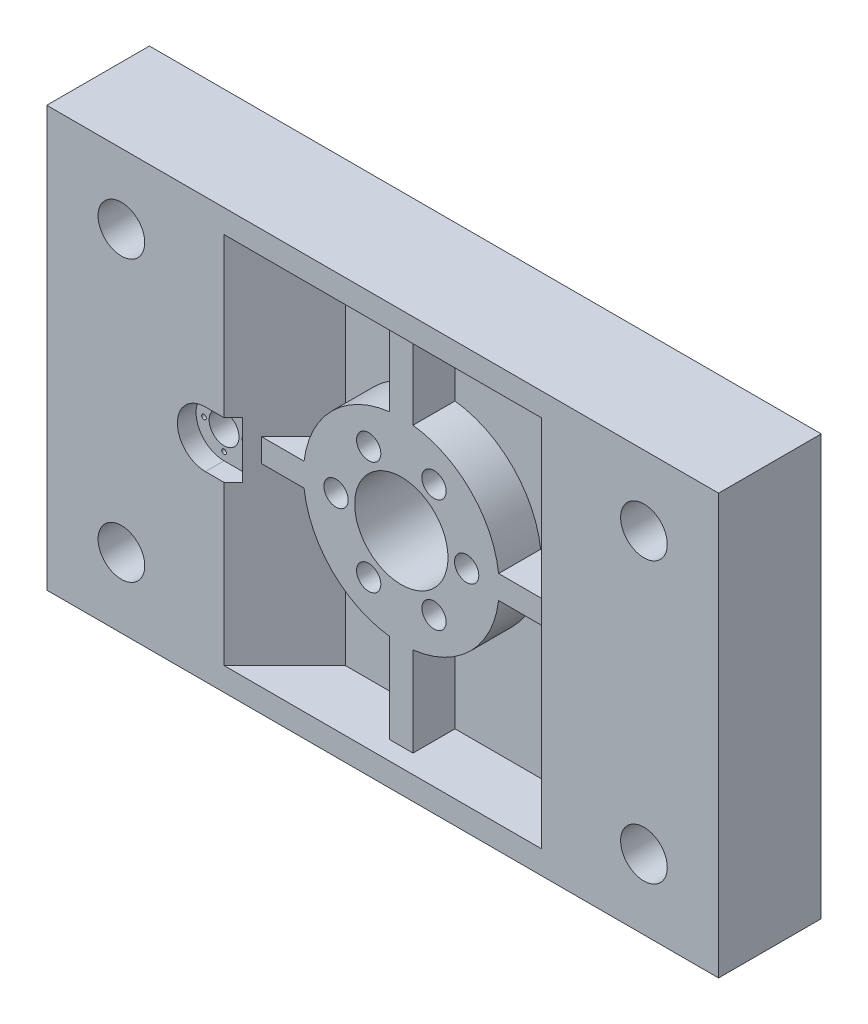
ISO-10303-21;
HEADER;
FILE_DESCRIPTION(('STEP AP214'),'2;1');
FILE_NAME('part.step','',(''),(''),'','','');
FILE_SCHEMA(('AUTOMOTIVE_DESIGN { 1 0 10303 214 1 1 1 1 }'));
ENDSEC;
DATA;
#1=APPLICATION_CONTEXT('core data for automotive mechanical design processes');
#2=APPLICATION_PROTOCOL_DEFINITION('international standard','automotive_design',2000,#1);
#3=PRODUCT_CONTEXT('',#1,'mechanical');
#4=PRODUCT('Part','Part','',(#3));
#5=PRODUCT_RELATED_PRODUCT_CATEGORY('part','',(#4));
#6=PRODUCT_DEFINITION_FORMATION('','',#4);
#7=PRODUCT_DEFINITION_CONTEXT('part definition',#1,'design');
#8=PRODUCT_DEFINITION('design','',#6,#7);
#9=PRODUCT_DEFINITION_SHAPE('','',#8);
#10=(LENGTH_UNIT() NAMED_UNIT(*) SI_UNIT(.MILLI.,.METRE.));
#11=(NAMED_UNIT(*) PLANE_ANGLE_UNIT() SI_UNIT($,.RADIAN.));
#12=(NAMED_UNIT(*) SI_UNIT($,.STERADIAN.) SOLID_ANGLE_UNIT());
#13=UNCERTAINTY_MEASURE_WITH_UNIT(LENGTH_MEASURE(1.E-05),#10,'distance_accuracy_value','');
#14=(GEOMETRIC_REPRESENTATION_CONTEXT(3) GLOBAL_UNCERTAINTY_ASSIGNED_CONTEXT((#13)) GLOBAL_UNIT_ASSIGNED_CONTEXT((#10,
#11,#12)) REPRESENTATION_CONTEXT('',''));
#15=CARTESIAN_POINT('',(0.,0.,0.));
#16=DIRECTION('',(0.,0.,1.));
#17=DIRECTION('',(1.,0.,0.));
#18=AXIS2_PLACEMENT_3D('',#15,#16,#17);
#19=CARTESIAN_POINT('',(0.,0.,90.));
#20=DIRECTION('',(0.,0.,-1.));
#21=DIRECTION('',(-1.,0.,0.));
#22=AXIS2_PLACEMENT_3D('',#19,#20,#21);
#23=CYLINDRICAL_SURFACE('',#22,105.);
#24=CARTESIAN_POINT('',(0.,0.,45.));
#25=DIRECTION('',(0.,0.,1.));
#26=DIRECTION('',(1.,0.,0.));
#27=AXIS2_PLACEMENT_3D('',#24,#25,#26);
#28=CIRCLE('',#27,105.);
#29=CARTESIAN_POINT('',(12.5,-104.253297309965,45.));
#30=VERTEX_POINT('',#29);
#31=CARTESIAN_POINT('',(104.253297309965,-12.5000000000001,45.0000000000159));
#32=VERTEX_POINT('',#31);
#33=EDGE_CURVE('E363',#30,#32,#28,.T.);
#34=ORIENTED_EDGE('',*,*,#33,.T.);
#35=DIRECTION('',(0.,0.,1.));
#36=VECTOR('',#35,1.);
#37=CARTESIAN_POINT('',(104.253297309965,-12.5000000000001,-500000.));
#38=LINE('',#37,#36);
#39=CARTESIAN_POINT('',(104.253297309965,-12.5000000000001,90.));
#40=VERTEX_POINT('',#39);
#41=EDGE_CURVE('E350',#32,#40,#38,.T.);
#42=ORIENTED_EDGE('',*,*,#41,.T.);
#43=CARTESIAN_POINT('',(0.,0.,90.));
#44=DIRECTION('',(0.,0.,1.));
#45=DIRECTION('',(1.,0.,0.));
#46=AXIS2_PLACEMENT_3D('',#43,#44,#45);
#47=CIRCLE('',#46,105.);
#48=CARTESIAN_POINT('',(12.5,-104.253297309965,90.));
#49=VERTEX_POINT('',#48);
#50=EDGE_CURVE('E361',#49,#40,#47,.T.);
#51=ORIENTED_EDGE('',*,*,#50,.F.);
#52=DIRECTION('',(0.,0.,-1.));
#53=VECTOR('',#52,1.);
#54=CARTESIAN_POINT('',(12.5,-104.253297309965,90.));
#55=LINE('',#54,#53);
#56=EDGE_CURVE('E421',#49,#30,#55,.T.);
#57=ORIENTED_EDGE('',*,*,#56,.T.);
#58=EDGE_LOOP('',(#34,#42,#51,#57));
#59=FACE_BOUND('',#58,.T.);
#60=ADVANCED_FACE('F36',(#59),#23,.T.);
#61=CARTESIAN_POINT('',(0.,0.,90.));
#62=DIRECTION('',(0.,0.,-1.));
#63=DIRECTION('',(-1.,0.,0.));
#64=AXIS2_PLACEMENT_3D('',#61,#62,#63);
#65=CYLINDRICAL_SURFACE('',#64,105.);
#66=CARTESIAN_POINT('',(0.,0.,45.));
#67=DIRECTION('',(0.,0.,1.));
#68=DIRECTION('',(1.,0.,0.));
#69=AXIS2_PLACEMENT_3D('',#66,#67,#68);
#70=CIRCLE('',#69,105.);
#71=CARTESIAN_POINT('',(-12.5,104.253297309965,45.));
#72=VERTEX_POINT('',#71);
#73=CARTESIAN_POINT('',(-104.253297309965,12.4999999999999,45.0000000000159));
#74=VERTEX_POINT('',#73);
#75=EDGE_CURVE('E399',#72,#74,#70,.T.);
#76=ORIENTED_EDGE('',*,*,#75,.T.);
#77=DIRECTION('',(0.,0.,1.));
#78=VECTOR('',#77,1.);
#79=CARTESIAN_POINT('',(-104.253297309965,12.4999999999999,-500000.));
#80=LINE('',#79,#78);
#81=CARTESIAN_POINT('',(-104.253297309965,12.4999999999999,90.));
#82=VERTEX_POINT('',#81);
#83=EDGE_CURVE('E823',#74,#82,#80,.T.);
#84=ORIENTED_EDGE('',*,*,#83,.T.);
#85=CARTESIAN_POINT('',(0.,0.,90.));
#86=DIRECTION('',(0.,0.,1.));
#87=DIRECTION('',(1.,0.,0.));
#88=AXIS2_PLACEMENT_3D('',#85,#86,#87);
#89=CIRCLE('',#88,105.);
#90=CARTESIAN_POINT('',(-12.5,104.253297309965,90.));
#91=VERTEX_POINT('',#90);
#92=EDGE_CURVE('E383',#91,#82,#89,.T.);
#93=ORIENTED_EDGE('',*,*,#92,.F.);
#94=DIRECTION('',(0.,0.,-1.));
#95=VECTOR('',#94,1.);
#96=CARTESIAN_POINT('',(-12.5,104.253297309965,90.));
#97=LINE('',#96,#95);
#98=EDGE_CURVE('E410',#91,#72,#97,.T.);
#99=ORIENTED_EDGE('',*,*,#98,.T.);
#100=EDGE_LOOP('',(#76,#84,#93,#99));
#101=FACE_BOUND('',#100,.T.);
#102=ADVANCED_FACE('F899',(#101),#65,.T.);
#103=CARTESIAN_POINT('',(-70.,0.,90.));
#104=DIRECTION('',(0.,0.,-1.));
#105=DIRECTION('',(-1.,0.,0.));
#106=AXIS2_PLACEMENT_3D('',#103,#104,#105);
#107=CYLINDRICAL_SURFACE('',#106,9.);
#108=CARTESIAN_POINT('',(-70.,0.,0.));
#109=DIRECTION('',(0.,0.,-1.));
#110=DIRECTION('',(-1.,0.,0.));
#111=AXIS2_PLACEMENT_3D('',#108,#109,#110);
#112=CIRCLE('',#111,9.);
#113=CARTESIAN_POINT('',(-79.,0.,0.));
#114=VERTEX_POINT('',#113);
#115=EDGE_CURVE('E777',#114,#114,#112,.T.);
#116=CARTESIAN_POINT('',(-70.,0.,70.));
#117=DIRECTION('',(0.,0.,1.));
#118=DIRECTION('',(1.,0.,0.));
#119=AXIS2_PLACEMENT_3D('',#116,#117,#118);
#120=CIRCLE('',#119,9.);
#121=CARTESIAN_POINT('',(-79.,0.,70.));
#122=VERTEX_POINT('',#121);
#123=EDGE_CURVE('E40',#122,#122,#120,.T.);
#124=CARTESIAN_POINT('',(-79.,0.,0.));
#125=CARTESIAN_POINT('',(-79.,0.,0.729166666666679));
#126=CARTESIAN_POINT('',(-79.,0.,1.45833333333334));
#127=CARTESIAN_POINT('',(-79.,0.,2.91666666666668));
#128=CARTESIAN_POINT('',(-79.,0.,3.64583333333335));
#129=CARTESIAN_POINT('',(-79.,0.,5.10416666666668));
#130=CARTESIAN_POINT('',(-79.,0.,5.83333333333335));
#131=CARTESIAN_POINT('',(-79.,0.,7.29166666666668));
#132=CARTESIAN_POINT('',(-79.,0.,8.02083333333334));
#133=CARTESIAN_POINT('',(-79.,0.,9.47916666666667));
#134=CARTESIAN_POINT('',(-79.,0.,10.2083333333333));
#135=CARTESIAN_POINT('',(-79.,0.,11.6666666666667));
#136=CARTESIAN_POINT('',(-79.,0.,12.3958333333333));
#137=CARTESIAN_POINT('',(-79.,0.,13.8541666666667));
#138=CARTESIAN_POINT('',(-79.,0.,14.5833333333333));
#139=CARTESIAN_POINT('',(-79.,0.,16.0416666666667));
#140=CARTESIAN_POINT('',(-79.,0.,16.7708333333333));
#141=CARTESIAN_POINT('',(-79.,0.,18.2291666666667));
#142=CARTESIAN_POINT('',(-79.,0.,18.9583333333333));
#143=CARTESIAN_POINT('',(-79.,0.,20.4166666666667));
#144=CARTESIAN_POINT('',(-79.,0.,21.1458333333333));
#145=CARTESIAN_POINT('',(-79.,0.,22.6041666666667));
#146=CARTESIAN_POINT('',(-79.,0.,23.3333333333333));
#147=CARTESIAN_POINT('',(-79.,0.,24.7916666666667));
#148=CARTESIAN_POINT('',(-79.,0.,25.5208333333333));
#149=CARTESIAN_POINT('',(-79.,0.,26.9791666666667));
#150=CARTESIAN_POINT('',(-79.,0.,27.7083333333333));
#151=CARTESIAN_POINT('',(-79.,0.,29.1666666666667));
#152=CARTESIAN_POINT('',(-79.,0.,29.8958333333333));
#153=CARTESIAN_POINT('',(-79.,0.,31.3541666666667));
#154=CARTESIAN_POINT('',(-79.,0.,32.0833333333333));
#155=CARTESIAN_POINT('',(-79.,0.,33.5416666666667));
#156=CARTESIAN_POINT('',(-79.,0.,34.2708333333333));
#157=CARTESIAN_POINT('',(-79.,0.,35.7291666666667));
#158=CARTESIAN_POINT('',(-79.,0.,36.4583333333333));
#159=CARTESIAN_POINT('',(-79.,0.,37.9166666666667));
#160=CARTESIAN_POINT('',(-79.,0.,38.6458333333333));
#161=CARTESIAN_POINT('',(-79.,0.,40.1041666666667));
#162=CARTESIAN_POINT('',(-79.,0.,40.8333333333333));
#163=CARTESIAN_POINT('',(-79.,0.,42.2916666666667));
#164=CARTESIAN_POINT('',(-79.,0.,43.0208333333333));
#165=CARTESIAN_POINT('',(-79.,0.,44.4791666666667));
#166=CARTESIAN_POINT('',(-79.,0.,45.2083333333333));
#167=CARTESIAN_POINT('',(-79.,0.,46.6666666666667));
#168=CARTESIAN_POINT('',(-79.,0.,47.3958333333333));
#169=CARTESIAN_POINT('',(-79.,0.,48.8541666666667));
#170=CARTESIAN_POINT('',(-79.,0.,49.5833333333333));
#171=CARTESIAN_POINT('',(-79.,0.,51.0416666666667));
#172=CARTESIAN_POINT('',(-79.,0.,51.7708333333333));
#173=CARTESIAN_POINT('',(-79.,0.,53.2291666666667));
#174=CARTESIAN_POINT('',(-79.,0.,53.9583333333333));
#175=CARTESIAN_POINT('',(-79.,0.,55.4166666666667));
#176=CARTESIAN_POINT('',(-79.,0.,56.1458333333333));
#177=CARTESIAN_POINT('',(-79.,0.,57.6041666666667));
#178=CARTESIAN_POINT('',(-79.,0.,58.3333333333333));
#179=CARTESIAN_POINT('',(-79.,0.,59.7916666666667));
#180=CARTESIAN_POINT('',(-79.,0.,60.5208333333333));
#181=CARTESIAN_POINT('',(-79.,0.,61.9791666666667));
#182=CARTESIAN_POINT('',(-79.,0.,62.7083333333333));
#183=CARTESIAN_POINT('',(-79.,0.,64.1666666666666));
#184=CARTESIAN_POINT('',(-79.,0.,64.8958333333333));
#185=CARTESIAN_POINT('',(-79.,0.,66.3541666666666));
#186=CARTESIAN_POINT('',(-79.,0.,67.0833333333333));
#187=CARTESIAN_POINT('',(-79.,0.,68.5416666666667));
#188=CARTESIAN_POINT('',(-79.,0.,69.2708333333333));
#189=CARTESIAN_POINT('',(-79.,0.,70.));
#190=B_SPLINE_CURVE_WITH_KNOTS('',3,(#124,#125,#126,#127,#128,#129,#130,#131,#132,#133,#134,
#135,#136,#137,#138,#139,#140,#141,#142,#143,#144,#145,#146,#147,#148,#149,#150,#151,#152,#153,
#154,#155,#156,#157,#158,#159,#160,#161,#162,#163,#164,#165,#166,#167,#168,#169,#170,#171,#172,
#173,#174,#175,#176,#177,#178,#179,#180,#181,#182,#183,#184,#185,#186,#187,#188,#189),
.UNSPECIFIED.,.F.,.F.,(4,2,2,2,2,2,2,2,2,2,2,2,2,2,2,2,2,2,2,2,2,2,2,2,2,2,2,2,2,2,2,2,4),(0.,
2.1875,4.375,6.5625,8.74999999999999,10.9375,13.125,15.3125,17.5,19.6875,21.875,24.0625,26.25,
28.4375,30.625,32.8125,35.,37.1875,39.375,41.5625,43.75,45.9375,48.125,50.3125,52.5,54.6875,
56.875,59.0625,61.25,63.4375,65.625,67.8125,70.),.UNSPECIFIED.);
#191=EDGE_CURVE('BSEAM905',#114,#122,#190,.T.);
#192=ORIENTED_EDGE('',*,*,#115,.T.);
#193=ORIENTED_EDGE('',*,*,#123,.T.);
#194=ORIENTED_EDGE('',*,*,#191,.T.);
#195=ORIENTED_EDGE('',*,*,#191,.F.);
#196=EDGE_LOOP('',(#192,#194,#193,#195));
#197=FACE_BOUND('',#196,.T.);
#198=ADVANCED_FACE('F905',(#197),#107,.F.);
#199=CARTESIAN_POINT('',(-34.9999999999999,60.6217782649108,90.));
#200=DIRECTION('',(0.,0.,-1.));
#201=DIRECTION('',(-1.,0.,0.));
#202=AXIS2_PLACEMENT_3D('',#199,#200,#201);
#203=CYLINDRICAL_SURFACE('',#202,9.);
#204=CARTESIAN_POINT('',(-34.9999999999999,60.6217782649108,0.));
#205=DIRECTION('',(0.,0.,-1.));
#206=DIRECTION('',(-1.,0.,0.));
#207=AXIS2_PLACEMENT_3D('',#204,#205,#206);
#208=CIRCLE('',#207,9.00000000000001);
#209=CARTESIAN_POINT('',(-43.9999999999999,60.6217782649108,0.));
#210=VERTEX_POINT('',#209);
#211=EDGE_CURVE('E747',#210,#210,#208,.T.);
#212=CARTESIAN_POINT('',(-34.9999999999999,60.6217782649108,70.));
#213=DIRECTION('',(0.,0.,1.));
#214=DIRECTION('',(1.,0.,0.));
#215=AXIS2_PLACEMENT_3D('',#212,#213,#214);
#216=CIRCLE('',#215,9.);
#217=CARTESIAN_POINT('',(-43.9999999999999,60.6217782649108,70.));
#218=VERTEX_POINT('',#217);
#219=EDGE_CURVE('E758',#218,#218,#216,.T.);
#220=CARTESIAN_POINT('',(-43.9999999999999,60.6217782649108,0.));
#221=CARTESIAN_POINT('',(-43.9999999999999,60.6217782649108,0.729166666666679));
#222=CARTESIAN_POINT('',(-43.9999999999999,60.6217782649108,1.45833333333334));
#223=CARTESIAN_POINT('',(-43.9999999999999,60.6217782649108,2.91666666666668));
#224=CARTESIAN_POINT('',(-43.9999999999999,60.6217782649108,3.64583333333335));
#225=CARTESIAN_POINT('',(-43.9999999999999,60.6217782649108,5.10416666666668));
#226=CARTESIAN_POINT('',(-43.9999999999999,60.6217782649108,5.83333333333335));
#227=CARTESIAN_POINT('',(-43.9999999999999,60.6217782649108,7.29166666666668));
#228=CARTESIAN_POINT('',(-43.9999999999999,60.6217782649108,8.02083333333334));
#229=CARTESIAN_POINT('',(-43.9999999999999,60.6217782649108,9.47916666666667));
#230=CARTESIAN_POINT('',(-43.9999999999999,60.6217782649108,10.2083333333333));
#231=CARTESIAN_POINT('',(-43.9999999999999,60.6217782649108,11.6666666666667));
#232=CARTESIAN_POINT('',(-43.9999999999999,60.6217782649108,12.3958333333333));
#233=CARTESIAN_POINT('',(-43.9999999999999,60.6217782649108,13.8541666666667));
#234=CARTESIAN_POINT('',(-43.9999999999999,60.6217782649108,14.5833333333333));
#235=CARTESIAN_POINT('',(-43.9999999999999,60.6217782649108,16.0416666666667));
#236=CARTESIAN_POINT('',(-43.9999999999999,60.6217782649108,16.7708333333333));
#237=CARTESIAN_POINT('',(-43.9999999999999,60.6217782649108,18.2291666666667));
#238=CARTESIAN_POINT('',(-43.9999999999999,60.6217782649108,18.9583333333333));
#239=CARTESIAN_POINT('',(-43.9999999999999,60.6217782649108,20.4166666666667));
#240=CARTESIAN_POINT('',(-43.9999999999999,60.6217782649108,21.1458333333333));
#241=CARTESIAN_POINT('',(-43.9999999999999,60.6217782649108,22.6041666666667));
#242=CARTESIAN_POINT('',(-43.9999999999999,60.6217782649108,23.3333333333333));
#243=CARTESIAN_POINT('',(-43.9999999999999,60.6217782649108,24.7916666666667));
#244=CARTESIAN_POINT('',(-43.9999999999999,60.6217782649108,25.5208333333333));
#245=CARTESIAN_POINT('',(-43.9999999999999,60.6217782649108,26.9791666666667));
#246=CARTESIAN_POINT('',(-43.9999999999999,60.6217782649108,27.7083333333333));
#247=CARTESIAN_POINT('',(-43.9999999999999,60.6217782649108,29.1666666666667));
#248=CARTESIAN_POINT('',(-43.9999999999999,60.6217782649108,29.8958333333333));
#249=CARTESIAN_POINT('',(-43.9999999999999,60.6217782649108,31.3541666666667));
#250=CARTESIAN_POINT('',(-43.9999999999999,60.6217782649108,32.0833333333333));
#251=CARTESIAN_POINT('',(-43.9999999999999,60.6217782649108,33.5416666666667));
#252=CARTESIAN_POINT('',(-43.9999999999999,60.6217782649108,34.2708333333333));
#253=CARTESIAN_POINT('',(-43.9999999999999,60.6217782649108,35.7291666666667));
#254=CARTESIAN_POINT('',(-43.9999999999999,60.6217782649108,36.4583333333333));
#255=CARTESIAN_POINT('',(-43.9999999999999,60.6217782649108,37.9166666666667));
#256=CARTESIAN_POINT('',(-43.9999999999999,60.6217782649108,38.6458333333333));
#257=CARTESIAN_POINT('',(-43.9999999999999,60.6217782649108,40.1041666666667));
#258=CARTESIAN_POINT('',(-43.9999999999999,60.6217782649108,40.8333333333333));
#259=CARTESIAN_POINT('',(-43.9999999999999,60.6217782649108,42.2916666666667));
#260=CARTESIAN_POINT('',(-43.9999999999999,60.6217782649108,43.0208333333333));
#261=CARTESIAN_POINT('',(-43.9999999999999,60.6217782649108,44.4791666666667));
#262=CARTESIAN_POINT('',(-43.9999999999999,60.6217782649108,45.2083333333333));
#263=CARTESIAN_POINT('',(-43.9999999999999,60.6217782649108,46.6666666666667));
#264=CARTESIAN_POINT('',(-43.9999999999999,60.6217782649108,47.3958333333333));
#265=CARTESIAN_POINT('',(-43.9999999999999,60.6217782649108,48.8541666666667));
#266=CARTESIAN_POINT('',(-43.9999999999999,60.6217782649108,49.5833333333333));
#267=CARTESIAN_POINT('',(-43.9999999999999,60.6217782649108,51.0416666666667));
#268=CARTESIAN_POINT('',(-43.9999999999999,60.6217782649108,51.7708333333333));
#269=CARTESIAN_POINT('',(-43.9999999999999,60.6217782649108,53.2291666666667));
#270=CARTESIAN_POINT('',(-43.9999999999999,60.6217782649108,53.9583333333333));
#271=CARTESIAN_POINT('',(-43.9999999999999,60.6217782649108,55.4166666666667));
#272=CARTESIAN_POINT('',(-43.9999999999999,60.6217782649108,56.1458333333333));
#273=CARTESIAN_POINT('',(-43.9999999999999,60.6217782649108,57.6041666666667));
#274=CARTESIAN_POINT('',(-43.9999999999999,60.6217782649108,58.3333333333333));
#275=CARTESIAN_POINT('',(-43.9999999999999,60.6217782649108,59.7916666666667));
#276=CARTESIAN_POINT('',(-43.9999999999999,60.6217782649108,60.5208333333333));
#277=CARTESIAN_POINT('',(-43.9999999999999,60.6217782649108,61.9791666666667));
#278=CARTESIAN_POINT('',(-43.9999999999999,60.6217782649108,62.7083333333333));
#279=CARTESIAN_POINT('',(-43.9999999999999,60.6217782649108,64.1666666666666));
#280=CARTESIAN_POINT('',(-43.9999999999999,60.6217782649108,64.8958333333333));
#281=CARTESIAN_POINT('',(-43.9999999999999,60.6217782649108,66.3541666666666));
#282=CARTESIAN_POINT('',(-43.9999999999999,60.6217782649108,67.0833333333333));
#283=CARTESIAN_POINT('',(-43.9999999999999,60.6217782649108,68.5416666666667));
#284=CARTESIAN_POINT('',(-43.9999999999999,60.6217782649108,69.2708333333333));
#285=CARTESIAN_POINT('',(-43.9999999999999,60.6217782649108,70.));
#286=B_SPLINE_CURVE_WITH_KNOTS('',3,(#220,#221,#222,#223,#224,#225,#226,#227,#228,#229,#230,
#231,#232,#233,#234,#235,#236,#237,#238,#239,#240,#241,#242,#243,#244,#245,#246,#247,#248,#249,
#250,#251,#252,#253,#254,#255,#256,#257,#258,#259,#260,#261,#262,#263,#264,#265,#266,#267,#268,
#269,#270,#271,#272,#273,#274,#275,#276,#277,#278,#279,#280,#281,#282,#283,#284,#285),
.UNSPECIFIED.,.F.,.F.,(4,2,2,2,2,2,2,2,2,2,2,2,2,2,2,2,2,2,2,2,2,2,2,2,2,2,2,2,2,2,2,2,4),(0.,
2.1875,4.375,6.5625,8.74999999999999,10.9375,13.125,15.3125,17.5,19.6875,21.875,24.0625,26.25,
28.4375,30.625,32.8125,35.,37.1875,39.375,41.5625,43.75,45.9375,48.125,50.3125,52.5,54.6875,
56.875,59.0625,61.25,63.4375,65.625,67.8125,70.),.UNSPECIFIED.);
#287=EDGE_CURVE('BSEAM1231',#210,#218,#286,.T.);
#288=ORIENTED_EDGE('',*,*,#211,.T.);
#289=ORIENTED_EDGE('',*,*,#219,.T.);
#290=ORIENTED_EDGE('',*,*,#287,.T.);
#291=ORIENTED_EDGE('',*,*,#287,.F.);
#292=EDGE_LOOP('',(#288,#290,#289,#291));
#293=FACE_BOUND('',#292,.T.);
#294=ADVANCED_FACE('F1231',(#293),#203,.F.);
#295=CARTESIAN_POINT('',(70.,-4.80234859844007E-13,90.));
#296=DIRECTION('',(0.,0.,-1.));
#297=DIRECTION('',(-1.,0.,0.));
#298=AXIS2_PLACEMENT_3D('',#295,#296,#297);
#299=CYLINDRICAL_SURFACE('',#298,9.00000000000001);
#300=CARTESIAN_POINT('',(70.,-4.80234859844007E-13,0.));
#301=DIRECTION('',(0.,0.,-1.));
#302=DIRECTION('',(-1.,0.,0.));
#303=AXIS2_PLACEMENT_3D('',#300,#301,#302);
#304=CIRCLE('',#303,9.00000000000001);
#305=CARTESIAN_POINT('',(61.,-4.80234859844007E-13,0.));
#306=VERTEX_POINT('',#305);
#307=EDGE_CURVE('E781',#306,#306,#304,.T.);
#308=CARTESIAN_POINT('',(70.,-4.80234859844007E-13,70.));
#309=DIRECTION('',(0.,0.,1.));
#310=DIRECTION('',(1.,0.,0.));
#311=AXIS2_PLACEMENT_3D('',#308,#309,#310);
#312=CIRCLE('',#311,9.00000000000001);
#313=CARTESIAN_POINT('',(61.,-4.80234859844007E-13,70.));
#314=VERTEX_POINT('',#313);
#315=EDGE_CURVE('E756',#314,#314,#312,.T.);
#316=CARTESIAN_POINT('',(61.,-4.80234859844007E-13,0.));
#317=CARTESIAN_POINT('',(61.,-4.80234859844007E-13,0.729166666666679));
#318=CARTESIAN_POINT('',(61.,-4.80234859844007E-13,1.45833333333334));
#319=CARTESIAN_POINT('',(61.,-4.80234859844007E-13,2.91666666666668));
#320=CARTESIAN_POINT('',(61.,-4.80234859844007E-13,3.64583333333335));
#321=CARTESIAN_POINT('',(61.,-4.80234859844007E-13,5.10416666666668));
#322=CARTESIAN_POINT('',(61.,-4.80234859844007E-13,5.83333333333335));
#323=CARTESIAN_POINT('',(61.,-4.80234859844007E-13,7.29166666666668));
#324=CARTESIAN_POINT('',(61.,-4.80234859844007E-13,8.02083333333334));
#325=CARTESIAN_POINT('',(61.,-4.80234859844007E-13,9.47916666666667));
#326=CARTESIAN_POINT('',(61.,-4.80234859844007E-13,10.2083333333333));
#327=CARTESIAN_POINT('',(61.,-4.80234859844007E-13,11.6666666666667));
#328=CARTESIAN_POINT('',(61.,-4.80234859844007E-13,12.3958333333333));
#329=CARTESIAN_POINT('',(61.,-4.80234859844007E-13,13.8541666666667));
#330=CARTESIAN_POINT('',(61.,-4.80234859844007E-13,14.5833333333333));
#331=CARTESIAN_POINT('',(61.,-4.80234859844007E-13,16.0416666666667));
#332=CARTESIAN_POINT('',(61.,-4.80234859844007E-13,16.7708333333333));
#333=CARTESIAN_POINT('',(61.,-4.80234859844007E-13,18.2291666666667));
#334=CARTESIAN_POINT('',(61.,-4.80234859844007E-13,18.9583333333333));
#335=CARTESIAN_POINT('',(61.,-4.80234859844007E-13,20.4166666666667));
#336=CARTESIAN_POINT('',(61.,-4.80234859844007E-13,21.1458333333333));
#337=CARTESIAN_POINT('',(61.,-4.80234859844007E-13,22.6041666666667));
#338=CARTESIAN_POINT('',(61.,-4.80234859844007E-13,23.3333333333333));
#339=CARTESIAN_POINT('',(61.,-4.80234859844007E-13,24.7916666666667));
#340=CARTESIAN_POINT('',(61.,-4.80234859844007E-13,25.5208333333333));
#341=CARTESIAN_POINT('',(61.,-4.80234859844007E-13,26.9791666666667));
#342=CARTESIAN_POINT('',(61.,-4.80234859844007E-13,27.7083333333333));
#343=CARTESIAN_POINT('',(61.,-4.80234859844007E-13,29.1666666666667));
#344=CARTESIAN_POINT('',(61.,-4.80234859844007E-13,29.8958333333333));
#345=CARTESIAN_POINT('',(61.,-4.80234859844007E-13,31.3541666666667));
#346=CARTESIAN_POINT('',(61.,-4.80234859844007E-13,32.0833333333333));
#347=CARTESIAN_POINT('',(61.,-4.80234859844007E-13,33.5416666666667));
#348=CARTESIAN_POINT('',(61.,-4.80234859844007E-13,34.2708333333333));
#349=CARTESIAN_POINT('',(61.,-4.80234859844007E-13,35.7291666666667));
#350=CARTESIAN_POINT('',(61.,-4.80234859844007E-13,36.4583333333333));
#351=CARTESIAN_POINT('',(61.,-4.80234859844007E-13,37.9166666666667));
#352=CARTESIAN_POINT('',(61.,-4.80234859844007E-13,38.6458333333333));
#353=CARTESIAN_POINT('',(61.,-4.80234859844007E-13,40.1041666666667));
#354=CARTESIAN_POINT('',(61.,-4.80234859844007E-13,40.8333333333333));
#355=CARTESIAN_POINT('',(61.,-4.80234859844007E-13,42.2916666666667));
#356=CARTESIAN_POINT('',(61.,-4.80234859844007E-13,43.0208333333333));
#357=CARTESIAN_POINT('',(61.,-4.80234859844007E-13,44.4791666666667));
#358=CARTESIAN_POINT('',(61.,-4.80234859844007E-13,45.2083333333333));
#359=CARTESIAN_POINT('',(61.,-4.80234859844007E-13,46.6666666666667));
#360=CARTESIAN_POINT('',(61.,-4.80234859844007E-13,47.3958333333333));
#361=CARTESIAN_POINT('',(61.,-4.80234859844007E-13,48.8541666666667));
#362=CARTESIAN_POINT('',(61.,-4.80234859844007E-13,49.5833333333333));
#363=CARTESIAN_POINT('',(61.,-4.80234859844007E-13,51.0416666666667));
#364=CARTESIAN_POINT('',(61.,-4.80234859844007E-13,51.7708333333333));
#365=CARTESIAN_POINT('',(61.,-4.80234859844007E-13,53.2291666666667));
#366=CARTESIAN_POINT('',(61.,-4.80234859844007E-13,53.9583333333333));
#367=CARTESIAN_POINT('',(61.,-4.80234859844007E-13,55.4166666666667));
#368=CARTESIAN_POINT('',(61.,-4.80234859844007E-13,56.1458333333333));
#369=CARTESIAN_POINT('',(61.,-4.80234859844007E-13,57.6041666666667));
#370=CARTESIAN_POINT('',(61.,-4.80234859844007E-13,58.3333333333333));
#371=CARTESIAN_POINT('',(61.,-4.80234859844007E-13,59.7916666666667));
#372=CARTESIAN_POINT('',(61.,-4.80234859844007E-13,60.5208333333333));
#373=CARTESIAN_POINT('',(61.,-4.80234859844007E-13,61.9791666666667));
#374=CARTESIAN_POINT('',(61.,-4.80234859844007E-13,62.7083333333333));
#375=CARTESIAN_POINT('',(61.,-4.80234859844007E-13,64.1666666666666));
#376=CARTESIAN_POINT('',(61.,-4.80234859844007E-13,64.8958333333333));
#377=CARTESIAN_POINT('',(61.,-4.80234859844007E-13,66.3541666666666));
#378=CARTESIAN_POINT('',(61.,-4.80234859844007E-13,67.0833333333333));
#379=CARTESIAN_POINT('',(61.,-4.80234859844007E-13,68.5416666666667));
#380=CARTESIAN_POINT('',(61.,-4.80234859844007E-13,69.2708333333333));
#381=CARTESIAN_POINT('',(61.,-4.80234859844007E-13,70.));
#382=B_SPLINE_CURVE_WITH_KNOTS('',3,(#316,#317,#318,#319,#320,#321,#322,#323,#324,#325,#326,
#327,#328,#329,#330,#331,#332,#333,#334,#335,#336,#337,#338,#339,#340,#341,#342,#343,#344,#345,
#346,#347,#348,#349,#350,#351,#352,#353,#354,#355,#356,#357,#358,#359,#360,#361,#362,#363,#364,
#365,#366,#367,#368,#369,#370,#371,#372,#373,#374,#375,#376,#377,#378,#379,#380,#381),
.UNSPECIFIED.,.F.,.F.,(4,2,2,2,2,2,2,2,2,2,2,2,2,2,2,2,2,2,2,2,2,2,2,2,2,2,2,2,2,2,2,2,4),(0.,
2.1875,4.375,6.5625,8.74999999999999,10.9375,13.125,15.3125,17.5,19.6875,21.875,24.0625,26.25,
28.4375,30.625,32.8125,35.,37.1875,39.375,41.5625,43.75,45.9375,48.125,50.3125,52.5,54.6875,
56.875,59.0625,61.25,63.4375,65.625,67.8125,70.),.UNSPECIFIED.);
#383=EDGE_CURVE('BSEAM1247',#306,#314,#382,.T.);
#384=ORIENTED_EDGE('',*,*,#307,.T.);
#385=ORIENTED_EDGE('',*,*,#315,.T.);
#386=ORIENTED_EDGE('',*,*,#383,.T.);
#387=ORIENTED_EDGE('',*,*,#383,.F.);
#388=EDGE_LOOP('',(#384,#386,#385,#387));
#389=FACE_BOUND('',#388,.T.);
#390=ADVANCED_FACE('F1247',(#389),#299,.F.);
#391=CARTESIAN_POINT('',(34.9999999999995,-60.621778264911,90.));
#392=DIRECTION('',(0.,0.,-1.));
#393=DIRECTION('',(-1.,0.,0.));
#394=AXIS2_PLACEMENT_3D('',#391,#392,#393);
#395=CYLINDRICAL_SURFACE('',#394,9.);
#396=CARTESIAN_POINT('',(34.9999999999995,-60.621778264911,0.));
#397=DIRECTION('',(0.,0.,-1.));
#398=DIRECTION('',(-1.,0.,0.));
#399=AXIS2_PLACEMENT_3D('',#396,#397,#398);
#400=CIRCLE('',#399,9.);
#401=CARTESIAN_POINT('',(25.9999999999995,-60.621778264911,0.));
#402=VERTEX_POINT('',#401);
#403=EDGE_CURVE('E778',#402,#402,#400,.T.);
#404=CARTESIAN_POINT('',(34.9999999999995,-60.621778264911,70.));
#405=DIRECTION('',(0.,0.,1.));
#406=DIRECTION('',(1.,0.,0.));
#407=AXIS2_PLACEMENT_3D('',#404,#405,#406);
#408=CIRCLE('',#407,9.);
#409=CARTESIAN_POINT('',(25.9999999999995,-60.621778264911,70.));
#410=VERTEX_POINT('',#409);
#411=EDGE_CURVE('E752',#410,#410,#408,.T.);
#412=CARTESIAN_POINT('',(25.9999999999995,-60.621778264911,0.));
#413=CARTESIAN_POINT('',(25.9999999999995,-60.621778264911,0.729166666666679));
#414=CARTESIAN_POINT('',(25.9999999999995,-60.621778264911,1.45833333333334));
#415=CARTESIAN_POINT('',(25.9999999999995,-60.621778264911,2.91666666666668));
#416=CARTESIAN_POINT('',(25.9999999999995,-60.621778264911,3.64583333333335));
#417=CARTESIAN_POINT('',(25.9999999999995,-60.621778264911,5.10416666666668));
#418=CARTESIAN_POINT('',(25.9999999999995,-60.621778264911,5.83333333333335));
#419=CARTESIAN_POINT('',(25.9999999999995,-60.621778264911,7.29166666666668));
#420=CARTESIAN_POINT('',(25.9999999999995,-60.621778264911,8.02083333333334));
#421=CARTESIAN_POINT('',(25.9999999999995,-60.621778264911,9.47916666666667));
#422=CARTESIAN_POINT('',(25.9999999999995,-60.621778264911,10.2083333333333));
#423=CARTESIAN_POINT('',(25.9999999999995,-60.621778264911,11.6666666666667));
#424=CARTESIAN_POINT('',(25.9999999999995,-60.621778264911,12.3958333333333));
#425=CARTESIAN_POINT('',(25.9999999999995,-60.621778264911,13.8541666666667));
#426=CARTESIAN_POINT('',(25.9999999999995,-60.621778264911,14.5833333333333));
#427=CARTESIAN_POINT('',(25.9999999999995,-60.621778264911,16.0416666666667));
#428=CARTESIAN_POINT('',(25.9999999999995,-60.621778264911,16.7708333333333));
#429=CARTESIAN_POINT('',(25.9999999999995,-60.621778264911,18.2291666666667));
#430=CARTESIAN_POINT('',(25.9999999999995,-60.621778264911,18.9583333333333));
#431=CARTESIAN_POINT('',(25.9999999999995,-60.621778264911,20.4166666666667));
#432=CARTESIAN_POINT('',(25.9999999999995,-60.621778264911,21.1458333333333));
#433=CARTESIAN_POINT('',(25.9999999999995,-60.621778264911,22.6041666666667));
#434=CARTESIAN_POINT('',(25.9999999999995,-60.621778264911,23.3333333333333));
#435=CARTESIAN_POINT('',(25.9999999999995,-60.621778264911,24.7916666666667));
#436=CARTESIAN_POINT('',(25.9999999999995,-60.621778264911,25.5208333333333));
#437=CARTESIAN_POINT('',(25.9999999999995,-60.621778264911,26.9791666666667));
#438=CARTESIAN_POINT('',(25.9999999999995,-60.621778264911,27.7083333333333));
#439=CARTESIAN_POINT('',(25.9999999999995,-60.621778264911,29.1666666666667));
#440=CARTESIAN_POINT('',(25.9999999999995,-60.621778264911,29.8958333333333));
#441=CARTESIAN_POINT('',(25.9999999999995,-60.621778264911,31.3541666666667));
#442=CARTESIAN_POINT('',(25.9999999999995,-60.621778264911,32.0833333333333));
#443=CARTESIAN_POINT('',(25.9999999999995,-60.621778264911,33.5416666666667));
#444=CARTESIAN_POINT('',(25.9999999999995,-60.621778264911,34.2708333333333));
#445=CARTESIAN_POINT('',(25.9999999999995,-60.621778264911,35.7291666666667));
#446=CARTESIAN_POINT('',(25.9999999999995,-60.621778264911,36.4583333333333));
#447=CARTESIAN_POINT('',(25.9999999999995,-60.621778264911,37.9166666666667));
#448=CARTESIAN_POINT('',(25.9999999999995,-60.621778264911,38.6458333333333));
#449=CARTESIAN_POINT('',(25.9999999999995,-60.621778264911,40.1041666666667));
#450=CARTESIAN_POINT('',(25.9999999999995,-60.621778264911,40.8333333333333));
#451=CARTESIAN_POINT('',(25.9999999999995,-60.621778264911,42.2916666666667));
#452=CARTESIAN_POINT('',(25.9999999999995,-60.621778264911,43.0208333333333));
#453=CARTESIAN_POINT('',(25.9999999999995,-60.621778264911,44.4791666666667));
#454=CARTESIAN_POINT('',(25.9999999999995,-60.621778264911,45.2083333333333));
#455=CARTESIAN_POINT('',(25.9999999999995,-60.621778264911,46.6666666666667));
#456=CARTESIAN_POINT('',(25.9999999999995,-60.621778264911,47.3958333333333));
#457=CARTESIAN_POINT('',(25.9999999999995,-60.621778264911,48.8541666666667));
#458=CARTESIAN_POINT('',(25.9999999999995,-60.621778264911,49.5833333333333));
#459=CARTESIAN_POINT('',(25.9999999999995,-60.621778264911,51.0416666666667));
#460=CARTESIAN_POINT('',(25.9999999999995,-60.621778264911,51.7708333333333));
#461=CARTESIAN_POINT('',(25.9999999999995,-60.621778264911,53.2291666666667));
#462=CARTESIAN_POINT('',(25.9999999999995,-60.621778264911,53.9583333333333));
#463=CARTESIAN_POINT('',(25.9999999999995,-60.621778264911,55.4166666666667));
#464=CARTESIAN_POINT('',(25.9999999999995,-60.621778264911,56.1458333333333));
#465=CARTESIAN_POINT('',(25.9999999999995,-60.621778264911,57.6041666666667));
#466=CARTESIAN_POINT('',(25.9999999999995,-60.621778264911,58.3333333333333));
#467=CARTESIAN_POINT('',(25.9999999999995,-60.621778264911,59.7916666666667));
#468=CARTESIAN_POINT('',(25.9999999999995,-60.621778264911,60.5208333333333));
#469=CARTESIAN_POINT('',(25.9999999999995,-60.621778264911,61.9791666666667));
#470=CARTESIAN_POINT('',(25.9999999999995,-60.621778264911,62.7083333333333));
#471=CARTESIAN_POINT('',(25.9999999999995,-60.621778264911,64.1666666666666));
#472=CARTESIAN_POINT('',(25.9999999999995,-60.621778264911,64.8958333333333));
#473=CARTESIAN_POINT('',(25.9999999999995,-60.621778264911,66.3541666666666));
#474=CARTESIAN_POINT('',(25.9999999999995,-60.621778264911,67.0833333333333));
#475=CARTESIAN_POINT('',(25.9999999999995,-60.621778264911,68.5416666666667));
#476=CARTESIAN_POINT('',(25.9999999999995,-60.621778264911,69.2708333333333));
#477=CARTESIAN_POINT('',(25.9999999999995,-60.621778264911,70.));
#478=B_SPLINE_CURVE_WITH_KNOTS('',3,(#412,#413,#414,#415,#416,#417,#418,#419,#420,#421,#422,
#423,#424,#425,#426,#427,#428,#429,#430,#431,#432,#433,#434,#435,#436,#437,#438,#439,#440,#441,
#442,#443,#444,#445,#446,#447,#448,#449,#450,#451,#452,#453,#454,#455,#456,#457,#458,#459,#460,
#461,#462,#463,#464,#465,#466,#467,#468,#469,#470,#471,#472,#473,#474,#475,#476,#477),
.UNSPECIFIED.,.F.,.F.,(4,2,2,2,2,2,2,2,2,2,2,2,2,2,2,2,2,2,2,2,2,2,2,2,2,2,2,2,2,2,2,2,4),(0.,
2.1875,4.375,6.5625,8.74999999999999,10.9375,13.125,15.3125,17.5,19.6875,21.875,24.0625,26.25,
28.4375,30.625,32.8125,35.,37.1875,39.375,41.5625,43.75,45.9375,48.125,50.3125,52.5,54.6875,
56.875,59.0625,61.25,63.4375,65.625,67.8125,70.),.UNSPECIFIED.);
#479=EDGE_CURVE('BSEAM1258',#402,#410,#478,.T.);
#480=ORIENTED_EDGE('',*,*,#403,.T.);
#481=ORIENTED_EDGE('',*,*,#411,.T.);
#482=ORIENTED_EDGE('',*,*,#479,.T.);
#483=ORIENTED_EDGE('',*,*,#479,.F.);
#484=EDGE_LOOP('',(#480,#482,#481,#483));
#485=FACE_BOUND('',#484,.T.);
#486=ADVANCED_FACE('F1258',(#485),#395,.F.);
#487=CARTESIAN_POINT('',(-35.0000000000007,-60.6217782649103,90.));
#488=DIRECTION('',(0.,0.,-1.));
#489=DIRECTION('',(-1.,0.,0.));
#490=AXIS2_PLACEMENT_3D('',#487,#488,#489);
#491=CYLINDRICAL_SURFACE('',#490,9.00000000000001);
#492=CARTESIAN_POINT('',(-35.0000000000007,-60.6217782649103,0.));
#493=DIRECTION('',(0.,0.,-1.));
#494=DIRECTION('',(-1.,0.,0.));
#495=AXIS2_PLACEMENT_3D('',#492,#493,#494);
#496=CIRCLE('',#495,9.00000000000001);
#497=CARTESIAN_POINT('',(-44.0000000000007,-60.6217782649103,0.));
#498=VERTEX_POINT('',#497);
#499=EDGE_CURVE('E774',#498,#498,#496,.T.);
#500=CARTESIAN_POINT('',(-35.0000000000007,-60.6217782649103,70.));
#501=DIRECTION('',(0.,0.,1.));
#502=DIRECTION('',(1.,0.,0.));
#503=AXIS2_PLACEMENT_3D('',#500,#501,#502);
#504=CIRCLE('',#503,9.00000000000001);
#505=CARTESIAN_POINT('',(-44.0000000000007,-60.6217782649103,70.));
#506=VERTEX_POINT('',#505);
#507=EDGE_CURVE('E749',#506,#506,#504,.T.);
#508=CARTESIAN_POINT('',(-44.0000000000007,-60.6217782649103,0.));
#509=CARTESIAN_POINT('',(-44.0000000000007,-60.6217782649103,0.729166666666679));
#510=CARTESIAN_POINT('',(-44.0000000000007,-60.6217782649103,1.45833333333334));
#511=CARTESIAN_POINT('',(-44.0000000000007,-60.6217782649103,2.91666666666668));
#512=CARTESIAN_POINT('',(-44.0000000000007,-60.6217782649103,3.64583333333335));
#513=CARTESIAN_POINT('',(-44.0000000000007,-60.6217782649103,5.10416666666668));
#514=CARTESIAN_POINT('',(-44.0000000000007,-60.6217782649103,5.83333333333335));
#515=CARTESIAN_POINT('',(-44.0000000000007,-60.6217782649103,7.29166666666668));
#516=CARTESIAN_POINT('',(-44.0000000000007,-60.6217782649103,8.02083333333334));
#517=CARTESIAN_POINT('',(-44.0000000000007,-60.6217782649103,9.47916666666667));
#518=CARTESIAN_POINT('',(-44.0000000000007,-60.6217782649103,10.2083333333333));
#519=CARTESIAN_POINT('',(-44.0000000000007,-60.6217782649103,11.6666666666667));
#520=CARTESIAN_POINT('',(-44.0000000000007,-60.6217782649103,12.3958333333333));
#521=CARTESIAN_POINT('',(-44.0000000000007,-60.6217782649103,13.8541666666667));
#522=CARTESIAN_POINT('',(-44.0000000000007,-60.6217782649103,14.5833333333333));
#523=CARTESIAN_POINT('',(-44.0000000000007,-60.6217782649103,16.0416666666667));
#524=CARTESIAN_POINT('',(-44.0000000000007,-60.6217782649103,16.7708333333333));
#525=CARTESIAN_POINT('',(-44.0000000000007,-60.6217782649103,18.2291666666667));
#526=CARTESIAN_POINT('',(-44.0000000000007,-60.6217782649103,18.9583333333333));
#527=CARTESIAN_POINT('',(-44.0000000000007,-60.6217782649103,20.4166666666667));
#528=CARTESIAN_POINT('',(-44.0000000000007,-60.6217782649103,21.1458333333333));
#529=CARTESIAN_POINT('',(-44.0000000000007,-60.6217782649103,22.6041666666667));
#530=CARTESIAN_POINT('',(-44.0000000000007,-60.6217782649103,23.3333333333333));
#531=CARTESIAN_POINT('',(-44.0000000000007,-60.6217782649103,24.7916666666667));
#532=CARTESIAN_POINT('',(-44.0000000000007,-60.6217782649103,25.5208333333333));
#533=CARTESIAN_POINT('',(-44.0000000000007,-60.6217782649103,26.9791666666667));
#534=CARTESIAN_POINT('',(-44.0000000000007,-60.6217782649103,27.7083333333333));
#535=CARTESIAN_POINT('',(-44.0000000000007,-60.6217782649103,29.1666666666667));
#536=CARTESIAN_POINT('',(-44.0000000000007,-60.6217782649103,29.8958333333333));
#537=CARTESIAN_POINT('',(-44.0000000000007,-60.6217782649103,31.3541666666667));
#538=CARTESIAN_POINT('',(-44.0000000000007,-60.6217782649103,32.0833333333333));
#539=CARTESIAN_POINT('',(-44.0000000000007,-60.6217782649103,33.5416666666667));
#540=CARTESIAN_POINT('',(-44.0000000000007,-60.6217782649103,34.2708333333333));
#541=CARTESIAN_POINT('',(-44.0000000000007,-60.6217782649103,35.7291666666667));
#542=CARTESIAN_POINT('',(-44.0000000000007,-60.6217782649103,36.4583333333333));
#543=CARTESIAN_POINT('',(-44.0000000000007,-60.6217782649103,37.9166666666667));
#544=CARTESIAN_POINT('',(-44.0000000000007,-60.6217782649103,38.6458333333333));
#545=CARTESIAN_POINT('',(-44.0000000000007,-60.6217782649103,40.1041666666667));
#546=CARTESIAN_POINT('',(-44.0000000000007,-60.6217782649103,40.8333333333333));
#547=CARTESIAN_POINT('',(-44.0000000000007,-60.6217782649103,42.2916666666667));
#548=CARTESIAN_POINT('',(-44.0000000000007,-60.6217782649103,43.0208333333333));
#549=CARTESIAN_POINT('',(-44.0000000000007,-60.6217782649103,44.4791666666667));
#550=CARTESIAN_POINT('',(-44.0000000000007,-60.6217782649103,45.2083333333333));
#551=CARTESIAN_POINT('',(-44.0000000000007,-60.6217782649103,46.6666666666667));
#552=CARTESIAN_POINT('',(-44.0000000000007,-60.6217782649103,47.3958333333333));
#553=CARTESIAN_POINT('',(-44.0000000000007,-60.6217782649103,48.8541666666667));
#554=CARTESIAN_POINT('',(-44.0000000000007,-60.6217782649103,49.5833333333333));
#555=CARTESIAN_POINT('',(-44.0000000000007,-60.6217782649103,51.0416666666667));
#556=CARTESIAN_POINT('',(-44.0000000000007,-60.6217782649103,51.7708333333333));
#557=CARTESIAN_POINT('',(-44.0000000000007,-60.6217782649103,53.2291666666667));
#558=CARTESIAN_POINT('',(-44.0000000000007,-60.6217782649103,53.9583333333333));
#559=CARTESIAN_POINT('',(-44.0000000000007,-60.6217782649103,55.4166666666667));
#560=CARTESIAN_POINT('',(-44.0000000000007,-60.6217782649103,56.1458333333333));
#561=CARTESIAN_POINT('',(-44.0000000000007,-60.6217782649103,57.6041666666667));
#562=CARTESIAN_POINT('',(-44.0000000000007,-60.6217782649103,58.3333333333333));
#563=CARTESIAN_POINT('',(-44.0000000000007,-60.6217782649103,59.7916666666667));
#564=CARTESIAN_POINT('',(-44.0000000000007,-60.6217782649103,60.5208333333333));
#565=CARTESIAN_POINT('',(-44.0000000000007,-60.6217782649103,61.9791666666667));
#566=CARTESIAN_POINT('',(-44.0000000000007,-60.6217782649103,62.7083333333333));
#567=CARTESIAN_POINT('',(-44.0000000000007,-60.6217782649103,64.1666666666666));
#568=CARTESIAN_POINT('',(-44.0000000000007,-60.6217782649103,64.8958333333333));
#569=CARTESIAN_POINT('',(-44.0000000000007,-60.6217782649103,66.3541666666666));
#570=CARTESIAN_POINT('',(-44.0000000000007,-60.6217782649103,67.0833333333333));
#571=CARTESIAN_POINT('',(-44.0000000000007,-60.6217782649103,68.5416666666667));
#572=CARTESIAN_POINT('',(-44.0000000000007,-60.6217782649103,69.2708333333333));
#573=CARTESIAN_POINT('',(-44.0000000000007,-60.6217782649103,70.));
#574=B_SPLINE_CURVE_WITH_KNOTS('',3,(#508,#509,#510,#511,#512,#513,#514,#515,#516,#517,#518,
#519,#520,#521,#522,#523,#524,#525,#526,#527,#528,#529,#530,#531,#532,#533,#534,#535,#536,#537,
#538,#539,#540,#541,#542,#543,#544,#545,#546,#547,#548,#549,#550,#551,#552,#553,#554,#555,#556,
#557,#558,#559,#560,#561,#562,#563,#564,#565,#566,#567,#568,#569,#570,#571,#572,#573),
.UNSPECIFIED.,.F.,.F.,(4,2,2,2,2,2,2,2,2,2,2,2,2,2,2,2,2,2,2,2,2,2,2,2,2,2,2,2,2,2,2,2,4),(0.,
2.1875,4.375,6.5625,8.74999999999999,10.9375,13.125,15.3125,17.5,19.6875,21.875,24.0625,26.25,
28.4375,30.625,32.8125,35.,37.1875,39.375,41.5625,43.75,45.9375,48.125,50.3125,52.5,54.6875,
56.875,59.0625,61.25,63.4375,65.625,67.8125,70.),.UNSPECIFIED.);
#575=EDGE_CURVE('BSEAM1269',#498,#506,#574,.T.);
#576=ORIENTED_EDGE('',*,*,#499,.T.);
#577=ORIENTED_EDGE('',*,*,#507,.T.);
#578=ORIENTED_EDGE('',*,*,#575,.T.);
#579=ORIENTED_EDGE('',*,*,#575,.F.);
#580=EDGE_LOOP('',(#576,#578,#577,#579));
#581=FACE_BOUND('',#580,.T.);
#582=ADVANCED_FACE('F1269',(#581),#491,.F.);
#583=CARTESIAN_POINT('',(35.0000000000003,60.6217782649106,90.));
#584=DIRECTION('',(0.,0.,-1.));
#585=DIRECTION('',(-1.,0.,0.));
#586=AXIS2_PLACEMENT_3D('',#583,#584,#585);
#587=CYLINDRICAL_SURFACE('',#586,9.00000000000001);
#588=CARTESIAN_POINT('',(35.0000000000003,60.6217782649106,0.));
#589=DIRECTION('',(0.,0.,-1.));
#590=DIRECTION('',(-1.,0.,0.));
#591=AXIS2_PLACEMENT_3D('',#588,#589,#590);
#592=CIRCLE('',#591,9.00000000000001);
#593=CARTESIAN_POINT('',(26.0000000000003,60.6217782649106,0.));
#594=VERTEX_POINT('',#593);
#595=EDGE_CURVE('E784',#594,#594,#592,.T.);
#596=CARTESIAN_POINT('',(35.0000000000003,60.6217782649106,70.));
#597=DIRECTION('',(0.,0.,1.));
#598=DIRECTION('',(1.,0.,0.));
#599=AXIS2_PLACEMENT_3D('',#596,#597,#598);
#600=CIRCLE('',#599,9.00000000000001);
#601=CARTESIAN_POINT('',(26.0000000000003,60.6217782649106,70.));
#602=VERTEX_POINT('',#601);
#603=EDGE_CURVE('E744',#602,#602,#600,.T.);
#604=CARTESIAN_POINT('',(26.0000000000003,60.6217782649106,0.));
#605=CARTESIAN_POINT('',(26.0000000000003,60.6217782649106,0.729166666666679));
#606=CARTESIAN_POINT('',(26.0000000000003,60.6217782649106,1.45833333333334));
#607=CARTESIAN_POINT('',(26.0000000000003,60.6217782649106,2.91666666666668));
#608=CARTESIAN_POINT('',(26.0000000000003,60.6217782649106,3.64583333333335));
#609=CARTESIAN_POINT('',(26.0000000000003,60.6217782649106,5.10416666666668));
#610=CARTESIAN_POINT('',(26.0000000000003,60.6217782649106,5.83333333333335));
#611=CARTESIAN_POINT('',(26.0000000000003,60.6217782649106,7.29166666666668));
#612=CARTESIAN_POINT('',(26.0000000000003,60.6217782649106,8.02083333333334));
#613=CARTESIAN_POINT('',(26.0000000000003,60.6217782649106,9.47916666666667));
#614=CARTESIAN_POINT('',(26.0000000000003,60.6217782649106,10.2083333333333));
#615=CARTESIAN_POINT('',(26.0000000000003,60.6217782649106,11.6666666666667));
#616=CARTESIAN_POINT('',(26.0000000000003,60.6217782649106,12.3958333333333));
#617=CARTESIAN_POINT('',(26.0000000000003,60.6217782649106,13.8541666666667));
#618=CARTESIAN_POINT('',(26.0000000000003,60.6217782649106,14.5833333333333));
#619=CARTESIAN_POINT('',(26.0000000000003,60.6217782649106,16.0416666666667));
#620=CARTESIAN_POINT('',(26.0000000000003,60.6217782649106,16.7708333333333));
#621=CARTESIAN_POINT('',(26.0000000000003,60.6217782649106,18.2291666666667));
#622=CARTESIAN_POINT('',(26.0000000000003,60.6217782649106,18.9583333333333));
#623=CARTESIAN_POINT('',(26.0000000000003,60.6217782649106,20.4166666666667));
#624=CARTESIAN_POINT('',(26.0000000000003,60.6217782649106,21.1458333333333));
#625=CARTESIAN_POINT('',(26.0000000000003,60.6217782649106,22.6041666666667));
#626=CARTESIAN_POINT('',(26.0000000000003,60.6217782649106,23.3333333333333));
#627=CARTESIAN_POINT('',(26.0000000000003,60.6217782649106,24.7916666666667));
#628=CARTESIAN_POINT('',(26.0000000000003,60.6217782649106,25.5208333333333));
#629=CARTESIAN_POINT('',(26.0000000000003,60.6217782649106,26.9791666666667));
#630=CARTESIAN_POINT('',(26.0000000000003,60.6217782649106,27.7083333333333));
#631=CARTESIAN_POINT('',(26.0000000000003,60.6217782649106,29.1666666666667));
#632=CARTESIAN_POINT('',(26.0000000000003,60.6217782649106,29.8958333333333));
#633=CARTESIAN_POINT('',(26.0000000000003,60.6217782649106,31.3541666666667));
#634=CARTESIAN_POINT('',(26.0000000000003,60.6217782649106,32.0833333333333));
#635=CARTESIAN_POINT('',(26.0000000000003,60.6217782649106,33.5416666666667));
#636=CARTESIAN_POINT('',(26.0000000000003,60.6217782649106,34.2708333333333));
#637=CARTESIAN_POINT('',(26.0000000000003,60.6217782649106,35.7291666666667));
#638=CARTESIAN_POINT('',(26.0000000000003,60.6217782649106,36.4583333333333));
#639=CARTESIAN_POINT('',(26.0000000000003,60.6217782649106,37.9166666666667));
#640=CARTESIAN_POINT('',(26.0000000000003,60.6217782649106,38.6458333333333));
#641=CARTESIAN_POINT('',(26.0000000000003,60.6217782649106,40.1041666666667));
#642=CARTESIAN_POINT('',(26.0000000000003,60.6217782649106,40.8333333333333));
#643=CARTESIAN_POINT('',(26.0000000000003,60.6217782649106,42.2916666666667));
#644=CARTESIAN_POINT('',(26.0000000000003,60.6217782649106,43.0208333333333));
#645=CARTESIAN_POINT('',(26.0000000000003,60.6217782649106,44.4791666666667));
#646=CARTESIAN_POINT('',(26.0000000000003,60.6217782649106,45.2083333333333));
#647=CARTESIAN_POINT('',(26.0000000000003,60.6217782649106,46.6666666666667));
#648=CARTESIAN_POINT('',(26.0000000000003,60.6217782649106,47.3958333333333));
#649=CARTESIAN_POINT('',(26.0000000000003,60.6217782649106,48.8541666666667));
#650=CARTESIAN_POINT('',(26.0000000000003,60.6217782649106,49.5833333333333));
#651=CARTESIAN_POINT('',(26.0000000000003,60.6217782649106,51.0416666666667));
#652=CARTESIAN_POINT('',(26.0000000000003,60.6217782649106,51.7708333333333));
#653=CARTESIAN_POINT('',(26.0000000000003,60.6217782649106,53.2291666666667));
#654=CARTESIAN_POINT('',(26.0000000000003,60.6217782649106,53.9583333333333));
#655=CARTESIAN_POINT('',(26.0000000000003,60.6217782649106,55.4166666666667));
#656=CARTESIAN_POINT('',(26.0000000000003,60.6217782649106,56.1458333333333));
#657=CARTESIAN_POINT('',(26.0000000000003,60.6217782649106,57.6041666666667));
#658=CARTESIAN_POINT('',(26.0000000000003,60.6217782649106,58.3333333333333));
#659=CARTESIAN_POINT('',(26.0000000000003,60.6217782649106,59.7916666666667));
#660=CARTESIAN_POINT('',(26.0000000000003,60.6217782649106,60.5208333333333));
#661=CARTESIAN_POINT('',(26.0000000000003,60.6217782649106,61.9791666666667));
#662=CARTESIAN_POINT('',(26.0000000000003,60.6217782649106,62.7083333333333));
#663=CARTESIAN_POINT('',(26.0000000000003,60.6217782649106,64.1666666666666));
#664=CARTESIAN_POINT('',(26.0000000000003,60.6217782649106,64.8958333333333));
#665=CARTESIAN_POINT('',(26.0000000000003,60.6217782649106,66.3541666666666));
#666=CARTESIAN_POINT('',(26.0000000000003,60.6217782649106,67.0833333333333));
#667=CARTESIAN_POINT('',(26.0000000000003,60.6217782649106,68.5416666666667));
#668=CARTESIAN_POINT('',(26.0000000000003,60.6217782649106,69.2708333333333));
#669=CARTESIAN_POINT('',(26.0000000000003,60.6217782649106,70.));
#670=B_SPLINE_CURVE_WITH_KNOTS('',3,(#604,#605,#606,#607,#608,#609,#610,#611,#612,#613,#614,
#615,#616,#617,#618,#619,#620,#621,#622,#623,#624,#625,#626,#627,#628,#629,#630,#631,#632,#633,
#634,#635,#636,#637,#638,#639,#640,#641,#642,#643,#644,#645,#646,#647,#648,#649,#650,#651,#652,
#653,#654,#655,#656,#657,#658,#659,#660,#661,#662,#663,#664,#665,#666,#667,#668,#669),
.UNSPECIFIED.,.F.,.F.,(4,2,2,2,2,2,2,2,2,2,2,2,2,2,2,2,2,2,2,2,2,2,2,2,2,2,2,2,2,2,2,2,4),(0.,
2.1875,4.375,6.5625,8.74999999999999,10.9375,13.125,15.3125,17.5,19.6875,21.875,24.0625,26.25,
28.4375,30.625,32.8125,35.,37.1875,39.375,41.5625,43.75,45.9375,48.125,50.3125,52.5,54.6875,
56.875,59.0625,61.25,63.4375,65.625,67.8125,70.),.UNSPECIFIED.);
#671=EDGE_CURVE('BSEAM1279',#594,#602,#670,.T.);
#672=ORIENTED_EDGE('',*,*,#595,.T.);
#673=ORIENTED_EDGE('',*,*,#603,.T.);
#674=ORIENTED_EDGE('',*,*,#671,.T.);
#675=ORIENTED_EDGE('',*,*,#671,.F.);
#676=EDGE_LOOP('',(#672,#674,#673,#675));
#677=FACE_BOUND('',#676,.T.);
#678=ADVANCED_FACE('F1279',(#677),#587,.F.);
#679=CARTESIAN_POINT('',(-105.,-200.,45.));
#680=DIRECTION('',(0.,-1.,0.));
#681=DIRECTION('',(0.,0.,-1.));
#682=AXIS2_PLACEMENT_3D('',#679,#680,#681);
#683=PLANE('',#682);
#684=DIRECTION('',(0.,0.,-1.));
#685=VECTOR('',#684,1.);
#686=CARTESIAN_POINT('',(12.5,-200.,90.));
#687=LINE('',#686,#685);
#688=CARTESIAN_POINT('',(12.5,-200.,90.));
#689=VERTEX_POINT('',#688);
#690=CARTESIAN_POINT('',(12.5,-200.,45.));
#691=VERTEX_POINT('',#690);
#692=EDGE_CURVE('E423',#689,#691,#687,.T.);
#693=ORIENTED_EDGE('',*,*,#692,.F.);
#694=DIRECTION('',(1.,0.,0.));
#695=VECTOR('',#694,1.);
#696=CARTESIAN_POINT('',(-12.5,-200.,90.));
#697=LINE('',#696,#695);
#698=CARTESIAN_POINT('',(-12.5,-200.,90.));
#699=VERTEX_POINT('',#698);
#700=EDGE_CURVE('E404',#699,#689,#697,.T.);
#701=ORIENTED_EDGE('',*,*,#700,.F.);
#702=DIRECTION('',(0.,0.,-1.));
#703=VECTOR('',#702,1.);
#704=CARTESIAN_POINT('',(-12.5,-200.,90.));
#705=LINE('',#704,#703);
#706=CARTESIAN_POINT('',(-12.5,-200.,45.));
#707=VERTEX_POINT('',#706);
#708=EDGE_CURVE('E388',#699,#707,#705,.T.);
#709=ORIENTED_EDGE('',*,*,#708,.T.);
#710=DIRECTION('',(1.,0.,0.));
#711=VECTOR('',#710,1.);
#712=CARTESIAN_POINT('',(-105.,-200.,45.));
#713=LINE('',#712,#711);
#714=CARTESIAN_POINT('',(-105.,-200.,45.));
#715=VERTEX_POINT('',#714);
#716=EDGE_CURVE('E499',#715,#707,#713,.T.);
#717=ORIENTED_EDGE('',*,*,#716,.F.);
#718=DIRECTION('',(0.707106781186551,0.,-0.707106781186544));
#719=VECTOR('',#718,1.);
#720=CARTESIAN_POINT('',(-105.,-200.,45.));
#721=LINE('',#720,#719);
#722=CARTESIAN_POINT('',(-170.000000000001,-200.,110.));
#723=VERTEX_POINT('',#722);
#724=EDGE_CURVE('E479',#723,#715,#721,.T.);
#725=ORIENTED_EDGE('',*,*,#724,.F.);
#726=DIRECTION('',(1.,0.,0.));
#727=VECTOR('',#726,1.);
#728=CARTESIAN_POINT('',(-105.,-200.,110.));
#729=LINE('',#728,#727);
#730=CARTESIAN_POINT('',(170.,-200.,110.));
#731=VERTEX_POINT('',#730);
#732=EDGE_CURVE('E505',#723,#731,#729,.T.);
#733=ORIENTED_EDGE('',*,*,#732,.T.);
#734=DIRECTION('',(0.707106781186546,0.,0.707106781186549));
#735=VECTOR('',#734,1.);
#736=CARTESIAN_POINT('',(105.,-200.,45.));
#737=LINE('',#736,#735);
#738=CARTESIAN_POINT('',(105.,-200.,45.));
#739=VERTEX_POINT('',#738);
#740=EDGE_CURVE('E470',#739,#731,#737,.T.);
#741=ORIENTED_EDGE('',*,*,#740,.F.);
#742=EDGE_CURVE('E498',#691,#739,#713,.T.);
#743=ORIENTED_EDGE('',*,*,#742,.F.);
#744=EDGE_LOOP('',(#693,#701,#709,#717,#725,#733,#741,#743));
#745=FACE_BOUND('',#744,.T.);
#746=ADVANCED_FACE('F798',(#745),#683,.F.);
#747=CARTESIAN_POINT('',(-105.,200.,45.));
#748=DIRECTION('',(0.,1.,0.));
#749=DIRECTION('',(-1.,0.,0.));
#750=AXIS2_PLACEMENT_3D('',#747,#748,#749);
#751=PLANE('',#750);
#752=DIRECTION('',(0.,0.,-1.));
#753=VECTOR('',#752,1.);
#754=CARTESIAN_POINT('',(12.5,200.,90.));
#755=LINE('',#754,#753);
#756=CARTESIAN_POINT('',(12.5,200.,90.));
#757=VERTEX_POINT('',#756);
#758=CARTESIAN_POINT('',(12.5,200.,45.));
#759=VERTEX_POINT('',#758);
#760=EDGE_CURVE('E415',#757,#759,#755,.T.);
#761=ORIENTED_EDGE('',*,*,#760,.T.);
#762=DIRECTION('',(-1.,0.,0.));
#763=VECTOR('',#762,1.);
#764=CARTESIAN_POINT('',(-105.,200.,45.));
#765=LINE('',#764,#763);
#766=CARTESIAN_POINT('',(105.,200.,45.));
#767=VERTEX_POINT('',#766);
#768=EDGE_CURVE('E491',#767,#759,#765,.T.);
#769=ORIENTED_EDGE('',*,*,#768,.F.);
#770=DIRECTION('',(0.707106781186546,0.,0.707106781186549));
#771=VECTOR('',#770,1.);
#772=CARTESIAN_POINT('',(105.,200.,45.));
#773=LINE('',#772,#771);
#774=CARTESIAN_POINT('',(170.,200.,110.));
#775=VERTEX_POINT('',#774);
#776=EDGE_CURVE('E466',#767,#775,#773,.T.);
#777=ORIENTED_EDGE('',*,*,#776,.T.);
#778=DIRECTION('',(-1.,0.,0.));
#779=VECTOR('',#778,1.);
#780=CARTESIAN_POINT('',(-105.,200.,110.));
#781=LINE('',#780,#779);
#782=CARTESIAN_POINT('',(-170.000000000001,200.,110.));
#783=VERTEX_POINT('',#782);
#784=EDGE_CURVE('E483',#775,#783,#781,.T.);
#785=ORIENTED_EDGE('',*,*,#784,.T.);
#786=DIRECTION('',(0.707106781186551,0.,-0.707106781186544));
#787=VECTOR('',#786,1.);
#788=CARTESIAN_POINT('',(-105.,200.,45.));
#789=LINE('',#788,#787);
#790=CARTESIAN_POINT('',(-105.,200.,45.));
#791=VERTEX_POINT('',#790);
#792=EDGE_CURVE('E476',#783,#791,#789,.T.);
#793=ORIENTED_EDGE('',*,*,#792,.T.);
#794=CARTESIAN_POINT('',(-12.5,200.,45.));
#795=VERTEX_POINT('',#794);
#796=EDGE_CURVE('E489',#795,#791,#765,.T.);
#797=ORIENTED_EDGE('',*,*,#796,.F.);
#798=DIRECTION('',(0.,0.,-1.));
#799=VECTOR('',#798,1.);
#800=CARTESIAN_POINT('',(-12.5,200.,90.));
#801=LINE('',#800,#799);
#802=CARTESIAN_POINT('',(-12.5,200.,90.));
#803=VERTEX_POINT('',#802);
#804=EDGE_CURVE('E413',#803,#795,#801,.T.);
#805=ORIENTED_EDGE('',*,*,#804,.F.);
#806=DIRECTION('',(-1.,0.,0.));
#807=VECTOR('',#806,1.);
#808=CARTESIAN_POINT('',(12.5,200.,90.));
#809=LINE('',#808,#807);
#810=EDGE_CURVE('E374',#757,#803,#809,.T.);
#811=ORIENTED_EDGE('',*,*,#810,.F.);
#812=EDGE_LOOP('',(#761,#769,#777,#785,#793,#797,#805,#811));
#813=FACE_BOUND('',#812,.T.);
#814=ADVANCED_FACE('F932',(#813),#751,.F.);
#815=CARTESIAN_POINT('',(0.,0.,45.));
#816=DIRECTION('',(0.,0.,1.));
#817=DIRECTION('',(1.,0.,0.));
#818=AXIS2_PLACEMENT_3D('',#815,#816,#817);
#819=PLANE('',#818);
#820=DIRECTION('',(-1.,0.,0.));
#821=VECTOR('',#820,1.);
#822=CARTESIAN_POINT('',(170.,-12.5,45.0000000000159));
#823=LINE('',#822,#821);
#824=CARTESIAN_POINT('',(105.,-12.5,45.0000000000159));
#825=VERTEX_POINT('',#824);
#826=EDGE_CURVE('E806',#825,#32,#823,.T.);
#827=ORIENTED_EDGE('',*,*,#826,.T.);
#828=ORIENTED_EDGE('',*,*,#33,.F.);
#829=DIRECTION('',(0.,1.,0.));
#830=VECTOR('',#829,1.);
#831=CARTESIAN_POINT('',(12.5,-104.253297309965,45.));
#832=LINE('',#831,#830);
#833=EDGE_CURVE('E389',#691,#30,#832,.T.);
#834=ORIENTED_EDGE('',*,*,#833,.F.);
#835=ORIENTED_EDGE('',*,*,#742,.T.);
#836=DIRECTION('',(0.,1.,0.));
#837=VECTOR('',#836,1.);
#838=CARTESIAN_POINT('',(105.,200.,45.));
#839=LINE('',#838,#837);
#840=EDGE_CURVE('E486',#739,#825,#839,.T.);
#841=ORIENTED_EDGE('',*,*,#840,.T.);
#842=EDGE_LOOP('',(#827,#828,#834,#835,#841));
#843=FACE_BOUND('',#842,.T.);
#844=ADVANCED_FACE('F804',(#843),#819,.T.);
#845=DIRECTION('',(1.,0.,0.));
#846=VECTOR('',#845,1.);
#847=CARTESIAN_POINT('',(170.,12.5,45.0000000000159));
#848=LINE('',#847,#846);
#849=CARTESIAN_POINT('',(104.253297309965,12.5,45.0000000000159));
#850=VERTEX_POINT('',#849);
#851=CARTESIAN_POINT('',(104.99999999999,12.5,45.0000000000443));
#852=VERTEX_POINT('',#851);
#853=EDGE_CURVE('E817',#850,#852,#848,.T.);
#854=ORIENTED_EDGE('',*,*,#853,.T.);
#855=EDGE_CURVE('E490',#852,#767,#839,.T.);
#856=ORIENTED_EDGE('',*,*,#855,.T.);
#857=ORIENTED_EDGE('',*,*,#768,.T.);
#858=DIRECTION('',(0.,1.,0.));
#859=VECTOR('',#858,1.);
#860=CARTESIAN_POINT('',(12.5,200.,45.));
#861=LINE('',#860,#859);
#862=CARTESIAN_POINT('',(12.5,104.253297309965,45.));
#863=VERTEX_POINT('',#862);
#864=EDGE_CURVE('E394',#863,#759,#861,.T.);
#865=ORIENTED_EDGE('',*,*,#864,.F.);
#866=EDGE_CURVE('E391',#850,#863,#28,.T.);
#867=ORIENTED_EDGE('',*,*,#866,.F.);
#868=EDGE_LOOP('',(#854,#856,#857,#865,#867));
#869=FACE_BOUND('',#868,.T.);
#870=ADVANCED_FACE('F974',(#869),#819,.T.);
#871=DIRECTION('',(1.,0.,0.));
#872=VECTOR('',#871,1.);
#873=CARTESIAN_POINT('',(-104.253297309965,12.5,45.0000000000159));
#874=LINE('',#873,#872);
#875=CARTESIAN_POINT('',(-105.,12.5,45.0000000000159));
#876=VERTEX_POINT('',#875);
#877=EDGE_CURVE('E833',#876,#74,#874,.T.);
#878=ORIENTED_EDGE('',*,*,#877,.T.);
#879=ORIENTED_EDGE('',*,*,#75,.F.);
#880=DIRECTION('',(0.,-1.,0.));
#881=VECTOR('',#880,1.);
#882=CARTESIAN_POINT('',(-12.5,200.,45.));
#883=LINE('',#882,#881);
#884=EDGE_CURVE('E396',#795,#72,#883,.T.);
#885=ORIENTED_EDGE('',*,*,#884,.F.);
#886=ORIENTED_EDGE('',*,*,#796,.T.);
#887=DIRECTION('',(0.,-1.,0.));
#888=VECTOR('',#887,1.);
#889=CARTESIAN_POINT('',(-105.,200.,45.));
#890=LINE('',#889,#888);
#891=EDGE_CURVE('E495',#791,#876,#890,.T.);
#892=ORIENTED_EDGE('',*,*,#891,.T.);
#893=EDGE_LOOP('',(#878,#879,#885,#886,#892));
#894=FACE_BOUND('',#893,.T.);
#895=ADVANCED_FACE('F939',(#894),#819,.T.);
#896=CARTESIAN_POINT('',(-168.4998,0.,110.));
#897=DIRECTION('',(0.,0.,-1.));
#898=DIRECTION('',(-1.,0.,0.));
#899=AXIS2_PLACEMENT_3D('',#896,#897,#898);
#900=CYLINDRICAL_SURFACE('',#899,2.49999999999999);
#901=CARTESIAN_POINT('',(-168.4998,0.,0.));
#902=DIRECTION('',(0.,0.,1.));
#903=DIRECTION('',(-1.,0.,0.));
#904=AXIS2_PLACEMENT_3D('',#901,#902,#903);
#905=CIRCLE('',#904,2.49999999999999);
#906=CARTESIAN_POINT('',(-170.9998,0.,0.));
#907=VERTEX_POINT('',#906);
#908=EDGE_CURVE('E688',#907,#907,#905,.T.);
#909=ORIENTED_EDGE('',*,*,#908,.F.);
#910=EDGE_LOOP('',(#909));
#911=FACE_BOUND('',#910,.T.);
#912=CARTESIAN_POINT('',(-168.4998,0.,90.));
#913=DIRECTION('',(0.,0.,1.));
#914=DIRECTION('',(1.,0.,0.));
#915=AXIS2_PLACEMENT_3D('',#912,#913,#914);
#916=CIRCLE('',#915,2.49999999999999);
#917=CARTESIAN_POINT('',(-165.9998,0.,90.));
#918=VERTEX_POINT('',#917);
#919=EDGE_CURVE('E463',#918,#918,#916,.T.);
#920=ORIENTED_EDGE('',*,*,#919,.T.);
#921=EDGE_LOOP('',(#920));
#922=FACE_BOUND('',#921,.T.);
#923=ADVANCED_FACE('F1071',(#911,#922),#900,.F.);
#924=CARTESIAN_POINT('',(-190.,0.,110.));
#925=DIRECTION('',(0.,0.,-1.));
#926=DIRECTION('',(-1.,0.,0.));
#927=AXIS2_PLACEMENT_3D('',#924,#925,#926);
#928=CYLINDRICAL_SURFACE('',#927,16.);
#929=CARTESIAN_POINT('',(-190.,0.,0.));
#930=DIRECTION('',(0.,0.,1.));
#931=DIRECTION('',(1.,0.,0.));
#932=AXIS2_PLACEMENT_3D('',#929,#930,#931);
#933=CIRCLE('',#932,16.);
#934=CARTESIAN_POINT('',(-174.,0.,0.));
#935=VERTEX_POINT('',#934);
#936=EDGE_CURVE('E694',#935,#935,#933,.T.);
#937=ORIENTED_EDGE('',*,*,#936,.F.);
#938=EDGE_LOOP('',(#937));
#939=FACE_BOUND('',#938,.T.);
#940=CARTESIAN_POINT('',(-190.,0.,90.));
#941=DIRECTION('',(0.,0.,1.));
#942=DIRECTION('',(1.,0.,0.));
#943=AXIS2_PLACEMENT_3D('',#940,#941,#942);
#944=CIRCLE('',#943,16.);
#945=CARTESIAN_POINT('',(-174.,0.,90.));
#946=VERTEX_POINT('',#945);
#947=EDGE_CURVE('E460',#946,#946,#944,.T.);
#948=ORIENTED_EDGE('',*,*,#947,.T.);
#949=EDGE_LOOP('',(#948));
#950=FACE_BOUND('',#949,.T.);
#951=ADVANCED_FACE('F1603',(#939,#950),#928,.F.);
#952=CARTESIAN_POINT('',(-189.9999,21.5,110.));
#953=DIRECTION('',(0.,0.,-1.));
#954=DIRECTION('',(-1.,0.,0.));
#955=AXIS2_PLACEMENT_3D('',#952,#953,#954);
#956=CYLINDRICAL_SURFACE('',#955,2.5);
#957=CARTESIAN_POINT('',(-189.9999,21.5,0.));
#958=DIRECTION('',(0.,0.,-1.));
#959=DIRECTION('',(-1.,0.,0.));
#960=AXIS2_PLACEMENT_3D('',#957,#958,#959);
#961=CIRCLE('',#960,2.5);
#962=CARTESIAN_POINT('',(-192.4999,21.5,0.));
#963=VERTEX_POINT('',#962);
#964=EDGE_CURVE('E502',#963,#963,#961,.T.);
#965=ORIENTED_EDGE('',*,*,#964,.T.);
#966=EDGE_LOOP('',(#965));
#967=FACE_BOUND('',#966,.T.);
#968=CARTESIAN_POINT('',(-189.9999,21.5,90.));
#969=DIRECTION('',(0.,0.,1.));
#970=DIRECTION('',(1.,0.,0.));
#971=AXIS2_PLACEMENT_3D('',#968,#969,#970);
#972=CIRCLE('',#971,2.5);
#973=CARTESIAN_POINT('',(-187.4999,21.5,90.));
#974=VERTEX_POINT('',#973);
#975=EDGE_CURVE('E457',#974,#974,#972,.T.);
#976=ORIENTED_EDGE('',*,*,#975,.T.);
#977=EDGE_LOOP('',(#976));
#978=FACE_BOUND('',#977,.T.);
#979=ADVANCED_FACE('F1614',(#967,#978),#956,.F.);
#980=CARTESIAN_POINT('',(-189.9999,-21.5,110.));
#981=DIRECTION('',(0.,0.,-1.));
#982=DIRECTION('',(-1.,0.,0.));
#983=AXIS2_PLACEMENT_3D('',#980,#981,#982);
#984=CYLINDRICAL_SURFACE('',#983,2.5);
#985=CARTESIAN_POINT('',(-189.9999,-21.5,0.));
#986=DIRECTION('',(0.,0.,-1.));
#987=DIRECTION('',(-1.,0.,0.));
#988=AXIS2_PLACEMENT_3D('',#985,#986,#987);
#989=CIRCLE('',#988,2.5);
#990=CARTESIAN_POINT('',(-192.4999,-21.5,0.));
#991=VERTEX_POINT('',#990);
#992=EDGE_CURVE('E522',#991,#991,#989,.T.);
#993=ORIENTED_EDGE('',*,*,#992,.T.);
#994=EDGE_LOOP('',(#993));
#995=FACE_BOUND('',#994,.T.);
#996=CARTESIAN_POINT('',(-189.9999,-21.5,90.));
#997=DIRECTION('',(0.,0.,1.));
#998=DIRECTION('',(1.,0.,0.));
#999=AXIS2_PLACEMENT_3D('',#996,#997,#998);
#1000=CIRCLE('',#999,2.5);
#1001=CARTESIAN_POINT('',(-187.4999,-21.5,90.));
#1002=VERTEX_POINT('',#1001);
#1003=EDGE_CURVE('E454',#1002,#1002,#1000,.T.);
#1004=ORIENTED_EDGE('',*,*,#1003,.T.);
#1005=EDGE_LOOP('',(#1004));
#1006=FACE_BOUND('',#1005,.T.);
#1007=ADVANCED_FACE('F1625',(#995,#1006),#984,.F.);
#1008=CARTESIAN_POINT('',(-211.5,0.,110.));
#1009=DIRECTION('',(0.,0.,-1.));
#1010=DIRECTION('',(-1.,0.,0.));
#1011=AXIS2_PLACEMENT_3D('',#1008,#1009,#1010);
#1012=CYLINDRICAL_SURFACE('',#1011,2.5);
#1013=CARTESIAN_POINT('',(-211.5,0.,0.));
#1014=DIRECTION('',(0.,0.,1.));
#1015=DIRECTION('',(1.,0.,0.));
#1016=AXIS2_PLACEMENT_3D('',#1013,#1014,#1015);
#1017=CIRCLE('',#1016,2.5);
#1018=CARTESIAN_POINT('',(-209.,0.,0.));
#1019=VERTEX_POINT('',#1018);
#1020=EDGE_CURVE('E691',#1019,#1019,#1017,.T.);
#1021=ORIENTED_EDGE('',*,*,#1020,.F.);
#1022=EDGE_LOOP('',(#1021));
#1023=FACE_BOUND('',#1022,.T.);
#1024=CARTESIAN_POINT('',(-211.5,0.,90.));
#1025=DIRECTION('',(0.,0.,1.));
#1026=DIRECTION('',(1.,0.,0.));
#1027=AXIS2_PLACEMENT_3D('',#1024,#1025,#1026);
#1028=CIRCLE('',#1027,2.5);
#1029=CARTESIAN_POINT('',(-209.,0.,90.));
#1030=VERTEX_POINT('',#1029);
#1031=EDGE_CURVE('E446',#1030,#1030,#1028,.T.);
#1032=ORIENTED_EDGE('',*,*,#1031,.T.);
#1033=EDGE_LOOP('',(#1032));
#1034=FACE_BOUND('',#1033,.T.);
#1035=ADVANCED_FACE('F1637',(#1023,#1034),#1012,.F.);
#1036=CARTESIAN_POINT('',(0.,0.,110.));
#1037=DIRECTION('',(0.,0.,-1.));
#1038=DIRECTION('',(-1.,0.,0.));
#1039=AXIS2_PLACEMENT_3D('',#1036,#1037,#1038);
#1040=PLANE('',#1039);
#1041=DIRECTION('',(0.,-1.,0.));
#1042=VECTOR('',#1041,1.);
#1043=CARTESIAN_POINT('',(-360.,225.,110.));
#1044=LINE('',#1043,#1042);
#1045=CARTESIAN_POINT('',(-360.,225.,110.));
#1046=VERTEX_POINT('',#1045);
#1047=CARTESIAN_POINT('',(-360.,-225.,110.));
#1048=VERTEX_POINT('',#1047);
#1049=EDGE_CURVE('E701',#1046,#1048,#1044,.T.);
#1050=ORIENTED_EDGE('',*,*,#1049,.T.);
#1051=DIRECTION('',(1.,0.,0.));
#1052=VECTOR('',#1051,1.);
#1053=CARTESIAN_POINT('',(360.,-225.,110.));
#1054=LINE('',#1053,#1052);
#1055=CARTESIAN_POINT('',(360.,-225.,110.));
#1056=VERTEX_POINT('',#1055);
#1057=EDGE_CURVE('E704',#1048,#1056,#1054,.T.);
#1058=ORIENTED_EDGE('',*,*,#1057,.T.);
#1059=DIRECTION('',(0.,1.,0.));
#1060=VECTOR('',#1059,1.);
#1061=CARTESIAN_POINT('',(360.,225.,110.));
#1062=LINE('',#1061,#1060);
#1063=CARTESIAN_POINT('',(360.,225.,110.));
#1064=VERTEX_POINT('',#1063);
#1065=EDGE_CURVE('E707',#1056,#1064,#1062,.T.);
#1066=ORIENTED_EDGE('',*,*,#1065,.T.);
#1067=DIRECTION('',(-1.,0.,0.));
#1068=VECTOR('',#1067,1.);
#1069=CARTESIAN_POINT('',(360.,225.,110.));
#1070=LINE('',#1069,#1068);
#1071=EDGE_CURVE('E709',#1064,#1046,#1070,.T.);
#1072=ORIENTED_EDGE('',*,*,#1071,.T.);
#1073=EDGE_LOOP('',(#1050,#1058,#1066,#1072));
#1074=FACE_BOUND('',#1073,.T.);
#1075=CARTESIAN_POINT('',(280.,-150.,110.));
#1076=DIRECTION('',(0.,0.,1.));
#1077=DIRECTION('',(1.,0.,0.));
#1078=AXIS2_PLACEMENT_3D('',#1075,#1076,#1077);
#1079=CIRCLE('',#1078,25.);
#1080=CARTESIAN_POINT('',(305.,-150.,110.));
#1081=VERTEX_POINT('',#1080);
#1082=EDGE_CURVE('E685',#1081,#1081,#1079,.T.);
#1083=ORIENTED_EDGE('',*,*,#1082,.F.);
#1084=EDGE_LOOP('',(#1083));
#1085=FACE_BOUND('',#1084,.T.);
#1086=CARTESIAN_POINT('',(280.,150.,110.));
#1087=DIRECTION('',(0.,0.,1.));
#1088=DIRECTION('',(-1.,0.,0.));
#1089=AXIS2_PLACEMENT_3D('',#1086,#1087,#1088);
#1090=CIRCLE('',#1089,25.);
#1091=CARTESIAN_POINT('',(255.,150.,110.));
#1092=VERTEX_POINT('',#1091);
#1093=EDGE_CURVE('E682',#1092,#1092,#1090,.T.);
#1094=ORIENTED_EDGE('',*,*,#1093,.F.);
#1095=EDGE_LOOP('',(#1094));
#1096=FACE_BOUND('',#1095,.T.);
#1097=CARTESIAN_POINT('',(-280.,-150.,110.));
#1098=DIRECTION('',(0.,0.,1.));
#1099=DIRECTION('',(-1.,0.,0.));
#1100=AXIS2_PLACEMENT_3D('',#1097,#1098,#1099);
#1101=CIRCLE('',#1100,25.);
#1102=CARTESIAN_POINT('',(-305.,-150.,110.));
#1103=VERTEX_POINT('',#1102);
#1104=EDGE_CURVE('E679',#1103,#1103,#1101,.T.);
#1105=ORIENTED_EDGE('',*,*,#1104,.F.);
#1106=EDGE_LOOP('',(#1105));
#1107=FACE_BOUND('',#1106,.T.);
#1108=CARTESIAN_POINT('',(-280.,150.,110.));
#1109=DIRECTION('',(0.,0.,1.));
#1110=DIRECTION('',(1.,0.,0.));
#1111=AXIS2_PLACEMENT_3D('',#1108,#1109,#1110);
#1112=CIRCLE('',#1111,25.);
#1113=CARTESIAN_POINT('',(-255.,150.,110.));
#1114=VERTEX_POINT('',#1113);
#1115=EDGE_CURVE('E676',#1114,#1114,#1112,.T.);
#1116=ORIENTED_EDGE('',*,*,#1115,.F.);
#1117=EDGE_LOOP('',(#1116));
#1118=FACE_BOUND('',#1117,.T.);
#1119=DIRECTION('',(0.,1.,0.));
#1120=VECTOR('',#1119,1.);
#1121=CARTESIAN_POINT('',(-170.000000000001,-291.923881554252,110.));
#1122=LINE('',#1121,#1120);
#1123=CARTESIAN_POINT('',(-170.000000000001,-30.,110.));
#1124=VERTEX_POINT('',#1123);
#1125=EDGE_CURVE('E480',#723,#1124,#1122,.T.);
#1126=ORIENTED_EDGE('',*,*,#1125,.T.);
#1127=DIRECTION('',(1.,0.,0.));
#1128=VECTOR('',#1127,1.);
#1129=CARTESIAN_POINT('',(-190.,-30.,110.));
#1130=LINE('',#1129,#1128);
#1131=CARTESIAN_POINT('',(-190.,-30.,110.));
#1132=VERTEX_POINT('',#1131);
#1133=EDGE_CURVE('E429',#1132,#1124,#1130,.T.);
#1134=ORIENTED_EDGE('',*,*,#1133,.F.);
#1135=CARTESIAN_POINT('',(-190.,0.,110.));
#1136=DIRECTION('',(0.,0.,1.));
#1137=DIRECTION('',(1.,0.,0.));
#1138=AXIS2_PLACEMENT_3D('',#1135,#1136,#1137);
#1139=CIRCLE('',#1138,30.);
#1140=CARTESIAN_POINT('',(-190.,30.,110.));
#1141=VERTEX_POINT('',#1140);
#1142=EDGE_CURVE('E440',#1141,#1132,#1139,.T.);
#1143=ORIENTED_EDGE('',*,*,#1142,.F.);
#1144=DIRECTION('',(-1.,0.,0.));
#1145=VECTOR('',#1144,1.);
#1146=CARTESIAN_POINT('',(-190.,30.,110.));
#1147=LINE('',#1146,#1145);
#1148=CARTESIAN_POINT('',(-170.000000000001,30.,110.));
#1149=VERTEX_POINT('',#1148);
#1150=EDGE_CURVE('E425',#1149,#1141,#1147,.T.);
#1151=ORIENTED_EDGE('',*,*,#1150,.F.);
#1152=EDGE_CURVE('E473',#1149,#783,#1122,.T.);
#1153=ORIENTED_EDGE('',*,*,#1152,.T.);
#1154=ORIENTED_EDGE('',*,*,#784,.F.);
#1155=DIRECTION('',(0.,1.,0.));
#1156=VECTOR('',#1155,1.);
#1157=CARTESIAN_POINT('',(170.,-291.923881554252,110.));
#1158=LINE('',#1157,#1156);
#1159=EDGE_CURVE('E469',#731,#775,#1158,.T.);
#1160=ORIENTED_EDGE('',*,*,#1159,.F.);
#1161=ORIENTED_EDGE('',*,*,#732,.F.);
#1162=EDGE_LOOP('',(#1126,#1134,#1143,#1151,#1153,#1154,#1160,#1161));
#1163=FACE_BOUND('',#1162,.T.);
#1164=ADVANCED_FACE('F965',(#1074,#1085,#1096,#1107,#1118,#1163),#1040,.F.);
#1165=CARTESIAN_POINT('',(0.,0.,110.));
#1166=DIRECTION('',(0.,0.,-1.));
#1167=DIRECTION('',(-1.,0.,0.));
#1168=AXIS2_PLACEMENT_3D('',#1165,#1166,#1167);
#1169=CYLINDRICAL_SURFACE('',#1168,50.);
#1170=CARTESIAN_POINT('',(0.,0.,0.));
#1171=DIRECTION('',(0.,0.,1.));
#1172=DIRECTION('',(1.,0.,0.));
#1173=AXIS2_PLACEMENT_3D('',#1170,#1171,#1172);
#1174=CIRCLE('',#1173,50.);
#1175=CARTESIAN_POINT('',(50.,0.,0.));
#1176=VERTEX_POINT('',#1175);
#1177=EDGE_CURVE('E697',#1176,#1176,#1174,.T.);
#1178=ORIENTED_EDGE('',*,*,#1177,.F.);
#1179=EDGE_LOOP('',(#1178));
#1180=FACE_BOUND('',#1179,.T.);
#1181=CARTESIAN_POINT('',(0.,0.,90.));
#1182=DIRECTION('',(0.,0.,1.));
#1183=DIRECTION('',(1.,0.,0.));
#1184=AXIS2_PLACEMENT_3D('',#1181,#1182,#1183);
#1185=CIRCLE('',#1184,50.);
#1186=CARTESIAN_POINT('',(50.,0.,90.));
#1187=VERTEX_POINT('',#1186);
#1188=EDGE_CURVE('E392',#1187,#1187,#1185,.T.);
#1189=ORIENTED_EDGE('',*,*,#1188,.T.);
#1190=EDGE_LOOP('',(#1189));
#1191=FACE_BOUND('',#1190,.T.);
#1192=ADVANCED_FACE('F1311',(#1180,#1191),#1169,.F.);
#1193=CARTESIAN_POINT('',(0.,0.,0.));
#1194=DIRECTION('',(0.,0.,-1.));
#1195=DIRECTION('',(-1.,0.,0.));
#1196=AXIS2_PLACEMENT_3D('',#1193,#1194,#1195);
#1197=PLANE('',#1196);
#1198=ORIENTED_EDGE('',*,*,#499,.F.);
#1199=EDGE_LOOP('',(#1198));
#1200=FACE_BOUND('',#1199,.T.);
#1201=ORIENTED_EDGE('',*,*,#403,.F.);
#1202=EDGE_LOOP('',(#1201));
#1203=FACE_BOUND('',#1202,.T.);
#1204=ORIENTED_EDGE('',*,*,#307,.F.);
#1205=EDGE_LOOP('',(#1204));
#1206=FACE_BOUND('',#1205,.T.);
#1207=ORIENTED_EDGE('',*,*,#595,.F.);
#1208=EDGE_LOOP('',(#1207));
#1209=FACE_BOUND('',#1208,.T.);
#1210=ORIENTED_EDGE('',*,*,#211,.F.);
#1211=EDGE_LOOP('',(#1210));
#1212=FACE_BOUND('',#1211,.T.);
#1213=ORIENTED_EDGE('',*,*,#115,.F.);
#1214=EDGE_LOOP('',(#1213));
#1215=FACE_BOUND('',#1214,.T.);
#1216=DIRECTION('',(-1.,0.,0.));
#1217=VECTOR('',#1216,1.);
#1218=CARTESIAN_POINT('',(-195.,12.5,0.));
#1219=LINE('',#1218,#1217);
#1220=CARTESIAN_POINT('',(-217.271780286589,12.5,0.));
#1221=VERTEX_POINT('',#1220);
#1222=CARTESIAN_POINT('',(-335.,12.5,0.));
#1223=VERTEX_POINT('',#1222);
#1224=EDGE_CURVE('E664',#1221,#1223,#1219,.T.);
#1225=ORIENTED_EDGE('',*,*,#1224,.F.);
#1226=CARTESIAN_POINT('',(-190.,0.,0.));
#1227=DIRECTION('',(0.,0.,-1.));
#1228=DIRECTION('',(-1.,0.,0.));
#1229=AXIS2_PLACEMENT_3D('',#1226,#1227,#1228);
#1230=CIRCLE('',#1229,30.);
#1231=CARTESIAN_POINT('',(-162.728219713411,12.5000000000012,0.));
#1232=VERTEX_POINT('',#1231);
#1233=EDGE_CURVE('E514',#1221,#1232,#1230,.T.);
#1234=ORIENTED_EDGE('',*,*,#1233,.T.);
#1235=DIRECTION('',(1.,0.,0.));
#1236=VECTOR('',#1235,1.);
#1237=CARTESIAN_POINT('',(-130.,12.5000000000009,0.));
#1238=LINE('',#1237,#1236);
#1239=CARTESIAN_POINT('',(-130.,12.5000000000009,0.));
#1240=VERTEX_POINT('',#1239);
#1241=EDGE_CURVE('E552',#1232,#1240,#1238,.T.);
#1242=ORIENTED_EDGE('',*,*,#1241,.T.);
#1243=DIRECTION('',(0.,1.,0.));
#1244=VECTOR('',#1243,1.);
#1245=CARTESIAN_POINT('',(-130.,-79.4238815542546,0.));
#1246=LINE('',#1245,#1244);
#1247=CARTESIAN_POINT('',(-130.,200.,0.));
#1248=VERTEX_POINT('',#1247);
#1249=EDGE_CURVE('E546',#1240,#1248,#1246,.T.);
#1250=ORIENTED_EDGE('',*,*,#1249,.T.);
#1251=DIRECTION('',(1.,0.,0.));
#1252=VECTOR('',#1251,1.);
#1253=CARTESIAN_POINT('',(-335.,200.,0.));
#1254=LINE('',#1253,#1252);
#1255=CARTESIAN_POINT('',(-335.,200.,0.));
#1256=VERTEX_POINT('',#1255);
#1257=EDGE_CURVE('E654',#1256,#1248,#1254,.T.);
#1258=ORIENTED_EDGE('',*,*,#1257,.F.);
#1259=DIRECTION('',(0.,1.,0.));
#1260=VECTOR('',#1259,1.);
#1261=CARTESIAN_POINT('',(-335.,12.5,0.));
#1262=LINE('',#1261,#1260);
#1263=EDGE_CURVE('E666',#1223,#1256,#1262,.T.);
#1264=ORIENTED_EDGE('',*,*,#1263,.F.);
#1265=EDGE_LOOP('',(#1225,#1234,#1242,#1250,#1258,#1264));
#1266=FACE_BOUND('',#1265,.T.);
#1267=ORIENTED_EDGE('',*,*,#936,.T.);
#1268=EDGE_LOOP('',(#1267));
#1269=FACE_BOUND('',#1268,.T.);
#1270=DIRECTION('',(1.,0.,0.));
#1271=VECTOR('',#1270,1.);
#1272=CARTESIAN_POINT('',(335.000000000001,199.999999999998,0.));
#1273=LINE('',#1272,#1271);
#1274=CARTESIAN_POINT('',(129.999999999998,200.,0.));
#1275=VERTEX_POINT('',#1274);
#1276=CARTESIAN_POINT('',(335.000000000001,199.999999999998,0.));
#1277=VERTEX_POINT('',#1276);
#1278=EDGE_CURVE('E609',#1275,#1277,#1273,.T.);
#1279=ORIENTED_EDGE('',*,*,#1278,.F.);
#1280=DIRECTION('',(0.,1.,0.));
#1281=VECTOR('',#1280,1.);
#1282=CARTESIAN_POINT('',(129.999999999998,-79.4238815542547,0.));
#1283=LINE('',#1282,#1281);
#1284=CARTESIAN_POINT('',(129.999999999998,12.4999999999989,0.));
#1285=VERTEX_POINT('',#1284);
#1286=EDGE_CURVE('E542',#1285,#1275,#1283,.T.);
#1287=ORIENTED_EDGE('',*,*,#1286,.F.);
#1288=DIRECTION('',(-1.,0.,0.));
#1289=VECTOR('',#1288,1.);
#1290=CARTESIAN_POINT('',(195.,12.4999999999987,0.));
#1291=LINE('',#1290,#1289);
#1292=CARTESIAN_POINT('',(335.,12.4999999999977,0.));
#1293=VERTEX_POINT('',#1292);
#1294=EDGE_CURVE('E621',#1293,#1285,#1291,.T.);
#1295=ORIENTED_EDGE('',*,*,#1294,.F.);
#1296=DIRECTION('',(0.,-1.,0.));
#1297=VECTOR('',#1296,1.);
#1298=CARTESIAN_POINT('',(335.,12.4999999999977,0.));
#1299=LINE('',#1298,#1297);
#1300=EDGE_CURVE('E619',#1277,#1293,#1299,.T.);
#1301=ORIENTED_EDGE('',*,*,#1300,.F.);
#1302=EDGE_LOOP('',(#1279,#1287,#1295,#1301));
#1303=FACE_BOUND('',#1302,.T.);
#1304=CARTESIAN_POINT('',(-190.,0.,0.));
#1305=DIRECTION('',(0.,0.,-1.));
#1306=DIRECTION('',(-1.,0.,0.));
#1307=AXIS2_PLACEMENT_3D('',#1304,#1305,#1306);
#1308=CIRCLE('',#1307,30.);
#1309=CARTESIAN_POINT('',(-162.728219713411,-12.5,0.));
#1310=VERTEX_POINT('',#1309);
#1311=CARTESIAN_POINT('',(-217.271780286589,-12.5,0.));
#1312=VERTEX_POINT('',#1311);
#1313=EDGE_CURVE('E530',#1310,#1312,#1308,.T.);
#1314=ORIENTED_EDGE('',*,*,#1313,.T.);
#1315=DIRECTION('',(1.,0.,0.));
#1316=VECTOR('',#1315,1.);
#1317=CARTESIAN_POINT('',(-195.,-12.5,0.));
#1318=LINE('',#1317,#1316);
#1319=CARTESIAN_POINT('',(-335.,-12.5,0.));
#1320=VERTEX_POINT('',#1319);
#1321=EDGE_CURVE('E595',#1320,#1312,#1318,.T.);
#1322=ORIENTED_EDGE('',*,*,#1321,.F.);
#1323=DIRECTION('',(0.,1.,0.));
#1324=VECTOR('',#1323,1.);
#1325=CARTESIAN_POINT('',(-335.,-12.5,0.));
#1326=LINE('',#1325,#1324);
#1327=CARTESIAN_POINT('',(-335.,-200.,0.));
#1328=VERTEX_POINT('',#1327);
#1329=EDGE_CURVE('E592',#1328,#1320,#1326,.T.);
#1330=ORIENTED_EDGE('',*,*,#1329,.F.);
#1331=DIRECTION('',(-1.,0.,0.));
#1332=VECTOR('',#1331,1.);
#1333=CARTESIAN_POINT('',(-335.,-200.,0.));
#1334=LINE('',#1333,#1332);
#1335=CARTESIAN_POINT('',(-130.,-200.,0.));
#1336=VERTEX_POINT('',#1335);
#1337=EDGE_CURVE('E583',#1336,#1328,#1334,.T.);
#1338=ORIENTED_EDGE('',*,*,#1337,.F.);
#1339=DIRECTION('',(0.,-1.,0.));
#1340=VECTOR('',#1339,1.);
#1341=CARTESIAN_POINT('',(-130.,79.4238815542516,0.));
#1342=LINE('',#1341,#1340);
#1343=CARTESIAN_POINT('',(-130.,-12.5,0.));
#1344=VERTEX_POINT('',#1343);
#1345=EDGE_CURVE('E562',#1344,#1336,#1342,.T.);
#1346=ORIENTED_EDGE('',*,*,#1345,.F.);
#1347=DIRECTION('',(-1.,0.,0.));
#1348=VECTOR('',#1347,1.);
#1349=CARTESIAN_POINT('',(-130.,-12.5,0.));
#1350=LINE('',#1349,#1348);
#1351=EDGE_CURVE('E566',#1344,#1310,#1350,.T.);
#1352=ORIENTED_EDGE('',*,*,#1351,.T.);
#1353=EDGE_LOOP('',(#1314,#1322,#1330,#1338,#1346,#1352));
#1354=FACE_BOUND('',#1353,.T.);
#1355=DIRECTION('',(0.,-1.,0.));
#1356=VECTOR('',#1355,1.);
#1357=CARTESIAN_POINT('',(129.999999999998,79.4238815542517,0.));
#1358=LINE('',#1357,#1356);
#1359=CARTESIAN_POINT('',(129.999999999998,-12.5,0.));
#1360=VERTEX_POINT('',#1359);
#1361=CARTESIAN_POINT('',(129.999999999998,-200.,0.));
#1362=VERTEX_POINT('',#1361);
#1363=EDGE_CURVE('E565',#1360,#1362,#1358,.T.);
#1364=ORIENTED_EDGE('',*,*,#1363,.T.);
#1365=DIRECTION('',(-1.,0.,0.));
#1366=VECTOR('',#1365,1.);
#1367=CARTESIAN_POINT('',(334.999999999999,-200.000000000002,0.));
#1368=LINE('',#1367,#1366);
#1369=CARTESIAN_POINT('',(334.999999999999,-200.000000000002,0.));
#1370=VERTEX_POINT('',#1369);
#1371=EDGE_CURVE('E633',#1370,#1362,#1368,.T.);
#1372=ORIENTED_EDGE('',*,*,#1371,.F.);
#1373=DIRECTION('',(0.,-1.,0.));
#1374=VECTOR('',#1373,1.);
#1375=CARTESIAN_POINT('',(335.,-12.5000000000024,0.));
#1376=LINE('',#1375,#1374);
#1377=CARTESIAN_POINT('',(335.,-12.5000000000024,0.));
#1378=VERTEX_POINT('',#1377);
#1379=EDGE_CURVE('E645',#1378,#1370,#1376,.T.);
#1380=ORIENTED_EDGE('',*,*,#1379,.F.);
#1381=DIRECTION('',(1.,0.,0.));
#1382=VECTOR('',#1381,1.);
#1383=CARTESIAN_POINT('',(195.,-12.5000000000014,0.));
#1384=LINE('',#1383,#1382);
#1385=EDGE_CURVE('E576',#1360,#1378,#1384,.T.);
#1386=ORIENTED_EDGE('',*,*,#1385,.F.);
#1387=EDGE_LOOP('',(#1364,#1372,#1380,#1386));
#1388=FACE_BOUND('',#1387,.T.);
#1389=ORIENTED_EDGE('',*,*,#1020,.T.);
#1390=EDGE_LOOP('',(#1389));
#1391=FACE_BOUND('',#1390,.T.);
#1392=DIRECTION('',(0.,-1.,0.));
#1393=VECTOR('',#1392,1.);
#1394=CARTESIAN_POINT('',(-360.,225.,0.));
#1395=LINE('',#1394,#1393);
#1396=CARTESIAN_POINT('',(-360.,225.,0.));
#1397=VERTEX_POINT('',#1396);
#1398=CARTESIAN_POINT('',(-360.,-225.,0.));
#1399=VERTEX_POINT('',#1398);
#1400=EDGE_CURVE('E700',#1397,#1399,#1395,.T.);
#1401=ORIENTED_EDGE('',*,*,#1400,.F.);
#1402=DIRECTION('',(-1.,0.,0.));
#1403=VECTOR('',#1402,1.);
#1404=CARTESIAN_POINT('',(360.,225.,0.));
#1405=LINE('',#1404,#1403);
#1406=CARTESIAN_POINT('',(360.,225.,0.));
#1407=VERTEX_POINT('',#1406);
#1408=EDGE_CURVE('E705',#1407,#1397,#1405,.T.);
#1409=ORIENTED_EDGE('',*,*,#1408,.F.);
#1410=DIRECTION('',(0.,1.,0.));
#1411=VECTOR('',#1410,1.);
#1412=CARTESIAN_POINT('',(360.,225.,0.));
#1413=LINE('',#1412,#1411);
#1414=CARTESIAN_POINT('',(360.,-225.,0.));
#1415=VERTEX_POINT('',#1414);
#1416=EDGE_CURVE('E716',#1415,#1407,#1413,.T.);
#1417=ORIENTED_EDGE('',*,*,#1416,.F.);
#1418=DIRECTION('',(1.,0.,0.));
#1419=VECTOR('',#1418,1.);
#1420=CARTESIAN_POINT('',(360.,-225.,0.));
#1421=LINE('',#1420,#1419);
#1422=EDGE_CURVE('E714',#1399,#1415,#1421,.T.);
#1423=ORIENTED_EDGE('',*,*,#1422,.F.);
#1424=EDGE_LOOP('',(#1401,#1409,#1417,#1423));
#1425=FACE_BOUND('',#1424,.T.);
#1426=ORIENTED_EDGE('',*,*,#1177,.T.);
#1427=EDGE_LOOP('',(#1426));
#1428=FACE_BOUND('',#1427,.T.);
#1429=ORIENTED_EDGE('',*,*,#908,.T.);
#1430=EDGE_LOOP('',(#1429));
#1431=FACE_BOUND('',#1430,.T.);
#1432=ORIENTED_EDGE('',*,*,#992,.F.);
#1433=EDGE_LOOP('',(#1432));
#1434=FACE_BOUND('',#1433,.T.);
#1435=ORIENTED_EDGE('',*,*,#964,.F.);
#1436=EDGE_LOOP('',(#1435));
#1437=FACE_BOUND('',#1436,.T.);
#1438=ADVANCED_FACE('F1241',(#1200,#1203,#1206,#1209,#1212,#1215,#1266,#1269,#1303,#1354,#1388,
#1391,#1425,#1428,#1431,#1434,#1437),#1197,.T.);
#1439=CARTESIAN_POINT('',(280.,-150.,110.));
#1440=DIRECTION('',(0.,0.,-1.));
#1441=DIRECTION('',(-1.,0.,0.));
#1442=AXIS2_PLACEMENT_3D('',#1439,#1440,#1441);
#1443=CYLINDRICAL_SURFACE('',#1442,25.);
#1444=ORIENTED_EDGE('',*,*,#1082,.T.);
#1445=EDGE_LOOP('',(#1444));
#1446=FACE_BOUND('',#1445,.T.);
#1447=CARTESIAN_POINT('',(280.,-150.,65.));
#1448=DIRECTION('',(0.,0.,-1.));
#1449=DIRECTION('',(-1.,0.,0.));
#1450=AXIS2_PLACEMENT_3D('',#1447,#1448,#1449);
#1451=CIRCLE('',#1450,25.);
#1452=CARTESIAN_POINT('',(255.,-150.,65.));
#1453=VERTEX_POINT('',#1452);
#1454=EDGE_CURVE('E667',#1453,#1453,#1451,.T.);
#1455=ORIENTED_EDGE('',*,*,#1454,.T.);
#1456=EDGE_LOOP('',(#1455));
#1457=FACE_BOUND('',#1456,.T.);
#1458=ADVANCED_FACE('F1345',(#1446,#1457),#1443,.F.);
#1459=CARTESIAN_POINT('',(-280.,150.,110.));
#1460=DIRECTION('',(0.,0.,-1.));
#1461=DIRECTION('',(-1.,0.,0.));
#1462=AXIS2_PLACEMENT_3D('',#1459,#1460,#1461);
#1463=CYLINDRICAL_SURFACE('',#1462,25.);
#1464=ORIENTED_EDGE('',*,*,#1115,.T.);
#1465=EDGE_LOOP('',(#1464));
#1466=FACE_BOUND('',#1465,.T.);
#1467=CARTESIAN_POINT('',(-280.,150.,65.));
#1468=DIRECTION('',(0.,0.,-1.));
#1469=DIRECTION('',(-1.,0.,0.));
#1470=AXIS2_PLACEMENT_3D('',#1467,#1468,#1469);
#1471=CIRCLE('',#1470,25.);
#1472=CARTESIAN_POINT('',(-305.,150.,65.));
#1473=VERTEX_POINT('',#1472);
#1474=EDGE_CURVE('E673',#1473,#1473,#1471,.T.);
#1475=ORIENTED_EDGE('',*,*,#1474,.T.);
#1476=EDGE_LOOP('',(#1475));
#1477=FACE_BOUND('',#1476,.T.);
#1478=ADVANCED_FACE('F1351',(#1466,#1477),#1463,.F.);
#1479=CARTESIAN_POINT('',(-360.,225.,110.));
#1480=DIRECTION('',(1.,0.,0.));
#1481=DIRECTION('',(0.,1.,0.));
#1482=AXIS2_PLACEMENT_3D('',#1479,#1480,#1481);
#1483=PLANE('',#1482);
#1484=ORIENTED_EDGE('',*,*,#1400,.T.);
#1485=DIRECTION('',(0.,0.,-1.));
#1486=VECTOR('',#1485,1.);
#1487=CARTESIAN_POINT('',(-360.,-225.,110.));
#1488=LINE('',#1487,#1486);
#1489=EDGE_CURVE('E727',#1048,#1399,#1488,.T.);
#1490=ORIENTED_EDGE('',*,*,#1489,.F.);
#1491=ORIENTED_EDGE('',*,*,#1049,.F.);
#1492=DIRECTION('',(0.,0.,-1.));
#1493=VECTOR('',#1492,1.);
#1494=CARTESIAN_POINT('',(-360.,225.,110.));
#1495=LINE('',#1494,#1493);
#1496=EDGE_CURVE('E711',#1046,#1397,#1495,.T.);
#1497=ORIENTED_EDGE('',*,*,#1496,.T.);
#1498=EDGE_LOOP('',(#1484,#1490,#1491,#1497));
#1499=FACE_BOUND('',#1498,.T.);
#1500=ADVANCED_FACE('F38',(#1499),#1483,.F.);
#1501=CARTESIAN_POINT('',(360.,-225.,110.));
#1502=DIRECTION('',(0.,1.,0.));
#1503=DIRECTION('',(-1.,0.,0.));
#1504=AXIS2_PLACEMENT_3D('',#1501,#1502,#1503);
#1505=PLANE('',#1504);
#1506=ORIENTED_EDGE('',*,*,#1422,.T.);
#1507=DIRECTION('',(0.,0.,-1.));
#1508=VECTOR('',#1507,1.);
#1509=CARTESIAN_POINT('',(360.,-225.,110.));
#1510=LINE('',#1509,#1508);
#1511=EDGE_CURVE('E724',#1056,#1415,#1510,.T.);
#1512=ORIENTED_EDGE('',*,*,#1511,.F.);
#1513=ORIENTED_EDGE('',*,*,#1057,.F.);
#1514=ORIENTED_EDGE('',*,*,#1489,.T.);
#1515=EDGE_LOOP('',(#1506,#1512,#1513,#1514));
#1516=FACE_BOUND('',#1515,.T.);
#1517=ADVANCED_FACE('F1368',(#1516),#1505,.F.);
#1518=CARTESIAN_POINT('',(360.,225.,110.));
#1519=DIRECTION('',(-1.,0.,0.));
#1520=DIRECTION('',(0.,0.,1.));
#1521=AXIS2_PLACEMENT_3D('',#1518,#1519,#1520);
#1522=PLANE('',#1521);
#1523=ORIENTED_EDGE('',*,*,#1416,.T.);
#1524=DIRECTION('',(0.,0.,-1.));
#1525=VECTOR('',#1524,1.);
#1526=CARTESIAN_POINT('',(360.,225.,110.));
#1527=LINE('',#1526,#1525);
#1528=EDGE_CURVE('E721',#1064,#1407,#1527,.T.);
#1529=ORIENTED_EDGE('',*,*,#1528,.F.);
#1530=ORIENTED_EDGE('',*,*,#1065,.F.);
#1531=ORIENTED_EDGE('',*,*,#1511,.T.);
#1532=EDGE_LOOP('',(#1523,#1529,#1530,#1531));
#1533=FACE_BOUND('',#1532,.T.);
#1534=ADVANCED_FACE('F1375',(#1533),#1522,.F.);
#1535=CARTESIAN_POINT('',(360.,225.,110.));
#1536=DIRECTION('',(0.,-1.,0.));
#1537=DIRECTION('',(1.,0.,0.));
#1538=AXIS2_PLACEMENT_3D('',#1535,#1536,#1537);
#1539=PLANE('',#1538);
#1540=ORIENTED_EDGE('',*,*,#1408,.T.);
#1541=ORIENTED_EDGE('',*,*,#1496,.F.);
#1542=ORIENTED_EDGE('',*,*,#1071,.F.);
#1543=ORIENTED_EDGE('',*,*,#1528,.T.);
#1544=EDGE_LOOP('',(#1540,#1541,#1542,#1543));
#1545=FACE_BOUND('',#1544,.T.);
#1546=ADVANCED_FACE('F1382',(#1545),#1539,.F.);
#1547=CARTESIAN_POINT('',(280.,150.,110.));
#1548=DIRECTION('',(0.,0.,-1.));
#1549=DIRECTION('',(-1.,0.,0.));
#1550=AXIS2_PLACEMENT_3D('',#1547,#1548,#1549);
#1551=CYLINDRICAL_SURFACE('',#1550,25.);
#1552=CARTESIAN_POINT('',(280.,150.,65.));
#1553=DIRECTION('',(0.,0.,1.));
#1554=DIRECTION('',(1.,0.,0.));
#1555=AXIS2_PLACEMENT_3D('',#1552,#1553,#1554);
#1556=CIRCLE('',#1555,25.);
#1557=CARTESIAN_POINT('',(305.,150.,65.));
#1558=VERTEX_POINT('',#1557);
#1559=EDGE_CURVE('E735',#1558,#1558,#1556,.T.);
#1560=ORIENTED_EDGE('',*,*,#1559,.F.);
#1561=EDGE_LOOP('',(#1560));
#1562=FACE_BOUND('',#1561,.T.);
#1563=ORIENTED_EDGE('',*,*,#1093,.T.);
#1564=EDGE_LOOP('',(#1563));
#1565=FACE_BOUND('',#1564,.T.);
#1566=ADVANCED_FACE('F1389',(#1562,#1565),#1551,.F.);
#1567=CARTESIAN_POINT('',(-280.,-150.,110.));
#1568=DIRECTION('',(0.,0.,-1.));
#1569=DIRECTION('',(-1.,0.,0.));
#1570=AXIS2_PLACEMENT_3D('',#1567,#1568,#1569);
#1571=CYLINDRICAL_SURFACE('',#1570,25.);
#1572=CARTESIAN_POINT('',(-280.,-150.,65.));
#1573=DIRECTION('',(0.,0.,1.));
#1574=DIRECTION('',(1.,0.,0.));
#1575=AXIS2_PLACEMENT_3D('',#1572,#1573,#1574);
#1576=CIRCLE('',#1575,25.);
#1577=CARTESIAN_POINT('',(-255.,-150.,65.));
#1578=VERTEX_POINT('',#1577);
#1579=EDGE_CURVE('E603',#1578,#1578,#1576,.T.);
#1580=ORIENTED_EDGE('',*,*,#1579,.F.);
#1581=EDGE_LOOP('',(#1580));
#1582=FACE_BOUND('',#1581,.T.);
#1583=ORIENTED_EDGE('',*,*,#1104,.T.);
#1584=EDGE_LOOP('',(#1583));
#1585=FACE_BOUND('',#1584,.T.);
#1586=ADVANCED_FACE('F1396',(#1582,#1585),#1571,.F.);
#1587=CARTESIAN_POINT('',(-195.,12.5,65.));
#1588=DIRECTION('',(0.,-1.,0.));
#1589=DIRECTION('',(0.,0.,-1.));
#1590=AXIS2_PLACEMENT_3D('',#1587,#1588,#1589);
#1591=PLANE('',#1590);
#1592=DIRECTION('',(-1.,0.,0.));
#1593=VECTOR('',#1592,1.);
#1594=CARTESIAN_POINT('',(-195.,12.5,65.));
#1595=LINE('',#1594,#1593);
#1596=CARTESIAN_POINT('',(-217.271780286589,12.5,65.));
#1597=VERTEX_POINT('',#1596);
#1598=CARTESIAN_POINT('',(-335.,12.5,65.));
#1599=VERTEX_POINT('',#1598);
#1600=EDGE_CURVE('E651',#1597,#1599,#1595,.T.);
#1601=ORIENTED_EDGE('',*,*,#1600,.F.);
#1602=DIRECTION('',(0.,0.,-1.));
#1603=VECTOR('',#1602,1.);
#1604=CARTESIAN_POINT('',(-217.271780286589,12.5,129.145727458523));
#1605=LINE('',#1604,#1603);
#1606=EDGE_CURVE('E516',#1597,#1221,#1605,.T.);
#1607=ORIENTED_EDGE('',*,*,#1606,.T.);
#1608=ORIENTED_EDGE('',*,*,#1224,.T.);
#1609=DIRECTION('',(0.,0.,-1.));
#1610=VECTOR('',#1609,1.);
#1611=CARTESIAN_POINT('',(-335.,12.5,65.));
#1612=LINE('',#1611,#1610);
#1613=EDGE_CURVE('E663',#1599,#1223,#1612,.T.);
#1614=ORIENTED_EDGE('',*,*,#1613,.F.);
#1615=EDGE_LOOP('',(#1601,#1607,#1608,#1614));
#1616=FACE_BOUND('',#1615,.T.);
#1617=ADVANCED_FACE('F1404',(#1616),#1591,.F.);
#1618=CARTESIAN_POINT('',(-335.,200.,65.));
#1619=DIRECTION('',(0.,1.,0.));
#1620=DIRECTION('',(-1.,0.,0.));
#1621=AXIS2_PLACEMENT_3D('',#1618,#1619,#1620);
#1622=PLANE('',#1621);
#1623=ORIENTED_EDGE('',*,*,#1257,.T.);
#1624=DIRECTION('',(-0.707106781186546,0.,0.707106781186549));
#1625=VECTOR('',#1624,1.);
#1626=CARTESIAN_POINT('',(-195.,200.,65.));
#1627=LINE('',#1626,#1625);
#1628=CARTESIAN_POINT('',(-195.,200.,65.));
#1629=VERTEX_POINT('',#1628);
#1630=EDGE_CURVE('E549',#1248,#1629,#1627,.T.);
#1631=ORIENTED_EDGE('',*,*,#1630,.T.);
#1632=DIRECTION('',(1.,0.,0.));
#1633=VECTOR('',#1632,1.);
#1634=CARTESIAN_POINT('',(-335.,200.,65.));
#1635=LINE('',#1634,#1633);
#1636=CARTESIAN_POINT('',(-335.,200.,65.));
#1637=VERTEX_POINT('',#1636);
#1638=EDGE_CURVE('E657',#1637,#1629,#1635,.T.);
#1639=ORIENTED_EDGE('',*,*,#1638,.F.);
#1640=DIRECTION('',(0.,0.,-1.));
#1641=VECTOR('',#1640,1.);
#1642=CARTESIAN_POINT('',(-335.,200.,65.));
#1643=LINE('',#1642,#1641);
#1644=EDGE_CURVE('E671',#1637,#1256,#1643,.T.);
#1645=ORIENTED_EDGE('',*,*,#1644,.T.);
#1646=EDGE_LOOP('',(#1623,#1631,#1639,#1645));
#1647=FACE_BOUND('',#1646,.T.);
#1648=ADVANCED_FACE('F1413',(#1647),#1622,.F.);
#1649=CARTESIAN_POINT('',(-335.,12.5,65.));
#1650=DIRECTION('',(-1.,0.,0.));
#1651=DIRECTION('',(0.,-1.,0.));
#1652=AXIS2_PLACEMENT_3D('',#1649,#1650,#1651);
#1653=PLANE('',#1652);
#1654=ORIENTED_EDGE('',*,*,#1263,.T.);
#1655=ORIENTED_EDGE('',*,*,#1644,.F.);
#1656=DIRECTION('',(0.,1.,0.));
#1657=VECTOR('',#1656,1.);
#1658=CARTESIAN_POINT('',(-335.,12.5,65.));
#1659=LINE('',#1658,#1657);
#1660=EDGE_CURVE('E653',#1599,#1637,#1659,.T.);
#1661=ORIENTED_EDGE('',*,*,#1660,.F.);
#1662=ORIENTED_EDGE('',*,*,#1613,.T.);
#1663=EDGE_LOOP('',(#1654,#1655,#1661,#1662));
#1664=FACE_BOUND('',#1663,.T.);
#1665=ADVANCED_FACE('F1423',(#1664),#1653,.F.);
#1666=CARTESIAN_POINT('',(0.,0.,65.));
#1667=DIRECTION('',(0.,0.,-1.));
#1668=DIRECTION('',(-1.,0.,0.));
#1669=AXIS2_PLACEMENT_3D('',#1666,#1667,#1668);
#1670=PLANE('',#1669);
#1671=CARTESIAN_POINT('',(-190.,0.,65.));
#1672=DIRECTION('',(0.,0.,-1.));
#1673=DIRECTION('',(-1.,0.,0.));
#1674=AXIS2_PLACEMENT_3D('',#1671,#1672,#1673);
#1675=CIRCLE('',#1674,30.);
#1676=CARTESIAN_POINT('',(-195.,29.580398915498,65.));
#1677=VERTEX_POINT('',#1676);
#1678=EDGE_CURVE('E510',#1597,#1677,#1675,.T.);
#1679=ORIENTED_EDGE('',*,*,#1678,.F.);
#1680=ORIENTED_EDGE('',*,*,#1600,.T.);
#1681=ORIENTED_EDGE('',*,*,#1660,.T.);
#1682=ORIENTED_EDGE('',*,*,#1638,.T.);
#1683=DIRECTION('',(0.,-1.,0.));
#1684=VECTOR('',#1683,1.);
#1685=CARTESIAN_POINT('',(-195.,200.,65.));
#1686=LINE('',#1685,#1684);
#1687=EDGE_CURVE('E660',#1629,#1677,#1686,.T.);
#1688=ORIENTED_EDGE('',*,*,#1687,.T.);
#1689=EDGE_LOOP('',(#1679,#1680,#1681,#1682,#1688));
#1690=FACE_BOUND('',#1689,.T.);
#1691=ORIENTED_EDGE('',*,*,#1474,.F.);
#1692=EDGE_LOOP('',(#1691));
#1693=FACE_BOUND('',#1692,.T.);
#1694=ADVANCED_FACE('F1432',(#1690,#1693),#1670,.T.);
#1695=CARTESIAN_POINT('',(-335.,-12.5,65.));
#1696=DIRECTION('',(-1.,0.,0.));
#1697=DIRECTION('',(0.,-1.,0.));
#1698=AXIS2_PLACEMENT_3D('',#1695,#1696,#1697);
#1699=PLANE('',#1698);
#1700=ORIENTED_EDGE('',*,*,#1329,.T.);
#1701=DIRECTION('',(0.,0.,-1.));
#1702=VECTOR('',#1701,1.);
#1703=CARTESIAN_POINT('',(-335.,-12.5,65.));
#1704=LINE('',#1703,#1702);
#1705=CARTESIAN_POINT('',(-335.,-12.5,65.));
#1706=VERTEX_POINT('',#1705);
#1707=EDGE_CURVE('E591',#1706,#1320,#1704,.T.);
#1708=ORIENTED_EDGE('',*,*,#1707,.F.);
#1709=DIRECTION('',(0.,1.,0.));
#1710=VECTOR('',#1709,1.);
#1711=CARTESIAN_POINT('',(-335.,-12.5,65.));
#1712=LINE('',#1711,#1710);
#1713=CARTESIAN_POINT('',(-335.,-200.,65.));
#1714=VERTEX_POINT('',#1713);
#1715=EDGE_CURVE('E579',#1714,#1706,#1712,.T.);
#1716=ORIENTED_EDGE('',*,*,#1715,.F.);
#1717=DIRECTION('',(0.,0.,-1.));
#1718=VECTOR('',#1717,1.);
#1719=CARTESIAN_POINT('',(-335.,-200.,65.));
#1720=LINE('',#1719,#1718);
#1721=EDGE_CURVE('E601',#1714,#1328,#1720,.T.);
#1722=ORIENTED_EDGE('',*,*,#1721,.T.);
#1723=EDGE_LOOP('',(#1700,#1708,#1716,#1722));
#1724=FACE_BOUND('',#1723,.T.);
#1725=ADVANCED_FACE('F1440',(#1724),#1699,.F.);
#1726=CARTESIAN_POINT('',(-335.,-200.,65.));
#1727=DIRECTION('',(0.,-1.,0.));
#1728=DIRECTION('',(1.,0.,0.));
#1729=AXIS2_PLACEMENT_3D('',#1726,#1727,#1728);
#1730=PLANE('',#1729);
#1731=ORIENTED_EDGE('',*,*,#1337,.T.);
#1732=ORIENTED_EDGE('',*,*,#1721,.F.);
#1733=DIRECTION('',(-1.,0.,0.));
#1734=VECTOR('',#1733,1.);
#1735=CARTESIAN_POINT('',(-335.,-200.,65.));
#1736=LINE('',#1735,#1734);
#1737=CARTESIAN_POINT('',(-195.,-200.,65.));
#1738=VERTEX_POINT('',#1737);
#1739=EDGE_CURVE('E588',#1738,#1714,#1736,.T.);
#1740=ORIENTED_EDGE('',*,*,#1739,.F.);
#1741=DIRECTION('',(0.707106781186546,0.,-0.707106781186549));
#1742=VECTOR('',#1741,1.);
#1743=CARTESIAN_POINT('',(-195.,-200.,65.));
#1744=LINE('',#1743,#1742);
#1745=EDGE_CURVE('E556',#1738,#1336,#1744,.T.);
#1746=ORIENTED_EDGE('',*,*,#1745,.T.);
#1747=EDGE_LOOP('',(#1731,#1732,#1740,#1746));
#1748=FACE_BOUND('',#1747,.T.);
#1749=ADVANCED_FACE('F1448',(#1748),#1730,.F.);
#1750=CARTESIAN_POINT('',(-195.,-12.5,65.));
#1751=DIRECTION('',(0.,1.,0.));
#1752=DIRECTION('',(0.,0.,1.));
#1753=AXIS2_PLACEMENT_3D('',#1750,#1751,#1752);
#1754=PLANE('',#1753);
#1755=ORIENTED_EDGE('',*,*,#1321,.T.);
#1756=DIRECTION('',(0.,0.,-1.));
#1757=VECTOR('',#1756,1.);
#1758=CARTESIAN_POINT('',(-217.271780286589,-12.5,129.145727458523));
#1759=LINE('',#1758,#1757);
#1760=CARTESIAN_POINT('',(-217.271780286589,-12.5,65.));
#1761=VERTEX_POINT('',#1760);
#1762=EDGE_CURVE('E533',#1761,#1312,#1759,.T.);
#1763=ORIENTED_EDGE('',*,*,#1762,.F.);
#1764=DIRECTION('',(1.,0.,0.));
#1765=VECTOR('',#1764,1.);
#1766=CARTESIAN_POINT('',(-195.,-12.5,65.));
#1767=LINE('',#1766,#1765);
#1768=EDGE_CURVE('E582',#1706,#1761,#1767,.T.);
#1769=ORIENTED_EDGE('',*,*,#1768,.F.);
#1770=ORIENTED_EDGE('',*,*,#1707,.T.);
#1771=EDGE_LOOP('',(#1755,#1763,#1769,#1770));
#1772=FACE_BOUND('',#1771,.T.);
#1773=ADVANCED_FACE('F1457',(#1772),#1754,.F.);
#1774=CARTESIAN_POINT('',(0.,0.,65.));
#1775=DIRECTION('',(0.,0.,1.));
#1776=DIRECTION('',(1.,0.,0.));
#1777=AXIS2_PLACEMENT_3D('',#1774,#1775,#1776);
#1778=PLANE('',#1777);
#1779=ORIENTED_EDGE('',*,*,#1768,.T.);
#1780=CARTESIAN_POINT('',(-190.,0.,65.));
#1781=DIRECTION('',(0.,0.,1.));
#1782=DIRECTION('',(1.,0.,0.));
#1783=AXIS2_PLACEMENT_3D('',#1780,#1781,#1782);
#1784=CIRCLE('',#1783,30.);
#1785=CARTESIAN_POINT('',(-195.,-29.5803989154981,65.));
#1786=VERTEX_POINT('',#1785);
#1787=EDGE_CURVE('E526',#1761,#1786,#1784,.T.);
#1788=ORIENTED_EDGE('',*,*,#1787,.T.);
#1789=DIRECTION('',(0.,-1.,0.));
#1790=VECTOR('',#1789,1.);
#1791=CARTESIAN_POINT('',(-195.,-200.,65.));
#1792=LINE('',#1791,#1790);
#1793=EDGE_CURVE('E586',#1786,#1738,#1792,.T.);
#1794=ORIENTED_EDGE('',*,*,#1793,.T.);
#1795=ORIENTED_EDGE('',*,*,#1739,.T.);
#1796=ORIENTED_EDGE('',*,*,#1715,.T.);
#1797=EDGE_LOOP('',(#1779,#1788,#1794,#1795,#1796));
#1798=FACE_BOUND('',#1797,.T.);
#1799=ORIENTED_EDGE('',*,*,#1579,.T.);
#1800=EDGE_LOOP('',(#1799));
#1801=FACE_BOUND('',#1800,.T.);
#1802=ADVANCED_FACE('F1466',(#1798,#1801),#1778,.F.);
#1803=CARTESIAN_POINT('',(335.,12.4999999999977,65.));
#1804=DIRECTION('',(1.,0.,0.));
#1805=DIRECTION('',(0.,1.,0.));
#1806=AXIS2_PLACEMENT_3D('',#1803,#1804,#1805);
#1807=PLANE('',#1806);
#1808=ORIENTED_EDGE('',*,*,#1300,.T.);
#1809=DIRECTION('',(0.,0.,-1.));
#1810=VECTOR('',#1809,1.);
#1811=CARTESIAN_POINT('',(335.,12.4999999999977,65.));
#1812=LINE('',#1811,#1810);
#1813=CARTESIAN_POINT('',(335.,12.4999999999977,65.));
#1814=VERTEX_POINT('',#1813);
#1815=EDGE_CURVE('E618',#1814,#1293,#1812,.T.);
#1816=ORIENTED_EDGE('',*,*,#1815,.F.);
#1817=DIRECTION('',(0.,-1.,0.));
#1818=VECTOR('',#1817,1.);
#1819=CARTESIAN_POINT('',(335.,12.4999999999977,65.));
#1820=LINE('',#1819,#1818);
#1821=CARTESIAN_POINT('',(335.000000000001,199.999999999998,65.));
#1822=VERTEX_POINT('',#1821);
#1823=EDGE_CURVE('E605',#1822,#1814,#1820,.T.);
#1824=ORIENTED_EDGE('',*,*,#1823,.F.);
#1825=DIRECTION('',(0.,0.,-1.));
#1826=VECTOR('',#1825,1.);
#1827=CARTESIAN_POINT('',(335.000000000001,199.999999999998,65.));
#1828=LINE('',#1827,#1826);
#1829=EDGE_CURVE('E596',#1822,#1277,#1828,.T.);
#1830=ORIENTED_EDGE('',*,*,#1829,.T.);
#1831=EDGE_LOOP('',(#1808,#1816,#1824,#1830));
#1832=FACE_BOUND('',#1831,.T.);
#1833=ADVANCED_FACE('F1474',(#1832),#1807,.F.);
#1834=CARTESIAN_POINT('',(335.000000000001,199.999999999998,65.));
#1835=DIRECTION('',(0.,1.,0.));
#1836=DIRECTION('',(-1.,0.,0.));
#1837=AXIS2_PLACEMENT_3D('',#1834,#1835,#1836);
#1838=PLANE('',#1837);
#1839=ORIENTED_EDGE('',*,*,#1278,.T.);
#1840=ORIENTED_EDGE('',*,*,#1829,.F.);
#1841=DIRECTION('',(1.,0.,0.));
#1842=VECTOR('',#1841,1.);
#1843=CARTESIAN_POINT('',(335.000000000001,199.999999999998,65.));
#1844=LINE('',#1843,#1842);
#1845=CARTESIAN_POINT('',(195.000000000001,199.999999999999,65.));
#1846=VERTEX_POINT('',#1845);
#1847=EDGE_CURVE('E615',#1846,#1822,#1844,.T.);
#1848=ORIENTED_EDGE('',*,*,#1847,.F.);
#1849=DIRECTION('',(-0.707106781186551,0.,-0.707106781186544));
#1850=VECTOR('',#1849,1.);
#1851=CARTESIAN_POINT('',(129.999999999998,200.,0.));
#1852=LINE('',#1851,#1850);
#1853=EDGE_CURVE('E539',#1846,#1275,#1852,.T.);
#1854=ORIENTED_EDGE('',*,*,#1853,.T.);
#1855=EDGE_LOOP('',(#1839,#1840,#1848,#1854));
#1856=FACE_BOUND('',#1855,.T.);
#1857=ADVANCED_FACE('F1482',(#1856),#1838,.F.);
#1858=CARTESIAN_POINT('',(195.,12.4999999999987,65.));
#1859=DIRECTION('',(0.,-1.,0.));
#1860=DIRECTION('',(1.,0.,0.));
#1861=AXIS2_PLACEMENT_3D('',#1858,#1859,#1860);
#1862=PLANE('',#1861);
#1863=ORIENTED_EDGE('',*,*,#1294,.T.);
#1864=DIRECTION('',(-0.707106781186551,0.,-0.707106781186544));
#1865=VECTOR('',#1864,1.);
#1866=CARTESIAN_POINT('',(129.999999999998,12.4999999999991,3.12090922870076E-13));
#1867=LINE('',#1866,#1865);
#1868=CARTESIAN_POINT('',(194.999999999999,12.4999999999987,65.));
#1869=VERTEX_POINT('',#1868);
#1870=EDGE_CURVE('E543',#1869,#1285,#1867,.T.);
#1871=ORIENTED_EDGE('',*,*,#1870,.F.);
#1872=DIRECTION('',(-1.,0.,0.));
#1873=VECTOR('',#1872,1.);
#1874=CARTESIAN_POINT('',(195.,12.4999999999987,65.));
#1875=LINE('',#1874,#1873);
#1876=EDGE_CURVE('E608',#1814,#1869,#1875,.T.);
#1877=ORIENTED_EDGE('',*,*,#1876,.F.);
#1878=ORIENTED_EDGE('',*,*,#1815,.T.);
#1879=EDGE_LOOP('',(#1863,#1871,#1877,#1878));
#1880=FACE_BOUND('',#1879,.T.);
#1881=ADVANCED_FACE('F1489',(#1880),#1862,.F.);
#1882=CARTESIAN_POINT('',(0.,0.,65.));
#1883=DIRECTION('',(0.,0.,1.));
#1884=DIRECTION('',(1.,0.,0.));
#1885=AXIS2_PLACEMENT_3D('',#1882,#1883,#1884);
#1886=PLANE('',#1885);
#1887=ORIENTED_EDGE('',*,*,#1559,.T.);
#1888=EDGE_LOOP('',(#1887));
#1889=FACE_BOUND('',#1888,.T.);
#1890=ORIENTED_EDGE('',*,*,#1823,.T.);
#1891=ORIENTED_EDGE('',*,*,#1876,.T.);
#1892=DIRECTION('',(0.,1.,0.));
#1893=VECTOR('',#1892,1.);
#1894=CARTESIAN_POINT('',(195.000000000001,199.999999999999,65.));
#1895=LINE('',#1894,#1893);
#1896=EDGE_CURVE('E612',#1869,#1846,#1895,.T.);
#1897=ORIENTED_EDGE('',*,*,#1896,.T.);
#1898=ORIENTED_EDGE('',*,*,#1847,.T.);
#1899=EDGE_LOOP('',(#1890,#1891,#1897,#1898));
#1900=FACE_BOUND('',#1899,.T.);
#1901=ADVANCED_FACE('F1497',(#1889,#1900),#1886,.F.);
#1902=CARTESIAN_POINT('',(334.999999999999,-200.000000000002,65.));
#1903=DIRECTION('',(0.,-1.,0.));
#1904=DIRECTION('',(1.,0.,0.));
#1905=AXIS2_PLACEMENT_3D('',#1902,#1903,#1904);
#1906=PLANE('',#1905);
#1907=ORIENTED_EDGE('',*,*,#1371,.T.);
#1908=DIRECTION('',(0.707106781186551,0.,0.707106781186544));
#1909=VECTOR('',#1908,1.);
#1910=CARTESIAN_POINT('',(194.999999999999,-200.,65.));
#1911=LINE('',#1910,#1909);
#1912=CARTESIAN_POINT('',(194.999999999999,-200.,65.));
#1913=VERTEX_POINT('',#1912);
#1914=EDGE_CURVE('E571',#1362,#1913,#1911,.T.);
#1915=ORIENTED_EDGE('',*,*,#1914,.T.);
#1916=DIRECTION('',(-1.,0.,0.));
#1917=VECTOR('',#1916,1.);
#1918=CARTESIAN_POINT('',(334.999999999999,-200.000000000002,65.));
#1919=LINE('',#1918,#1917);
#1920=CARTESIAN_POINT('',(334.999999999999,-200.000000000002,65.));
#1921=VERTEX_POINT('',#1920);
#1922=EDGE_CURVE('E639',#1921,#1913,#1919,.T.);
#1923=ORIENTED_EDGE('',*,*,#1922,.F.);
#1924=DIRECTION('',(0.,0.,-1.));
#1925=VECTOR('',#1924,1.);
#1926=CARTESIAN_POINT('',(334.999999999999,-200.000000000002,65.));
#1927=LINE('',#1926,#1925);
#1928=EDGE_CURVE('E622',#1921,#1370,#1927,.T.);
#1929=ORIENTED_EDGE('',*,*,#1928,.T.);
#1930=EDGE_LOOP('',(#1907,#1915,#1923,#1929));
#1931=FACE_BOUND('',#1930,.T.);
#1932=ADVANCED_FACE('F1505',(#1931),#1906,.F.);
#1933=CARTESIAN_POINT('',(335.,-12.5000000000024,65.));
#1934=DIRECTION('',(1.,0.,0.));
#1935=DIRECTION('',(0.,1.,0.));
#1936=AXIS2_PLACEMENT_3D('',#1933,#1934,#1935);
#1937=PLANE('',#1936);
#1938=ORIENTED_EDGE('',*,*,#1379,.T.);
#1939=ORIENTED_EDGE('',*,*,#1928,.F.);
#1940=DIRECTION('',(0.,-1.,0.));
#1941=VECTOR('',#1940,1.);
#1942=CARTESIAN_POINT('',(335.,-12.5000000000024,65.));
#1943=LINE('',#1942,#1941);
#1944=CARTESIAN_POINT('',(335.,-12.5000000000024,65.));
#1945=VERTEX_POINT('',#1944);
#1946=EDGE_CURVE('E636',#1945,#1921,#1943,.T.);
#1947=ORIENTED_EDGE('',*,*,#1946,.F.);
#1948=DIRECTION('',(0.,0.,-1.));
#1949=VECTOR('',#1948,1.);
#1950=CARTESIAN_POINT('',(335.,-12.5000000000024,65.));
#1951=LINE('',#1950,#1949);
#1952=EDGE_CURVE('E642',#1945,#1378,#1951,.T.);
#1953=ORIENTED_EDGE('',*,*,#1952,.T.);
#1954=EDGE_LOOP('',(#1938,#1939,#1947,#1953));
#1955=FACE_BOUND('',#1954,.T.);
#1956=ADVANCED_FACE('F1512',(#1955),#1937,.F.);
#1957=CARTESIAN_POINT('',(195.,-12.5000000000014,65.));
#1958=DIRECTION('',(0.,1.,0.));
#1959=DIRECTION('',(-1.,0.,0.));
#1960=AXIS2_PLACEMENT_3D('',#1957,#1958,#1959);
#1961=PLANE('',#1960);
#1962=ORIENTED_EDGE('',*,*,#1385,.T.);
#1963=ORIENTED_EDGE('',*,*,#1952,.F.);
#1964=DIRECTION('',(1.,0.,0.));
#1965=VECTOR('',#1964,1.);
#1966=CARTESIAN_POINT('',(195.,-12.5000000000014,65.));
#1967=LINE('',#1966,#1965);
#1968=CARTESIAN_POINT('',(195.,-12.5000000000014,65.));
#1969=VERTEX_POINT('',#1968);
#1970=EDGE_CURVE('E632',#1969,#1945,#1967,.T.);
#1971=ORIENTED_EDGE('',*,*,#1970,.F.);
#1972=DIRECTION('',(0.707106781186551,0.,0.707106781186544));
#1973=VECTOR('',#1972,1.);
#1974=CARTESIAN_POINT('',(194.999999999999,-12.5,65.));
#1975=LINE('',#1974,#1973);
#1976=EDGE_CURVE('E574',#1360,#1969,#1975,.T.);
#1977=ORIENTED_EDGE('',*,*,#1976,.F.);
#1978=EDGE_LOOP('',(#1962,#1963,#1971,#1977));
#1979=FACE_BOUND('',#1978,.T.);
#1980=ADVANCED_FACE('F1520',(#1979),#1961,.F.);
#1981=CARTESIAN_POINT('',(0.,0.,65.));
#1982=DIRECTION('',(0.,0.,-1.));
#1983=DIRECTION('',(-1.,0.,0.));
#1984=AXIS2_PLACEMENT_3D('',#1981,#1982,#1983);
#1985=PLANE('',#1984);
#1986=ORIENTED_EDGE('',*,*,#1454,.F.);
#1987=EDGE_LOOP('',(#1986));
#1988=FACE_BOUND('',#1987,.T.);
#1989=DIRECTION('',(0.,1.,0.));
#1990=VECTOR('',#1989,1.);
#1991=CARTESIAN_POINT('',(194.999999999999,-200.000000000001,65.));
#1992=LINE('',#1991,#1990);
#1993=EDGE_CURVE('E629',#1913,#1969,#1992,.T.);
#1994=ORIENTED_EDGE('',*,*,#1993,.T.);
#1995=ORIENTED_EDGE('',*,*,#1970,.T.);
#1996=ORIENTED_EDGE('',*,*,#1946,.T.);
#1997=ORIENTED_EDGE('',*,*,#1922,.T.);
#1998=EDGE_LOOP('',(#1994,#1995,#1996,#1997));
#1999=FACE_BOUND('',#1998,.T.);
#2000=ADVANCED_FACE('F1527',(#1988,#1999),#1985,.T.);
#2001=CARTESIAN_POINT('',(194.999999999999,79.4238815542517,65.));
#2002=DIRECTION('',(0.707106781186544,0.,-0.707106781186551));
#2003=DIRECTION('',(-0.707106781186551,0.,-0.707106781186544));
#2004=AXIS2_PLACEMENT_3D('',#2001,#2002,#2003);
#2005=PLANE('',#2004);
#2006=ORIENTED_EDGE('',*,*,#1976,.T.);
#2007=ORIENTED_EDGE('',*,*,#1993,.F.);
#2008=ORIENTED_EDGE('',*,*,#1914,.F.);
#2009=ORIENTED_EDGE('',*,*,#1363,.F.);
#2010=EDGE_LOOP('',(#2006,#2007,#2008,#2009));
#2011=FACE_BOUND('',#2010,.T.);
#2012=ADVANCED_FACE('F1535',(#2011),#2005,.T.);
#2013=CARTESIAN_POINT('',(-195.,79.4238815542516,65.));
#2014=DIRECTION('',(-0.707106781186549,0.,-0.707106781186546));
#2015=DIRECTION('',(-0.707106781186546,0.,0.707106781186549));
#2016=AXIS2_PLACEMENT_3D('',#2013,#2014,#2015);
#2017=PLANE('',#2016);
#2018=CARTESIAN_POINT('',(-190.,0.,59.9999999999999));
#2019=DIRECTION('',(-0.707106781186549,0.,-0.707106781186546));
#2020=DIRECTION('',(0.707106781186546,0.,-0.707106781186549));
#2021=AXIS2_PLACEMENT_3D('',#2018,#2019,#2020);
#2022=ELLIPSE('',#2021,42.4264068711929,30.);
#2023=CARTESIAN_POINT('',(-162.728219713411,-12.5,32.7282197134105));
#2024=VERTEX_POINT('',#2023);
#2025=EDGE_CURVE('E523',#1786,#2024,#2022,.F.);
#2026=ORIENTED_EDGE('',*,*,#2025,.T.);
#2027=DIRECTION('',(0.707106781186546,0.,-0.707106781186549));
#2028=VECTOR('',#2027,1.);
#2029=CARTESIAN_POINT('',(-195.,-12.5,65.));
#2030=LINE('',#2029,#2028);
#2031=EDGE_CURVE('E563',#2024,#1344,#2030,.T.);
#2032=ORIENTED_EDGE('',*,*,#2031,.T.);
#2033=ORIENTED_EDGE('',*,*,#1345,.T.);
#2034=ORIENTED_EDGE('',*,*,#1745,.F.);
#2035=ORIENTED_EDGE('',*,*,#1793,.F.);
#2036=EDGE_LOOP('',(#2026,#2032,#2033,#2034,#2035));
#2037=FACE_BOUND('',#2036,.T.);
#2038=ADVANCED_FACE('F1542',(#2037),#2017,.T.);
#2039=CARTESIAN_POINT('',(-195.,-12.5,65.));
#2040=DIRECTION('',(0.,1.,0.));
#2041=DIRECTION('',(0.,0.,1.));
#2042=AXIS2_PLACEMENT_3D('',#2039,#2040,#2041);
#2043=PLANE('',#2042);
#2044=ORIENTED_EDGE('',*,*,#2031,.F.);
#2045=DIRECTION('',(0.,0.,-1.));
#2046=VECTOR('',#2045,1.);
#2047=CARTESIAN_POINT('',(-162.728219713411,-12.5,129.145727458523));
#2048=LINE('',#2047,#2046);
#2049=EDGE_CURVE('E527',#2024,#1310,#2048,.T.);
#2050=ORIENTED_EDGE('',*,*,#2049,.T.);
#2051=ORIENTED_EDGE('',*,*,#1351,.F.);
#2052=EDGE_LOOP('',(#2044,#2050,#2051));
#2053=FACE_BOUND('',#2052,.T.);
#2054=ADVANCED_FACE('F1549',(#2053),#2043,.F.);
#2055=CARTESIAN_POINT('',(-195.,-79.4238815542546,65.));
#2056=DIRECTION('',(-0.707106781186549,0.,-0.707106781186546));
#2057=DIRECTION('',(-0.707106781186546,0.,0.707106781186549));
#2058=AXIS2_PLACEMENT_3D('',#2055,#2056,#2057);
#2059=PLANE('',#2058);
#2060=CARTESIAN_POINT('',(-190.,0.,59.9999999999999));
#2061=DIRECTION('',(-0.707106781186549,0.,-0.707106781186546));
#2062=DIRECTION('',(0.707106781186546,0.,-0.707106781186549));
#2063=AXIS2_PLACEMENT_3D('',#2060,#2061,#2062);
#2064=ELLIPSE('',#2063,42.4264068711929,30.);
#2065=CARTESIAN_POINT('',(-162.728219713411,12.5000000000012,32.7282197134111));
#2066=VERTEX_POINT('',#2065);
#2067=EDGE_CURVE('E507',#2066,#1677,#2064,.F.);
#2068=ORIENTED_EDGE('',*,*,#2067,.T.);
#2069=ORIENTED_EDGE('',*,*,#1687,.F.);
#2070=ORIENTED_EDGE('',*,*,#1630,.F.);
#2071=ORIENTED_EDGE('',*,*,#1249,.F.);
#2072=DIRECTION('',(-0.707106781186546,0.,0.707106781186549));
#2073=VECTOR('',#2072,1.);
#2074=CARTESIAN_POINT('',(-195.,12.5000000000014,64.9999999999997));
#2075=LINE('',#2074,#2073);
#2076=EDGE_CURVE('E553',#1240,#2066,#2075,.T.);
#2077=ORIENTED_EDGE('',*,*,#2076,.T.);
#2078=EDGE_LOOP('',(#2068,#2069,#2070,#2071,#2077));
#2079=FACE_BOUND('',#2078,.T.);
#2080=ADVANCED_FACE('F1557',(#2079),#2059,.T.);
#2081=CARTESIAN_POINT('',(195.,12.4999999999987,65.));
#2082=DIRECTION('',(0.,-1.,0.));
#2083=DIRECTION('',(1.,0.,0.));
#2084=AXIS2_PLACEMENT_3D('',#2081,#2082,#2083);
#2085=PLANE('',#2084);
#2086=ORIENTED_EDGE('',*,*,#1241,.F.);
#2087=DIRECTION('',(0.,0.,-1.));
#2088=VECTOR('',#2087,1.);
#2089=CARTESIAN_POINT('',(-162.728219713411,12.5000000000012,129.145727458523));
#2090=LINE('',#2089,#2088);
#2091=EDGE_CURVE('E511',#2066,#1232,#2090,.T.);
#2092=ORIENTED_EDGE('',*,*,#2091,.F.);
#2093=ORIENTED_EDGE('',*,*,#2076,.F.);
#2094=EDGE_LOOP('',(#2086,#2092,#2093));
#2095=FACE_BOUND('',#2094,.T.);
#2096=ADVANCED_FACE('F1565',(#2095),#2085,.F.);
#2097=CARTESIAN_POINT('',(129.999999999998,-79.4238815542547,0.));
#2098=DIRECTION('',(0.707106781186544,0.,-0.707106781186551));
#2099=DIRECTION('',(-0.707106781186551,0.,-0.707106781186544));
#2100=AXIS2_PLACEMENT_3D('',#2097,#2098,#2099);
#2101=PLANE('',#2100);
#2102=ORIENTED_EDGE('',*,*,#1870,.T.);
#2103=ORIENTED_EDGE('',*,*,#1286,.T.);
#2104=ORIENTED_EDGE('',*,*,#1853,.F.);
#2105=ORIENTED_EDGE('',*,*,#1896,.F.);
#2106=EDGE_LOOP('',(#2102,#2103,#2104,#2105));
#2107=FACE_BOUND('',#2106,.T.);
#2108=ADVANCED_FACE('F1573',(#2107),#2101,.T.);
#2109=CARTESIAN_POINT('',(-190.,0.,129.145727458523));
#2110=DIRECTION('',(0.,0.,-1.));
#2111=DIRECTION('',(-1.,0.,0.));
#2112=AXIS2_PLACEMENT_3D('',#2109,#2110,#2111);
#2113=CYLINDRICAL_SURFACE('',#2112,30.);
#2114=ORIENTED_EDGE('',*,*,#1787,.F.);
#2115=ORIENTED_EDGE('',*,*,#1762,.T.);
#2116=ORIENTED_EDGE('',*,*,#1313,.F.);
#2117=ORIENTED_EDGE('',*,*,#2049,.F.);
#2118=ORIENTED_EDGE('',*,*,#2025,.F.);
#2119=EDGE_LOOP('',(#2114,#2115,#2116,#2117,#2118));
#2120=FACE_BOUND('',#2119,.T.);
#2121=ADVANCED_FACE('F1581',(#2120),#2113,.T.);
#2122=CARTESIAN_POINT('',(-190.,0.,129.145727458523));
#2123=DIRECTION('',(0.,0.,-1.));
#2124=DIRECTION('',(-1.,0.,0.));
#2125=AXIS2_PLACEMENT_3D('',#2122,#2123,#2124);
#2126=CYLINDRICAL_SURFACE('',#2125,30.);
#2127=ORIENTED_EDGE('',*,*,#1606,.F.);
#2128=ORIENTED_EDGE('',*,*,#1678,.T.);
#2129=ORIENTED_EDGE('',*,*,#2067,.F.);
#2130=ORIENTED_EDGE('',*,*,#2091,.T.);
#2131=ORIENTED_EDGE('',*,*,#1233,.F.);
#2132=EDGE_LOOP('',(#2127,#2128,#2129,#2130,#2131));
#2133=FACE_BOUND('',#2132,.T.);
#2134=ADVANCED_FACE('F1081',(#2133),#2126,.T.);
#2135=DIRECTION('',(-1.,0.,0.));
#2136=VECTOR('',#2135,1.);
#2137=CARTESIAN_POINT('',(-104.253297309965,-12.5,45.0000000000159));
#2138=LINE('',#2137,#2136);
#2139=CARTESIAN_POINT('',(-104.253297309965,-12.5,45.0000000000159));
#2140=VERTEX_POINT('',#2139);
#2141=CARTESIAN_POINT('',(-104.99999999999,-12.5,45.0000000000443));
#2142=VERTEX_POINT('',#2141);
#2143=EDGE_CURVE('E828',#2140,#2142,#2138,.T.);
#2144=ORIENTED_EDGE('',*,*,#2143,.T.);
#2145=EDGE_CURVE('E494',#2142,#715,#890,.T.);
#2146=ORIENTED_EDGE('',*,*,#2145,.T.);
#2147=ORIENTED_EDGE('',*,*,#716,.T.);
#2148=DIRECTION('',(0.,-1.,0.));
#2149=VECTOR('',#2148,1.);
#2150=CARTESIAN_POINT('',(-12.5,-104.253297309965,45.));
#2151=LINE('',#2150,#2149);
#2152=CARTESIAN_POINT('',(-12.5,-104.253297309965,45.));
#2153=VERTEX_POINT('',#2152);
#2154=EDGE_CURVE('E402',#2153,#707,#2151,.T.);
#2155=ORIENTED_EDGE('',*,*,#2154,.F.);
#2156=EDGE_CURVE('E398',#2140,#2153,#70,.T.);
#2157=ORIENTED_EDGE('',*,*,#2156,.F.);
#2158=EDGE_LOOP('',(#2144,#2146,#2147,#2155,#2157));
#2159=FACE_BOUND('',#2158,.T.);
#2160=ADVANCED_FACE('F951',(#2159),#819,.T.);
#2161=CARTESIAN_POINT('',(-105.,-291.923881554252,45.));
#2162=DIRECTION('',(0.707106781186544,0.,0.707106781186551));
#2163=DIRECTION('',(0.707106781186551,0.,-0.707106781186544));
#2164=AXIS2_PLACEMENT_3D('',#2161,#2162,#2163);
#2165=PLANE('',#2164);
#2166=DIRECTION('',(0.707106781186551,0.,-0.707106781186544));
#2167=VECTOR('',#2166,1.);
#2168=CARTESIAN_POINT('',(249917.873351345,12.5000000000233,-249977.873351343));
#2169=LINE('',#2168,#2167);
#2170=CARTESIAN_POINT('',(-150.,12.5,90.));
#2171=VERTEX_POINT('',#2170);
#2172=EDGE_CURVE('E836',#2171,#876,#2169,.T.);
#2173=ORIENTED_EDGE('',*,*,#2172,.T.);
#2174=ORIENTED_EDGE('',*,*,#891,.F.);
#2175=ORIENTED_EDGE('',*,*,#792,.F.);
#2176=ORIENTED_EDGE('',*,*,#1152,.F.);
#2177=DIRECTION('',(-0.707106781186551,0.,0.707106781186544));
#2178=VECTOR('',#2177,1.);
#2179=CARTESIAN_POINT('',(-105.,30.,45.));
#2180=LINE('',#2179,#2178);
#2181=CARTESIAN_POINT('',(-160.,30.,99.9999999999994));
#2182=VERTEX_POINT('',#2181);
#2183=EDGE_CURVE('E45',#2182,#1149,#2180,.T.);
#2184=ORIENTED_EDGE('',*,*,#2183,.F.);
#2185=DIRECTION('',(0.,1.,0.));
#2186=VECTOR('',#2185,1.);
#2187=CARTESIAN_POINT('',(-159.999999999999,-291.923881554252,99.9999999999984));
#2188=LINE('',#2187,#2186);
#2189=CARTESIAN_POINT('',(-160.,-30.,99.9999999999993));
#2190=VERTEX_POINT('',#2189);
#2191=EDGE_CURVE('E730',#2190,#2182,#2188,.T.);
#2192=ORIENTED_EDGE('',*,*,#2191,.F.);
#2193=DIRECTION('',(0.707106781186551,0.,-0.707106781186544));
#2194=VECTOR('',#2193,1.);
#2195=CARTESIAN_POINT('',(-105.,-30.,45.));
#2196=LINE('',#2195,#2194);
#2197=EDGE_CURVE('E11',#1124,#2190,#2196,.T.);
#2198=ORIENTED_EDGE('',*,*,#2197,.F.);
#2199=ORIENTED_EDGE('',*,*,#1125,.F.);
#2200=ORIENTED_EDGE('',*,*,#724,.T.);
#2201=ORIENTED_EDGE('',*,*,#2145,.F.);
#2202=DIRECTION('',(-0.707106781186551,0.,0.707106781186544));
#2203=VECTOR('',#2202,1.);
#2204=CARTESIAN_POINT('',(249917.873351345,-12.4999999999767,-249977.873351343));
#2205=LINE('',#2204,#2203);
#2206=CARTESIAN_POINT('',(-150.,-12.5,90.));
#2207=VERTEX_POINT('',#2206);
#2208=EDGE_CURVE('E839',#2142,#2207,#2205,.T.);
#2209=ORIENTED_EDGE('',*,*,#2208,.T.);
#2210=DIRECTION('',(0.,1.,0.));
#2211=VECTOR('',#2210,1.);
#2212=CARTESIAN_POINT('',(-150.,0.,90.));
#2213=LINE('',#2212,#2211);
#2214=EDGE_CURVE('E829',#2207,#2171,#2213,.T.);
#2215=ORIENTED_EDGE('',*,*,#2214,.T.);
#2216=EDGE_LOOP('',(#2173,#2174,#2175,#2176,#2184,#2192,#2198,#2199,#2200,#2201,#2209,#2215));
#2217=FACE_BOUND('',#2216,.T.);
#2218=ADVANCED_FACE('F944',(#2217),#2165,.T.);
#2219=CARTESIAN_POINT('',(105.,-291.923881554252,45.));
#2220=DIRECTION('',(-0.707106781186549,0.,0.707106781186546));
#2221=DIRECTION('',(0.707106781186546,0.,0.707106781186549));
#2222=AXIS2_PLACEMENT_3D('',#2219,#2220,#2221);
#2223=PLANE('',#2222);
#2224=DIRECTION('',(-0.707106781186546,0.,-0.707106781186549));
#2225=VECTOR('',#2224,1.);
#2226=CARTESIAN_POINT('',(-249885.,-12.5000000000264,-249945.000000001));
#2227=LINE('',#2226,#2225);
#2228=CARTESIAN_POINT('',(150.,-12.5,90.));
#2229=VERTEX_POINT('',#2228);
#2230=EDGE_CURVE('E353',#2229,#825,#2227,.T.);
#2231=ORIENTED_EDGE('',*,*,#2230,.T.);
#2232=ORIENTED_EDGE('',*,*,#840,.F.);
#2233=ORIENTED_EDGE('',*,*,#740,.T.);
#2234=ORIENTED_EDGE('',*,*,#1159,.T.);
#2235=ORIENTED_EDGE('',*,*,#776,.F.);
#2236=ORIENTED_EDGE('',*,*,#855,.F.);
#2237=DIRECTION('',(0.707106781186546,0.,0.707106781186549));
#2238=VECTOR('',#2237,1.);
#2239=CARTESIAN_POINT('',(-249885.,12.4999999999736,-249945.000000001));
#2240=LINE('',#2239,#2238);
#2241=CARTESIAN_POINT('',(150.,12.5,90.));
#2242=VERTEX_POINT('',#2241);
#2243=EDGE_CURVE('E811',#852,#2242,#2240,.T.);
#2244=ORIENTED_EDGE('',*,*,#2243,.T.);
#2245=DIRECTION('',(0.,-1.,0.));
#2246=VECTOR('',#2245,1.);
#2247=CARTESIAN_POINT('',(150.,0.,90.));
#2248=LINE('',#2247,#2246);
#2249=EDGE_CURVE('E807',#2242,#2229,#2248,.T.);
#2250=ORIENTED_EDGE('',*,*,#2249,.T.);
#2251=EDGE_LOOP('',(#2231,#2232,#2233,#2234,#2235,#2236,#2244,#2250));
#2252=FACE_BOUND('',#2251,.T.);
#2253=ADVANCED_FACE('F970',(#2252),#2223,.T.);
#2254=CARTESIAN_POINT('',(-190.,-30.,90.));
#2255=DIRECTION('',(0.,-1.,0.));
#2256=DIRECTION('',(1.,0.,0.));
#2257=AXIS2_PLACEMENT_3D('',#2254,#2255,#2256);
#2258=PLANE('',#2257);
#2259=ORIENTED_EDGE('',*,*,#2197,.T.);
#2260=DIRECTION('',(0.,0.,1.));
#2261=VECTOR('',#2260,1.);
#2262=CARTESIAN_POINT('',(-160.,-30.,90.));
#2263=LINE('',#2262,#2261);
#2264=CARTESIAN_POINT('',(-160.,-30.,90.));
#2265=VERTEX_POINT('',#2264);
#2266=EDGE_CURVE('E444',#2265,#2190,#2263,.T.);
#2267=ORIENTED_EDGE('',*,*,#2266,.F.);
#2268=DIRECTION('',(1.,0.,0.));
#2269=VECTOR('',#2268,1.);
#2270=CARTESIAN_POINT('',(-190.,-30.,90.));
#2271=LINE('',#2270,#2269);
#2272=CARTESIAN_POINT('',(-190.,-30.,90.));
#2273=VERTEX_POINT('',#2272);
#2274=EDGE_CURVE('E435',#2273,#2265,#2271,.T.);
#2275=ORIENTED_EDGE('',*,*,#2274,.F.);
#2276=DIRECTION('',(0.,0.,1.));
#2277=VECTOR('',#2276,1.);
#2278=CARTESIAN_POINT('',(-190.,-30.,90.));
#2279=LINE('',#2278,#2277);
#2280=EDGE_CURVE('E447',#2273,#1132,#2279,.T.);
#2281=ORIENTED_EDGE('',*,*,#2280,.T.);
#2282=ORIENTED_EDGE('',*,*,#1133,.T.);
#2283=EDGE_LOOP('',(#2259,#2267,#2275,#2281,#2282));
#2284=FACE_BOUND('',#2283,.T.);
#2285=ADVANCED_FACE('F1100',(#2284),#2258,.F.);
#2286=CARTESIAN_POINT('',(-190.,0.,90.));
#2287=DIRECTION('',(0.,0.,1.));
#2288=DIRECTION('',(1.,0.,0.));
#2289=AXIS2_PLACEMENT_3D('',#2286,#2287,#2288);
#2290=CYLINDRICAL_SURFACE('',#2289,30.);
#2291=ORIENTED_EDGE('',*,*,#1142,.T.);
#2292=ORIENTED_EDGE('',*,*,#2280,.F.);
#2293=CARTESIAN_POINT('',(-190.,0.,90.));
#2294=DIRECTION('',(0.,0.,1.));
#2295=DIRECTION('',(1.,0.,0.));
#2296=AXIS2_PLACEMENT_3D('',#2293,#2294,#2295);
#2297=CIRCLE('',#2296,30.);
#2298=CARTESIAN_POINT('',(-190.,30.,90.));
#2299=VERTEX_POINT('',#2298);
#2300=EDGE_CURVE('E432',#2299,#2273,#2297,.T.);
#2301=ORIENTED_EDGE('',*,*,#2300,.F.);
#2302=DIRECTION('',(0.,0.,1.));
#2303=VECTOR('',#2302,1.);
#2304=CARTESIAN_POINT('',(-190.,30.,90.));
#2305=LINE('',#2304,#2303);
#2306=EDGE_CURVE('E449',#2299,#1141,#2305,.T.);
#2307=ORIENTED_EDGE('',*,*,#2306,.T.);
#2308=EDGE_LOOP('',(#2291,#2292,#2301,#2307));
#2309=FACE_BOUND('',#2308,.T.);
#2310=ADVANCED_FACE('F1658',(#2309),#2290,.F.);
#2311=CARTESIAN_POINT('',(-190.,30.,90.));
#2312=DIRECTION('',(0.,1.,0.));
#2313=DIRECTION('',(0.,0.,1.));
#2314=AXIS2_PLACEMENT_3D('',#2311,#2312,#2313);
#2315=PLANE('',#2314);
#2316=ORIENTED_EDGE('',*,*,#2183,.T.);
#2317=ORIENTED_EDGE('',*,*,#1150,.T.);
#2318=ORIENTED_EDGE('',*,*,#2306,.F.);
#2319=DIRECTION('',(-1.,0.,0.));
#2320=VECTOR('',#2319,1.);
#2321=CARTESIAN_POINT('',(-190.,30.,90.));
#2322=LINE('',#2321,#2320);
#2323=CARTESIAN_POINT('',(-160.,30.,90.));
#2324=VERTEX_POINT('',#2323);
#2325=EDGE_CURVE('E428',#2324,#2299,#2322,.T.);
#2326=ORIENTED_EDGE('',*,*,#2325,.F.);
#2327=DIRECTION('',(0.,0.,1.));
#2328=VECTOR('',#2327,1.);
#2329=CARTESIAN_POINT('',(-160.,30.,90.));
#2330=LINE('',#2329,#2328);
#2331=EDGE_CURVE('E438',#2324,#2182,#2330,.T.);
#2332=ORIENTED_EDGE('',*,*,#2331,.T.);
#2333=EDGE_LOOP('',(#2316,#2317,#2318,#2326,#2332));
#2334=FACE_BOUND('',#2333,.T.);
#2335=ADVANCED_FACE('F1668',(#2334),#2315,.F.);
#2336=CARTESIAN_POINT('',(-160.,0.,90.));
#2337=DIRECTION('',(1.,0.,0.));
#2338=DIRECTION('',(0.,1.,0.));
#2339=AXIS2_PLACEMENT_3D('',#2336,#2337,#2338);
#2340=PLANE('',#2339);
#2341=ORIENTED_EDGE('',*,*,#2191,.T.);
#2342=ORIENTED_EDGE('',*,*,#2331,.F.);
#2343=DIRECTION('',(0.,1.,0.));
#2344=VECTOR('',#2343,1.);
#2345=CARTESIAN_POINT('',(-160.,0.,90.));
#2346=LINE('',#2345,#2344);
#2347=EDGE_CURVE('E426',#2265,#2324,#2346,.T.);
#2348=ORIENTED_EDGE('',*,*,#2347,.F.);
#2349=ORIENTED_EDGE('',*,*,#2266,.T.);
#2350=EDGE_LOOP('',(#2341,#2342,#2348,#2349));
#2351=FACE_BOUND('',#2350,.T.);
#2352=ADVANCED_FACE('F1678',(#2351),#2340,.F.);
#2353=CARTESIAN_POINT('',(-190.,0.,90.));
#2354=DIRECTION('',(0.,0.,1.));
#2355=DIRECTION('',(1.,0.,0.));
#2356=AXIS2_PLACEMENT_3D('',#2353,#2354,#2355);
#2357=PLANE('',#2356);
#2358=ORIENTED_EDGE('',*,*,#919,.F.);
#2359=EDGE_LOOP('',(#2358));
#2360=FACE_BOUND('',#2359,.T.);
#2361=ORIENTED_EDGE('',*,*,#947,.F.);
#2362=EDGE_LOOP('',(#2361));
#2363=FACE_BOUND('',#2362,.T.);
#2364=ORIENTED_EDGE('',*,*,#975,.F.);
#2365=EDGE_LOOP('',(#2364));
#2366=FACE_BOUND('',#2365,.T.);
#2367=ORIENTED_EDGE('',*,*,#1003,.F.);
#2368=EDGE_LOOP('',(#2367));
#2369=FACE_BOUND('',#2368,.T.);
#2370=ORIENTED_EDGE('',*,*,#1031,.F.);
#2371=EDGE_LOOP('',(#2370));
#2372=FACE_BOUND('',#2371,.T.);
#2373=ORIENTED_EDGE('',*,*,#2347,.T.);
#2374=ORIENTED_EDGE('',*,*,#2325,.T.);
#2375=ORIENTED_EDGE('',*,*,#2300,.T.);
#2376=ORIENTED_EDGE('',*,*,#2274,.T.);
#2377=EDGE_LOOP('',(#2373,#2374,#2375,#2376));
#2378=FACE_BOUND('',#2377,.T.);
#2379=ADVANCED_FACE('F876',(#2360,#2363,#2366,#2369,#2372,#2378),#2357,.T.);
#2380=CARTESIAN_POINT('',(0.,0.,90.));
#2381=DIRECTION('',(0.,0.,1.));
#2382=DIRECTION('',(1.,0.,0.));
#2383=AXIS2_PLACEMENT_3D('',#2380,#2381,#2382);
#2384=PLANE('',#2383);
#2385=CARTESIAN_POINT('',(-70.,0.,90.));
#2386=DIRECTION('',(0.,0.,1.));
#2387=DIRECTION('',(1.,0.,0.));
#2388=AXIS2_PLACEMENT_3D('',#2385,#2386,#2387);
#2389=CIRCLE('',#2388,13.);
#2390=CARTESIAN_POINT('',(-57.,0.,90.));
#2391=VERTEX_POINT('',#2390);
#2392=EDGE_CURVE('E832',#2391,#2391,#2389,.T.);
#2393=ORIENTED_EDGE('',*,*,#2392,.F.);
#2394=EDGE_LOOP('',(#2393));
#2395=FACE_BOUND('',#2394,.T.);
#2396=CARTESIAN_POINT('',(-35.0000000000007,-60.6217782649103,90.));
#2397=DIRECTION('',(0.,0.,1.));
#2398=DIRECTION('',(1.,0.,0.));
#2399=AXIS2_PLACEMENT_3D('',#2396,#2397,#2398);
#2400=CIRCLE('',#2399,13.);
#2401=CARTESIAN_POINT('',(-22.0000000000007,-60.6217782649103,90.));
#2402=VERTEX_POINT('',#2401);
#2403=EDGE_CURVE('E854',#2402,#2402,#2400,.T.);
#2404=ORIENTED_EDGE('',*,*,#2403,.F.);
#2405=EDGE_LOOP('',(#2404));
#2406=FACE_BOUND('',#2405,.T.);
#2407=CARTESIAN_POINT('',(34.9999999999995,-60.621778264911,90.));
#2408=DIRECTION('',(0.,0.,1.));
#2409=DIRECTION('',(1.,0.,0.));
#2410=AXIS2_PLACEMENT_3D('',#2407,#2408,#2409);
#2411=CIRCLE('',#2410,13.);
#2412=CARTESIAN_POINT('',(47.9999999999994,-60.621778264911,90.));
#2413=VERTEX_POINT('',#2412);
#2414=EDGE_CURVE('E848',#2413,#2413,#2411,.T.);
#2415=ORIENTED_EDGE('',*,*,#2414,.F.);
#2416=EDGE_LOOP('',(#2415));
#2417=FACE_BOUND('',#2416,.T.);
#2418=CARTESIAN_POINT('',(70.,-4.80234859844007E-13,90.));
#2419=DIRECTION('',(0.,0.,1.));
#2420=DIRECTION('',(1.,0.,0.));
#2421=AXIS2_PLACEMENT_3D('',#2418,#2419,#2420);
#2422=CIRCLE('',#2421,13.);
#2423=CARTESIAN_POINT('',(83.,-4.80234859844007E-13,90.));
#2424=VERTEX_POINT('',#2423);
#2425=EDGE_CURVE('E847',#2424,#2424,#2422,.T.);
#2426=ORIENTED_EDGE('',*,*,#2425,.F.);
#2427=EDGE_LOOP('',(#2426));
#2428=FACE_BOUND('',#2427,.T.);
#2429=CARTESIAN_POINT('',(-34.9999999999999,60.6217782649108,90.));
#2430=DIRECTION('',(0.,0.,1.));
#2431=DIRECTION('',(1.,0.,0.));
#2432=AXIS2_PLACEMENT_3D('',#2429,#2430,#2431);
#2433=CIRCLE('',#2432,13.);
#2434=CARTESIAN_POINT('',(-21.9999999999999,60.6217782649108,90.));
#2435=VERTEX_POINT('',#2434);
#2436=EDGE_CURVE('E864',#2435,#2435,#2433,.T.);
#2437=ORIENTED_EDGE('',*,*,#2436,.F.);
#2438=EDGE_LOOP('',(#2437));
#2439=FACE_BOUND('',#2438,.T.);
#2440=CARTESIAN_POINT('',(35.0000000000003,60.6217782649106,90.));
#2441=DIRECTION('',(0.,0.,1.));
#2442=DIRECTION('',(1.,0.,0.));
#2443=AXIS2_PLACEMENT_3D('',#2440,#2441,#2442);
#2444=CIRCLE('',#2443,13.);
#2445=CARTESIAN_POINT('',(48.0000000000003,60.6217782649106,90.));
#2446=VERTEX_POINT('',#2445);
#2447=EDGE_CURVE('E763',#2446,#2446,#2444,.T.);
#2448=ORIENTED_EDGE('',*,*,#2447,.F.);
#2449=EDGE_LOOP('',(#2448));
#2450=FACE_BOUND('',#2449,.T.);
#2451=ORIENTED_EDGE('',*,*,#700,.T.);
#2452=DIRECTION('',(0.,1.,0.));
#2453=VECTOR('',#2452,1.);
#2454=CARTESIAN_POINT('',(12.5,-104.253297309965,90.));
#2455=LINE('',#2454,#2453);
#2456=EDGE_CURVE('E369',#689,#49,#2455,.T.);
#2457=ORIENTED_EDGE('',*,*,#2456,.T.);
#2458=ORIENTED_EDGE('',*,*,#50,.T.);
#2459=DIRECTION('',(1.,0.,0.));
#2460=VECTOR('',#2459,1.);
#2461=CARTESIAN_POINT('',(170.,-12.5,90.));
#2462=LINE('',#2461,#2460);
#2463=EDGE_CURVE('E347',#40,#2229,#2462,.T.);
#2464=ORIENTED_EDGE('',*,*,#2463,.T.);
#2465=ORIENTED_EDGE('',*,*,#2249,.F.);
#2466=DIRECTION('',(-1.,0.,0.));
#2467=VECTOR('',#2466,1.);
#2468=CARTESIAN_POINT('',(170.,12.5,90.));
#2469=LINE('',#2468,#2467);
#2470=CARTESIAN_POINT('',(104.253297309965,12.5,90.));
#2471=VERTEX_POINT('',#2470);
#2472=EDGE_CURVE('E53',#2242,#2471,#2469,.T.);
#2473=ORIENTED_EDGE('',*,*,#2472,.T.);
#2474=CARTESIAN_POINT('',(12.5,104.253297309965,90.));
#2475=VERTEX_POINT('',#2474);
#2476=EDGE_CURVE('E372',#2471,#2475,#47,.T.);
#2477=ORIENTED_EDGE('',*,*,#2476,.T.);
#2478=DIRECTION('',(0.,1.,0.));
#2479=VECTOR('',#2478,1.);
#2480=CARTESIAN_POINT('',(12.5,200.,90.));
#2481=LINE('',#2480,#2479);
#2482=EDGE_CURVE('E371',#2475,#757,#2481,.T.);
#2483=ORIENTED_EDGE('',*,*,#2482,.T.);
#2484=ORIENTED_EDGE('',*,*,#810,.T.);
#2485=DIRECTION('',(0.,-1.,0.));
#2486=VECTOR('',#2485,1.);
#2487=CARTESIAN_POINT('',(-12.5,200.,90.));
#2488=LINE('',#2487,#2486);
#2489=EDGE_CURVE('E380',#803,#91,#2488,.T.);
#2490=ORIENTED_EDGE('',*,*,#2489,.T.);
#2491=ORIENTED_EDGE('',*,*,#92,.T.);
#2492=DIRECTION('',(-1.,0.,0.));
#2493=VECTOR('',#2492,1.);
#2494=CARTESIAN_POINT('',(-104.253297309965,12.5,90.));
#2495=LINE('',#2494,#2493);
#2496=EDGE_CURVE('E809',#82,#2171,#2495,.T.);
#2497=ORIENTED_EDGE('',*,*,#2496,.T.);
#2498=ORIENTED_EDGE('',*,*,#2214,.F.);
#2499=DIRECTION('',(1.,0.,0.));
#2500=VECTOR('',#2499,1.);
#2501=CARTESIAN_POINT('',(-104.253297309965,-12.5,90.));
#2502=LINE('',#2501,#2500);
#2503=CARTESIAN_POINT('',(-104.253297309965,-12.5,90.));
#2504=VERTEX_POINT('',#2503);
#2505=EDGE_CURVE('E60',#2207,#2504,#2502,.T.);
#2506=ORIENTED_EDGE('',*,*,#2505,.T.);
#2507=CARTESIAN_POINT('',(-12.5,-104.253297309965,90.));
#2508=VERTEX_POINT('',#2507);
#2509=EDGE_CURVE('E382',#2504,#2508,#89,.T.);
#2510=ORIENTED_EDGE('',*,*,#2509,.T.);
#2511=DIRECTION('',(0.,-1.,0.));
#2512=VECTOR('',#2511,1.);
#2513=CARTESIAN_POINT('',(-12.5,-104.253297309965,90.));
#2514=LINE('',#2513,#2512);
#2515=EDGE_CURVE('E386',#2508,#699,#2514,.T.);
#2516=ORIENTED_EDGE('',*,*,#2515,.T.);
#2517=EDGE_LOOP('',(#2451,#2457,#2458,#2464,#2465,#2473,#2477,#2483,#2484,#2490,#2491,#2497,
#2498,#2506,#2510,#2516));
#2518=FACE_BOUND('',#2517,.T.);
#2519=ORIENTED_EDGE('',*,*,#1188,.F.);
#2520=EDGE_LOOP('',(#2519));
#2521=FACE_BOUND('',#2520,.T.);
#2522=ADVANCED_FACE('F367',(#2395,#2406,#2417,#2428,#2439,#2450,#2518,#2521),#2384,.T.);
#2523=CARTESIAN_POINT('',(12.5,-104.253297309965,90.));
#2524=DIRECTION('',(-1.,0.,0.));
#2525=DIRECTION('',(0.,-1.,0.));
#2526=AXIS2_PLACEMENT_3D('',#2523,#2524,#2525);
#2527=PLANE('',#2526);
#2528=ORIENTED_EDGE('',*,*,#833,.T.);
#2529=ORIENTED_EDGE('',*,*,#56,.F.);
#2530=ORIENTED_EDGE('',*,*,#2456,.F.);
#2531=ORIENTED_EDGE('',*,*,#692,.T.);
#2532=EDGE_LOOP('',(#2528,#2529,#2530,#2531));
#2533=FACE_BOUND('',#2532,.T.);
#2534=ADVANCED_FACE('F802',(#2533),#2527,.F.);
#2535=ORIENTED_EDGE('',*,*,#2476,.F.);
#2536=DIRECTION('',(0.,0.,1.));
#2537=VECTOR('',#2536,1.);
#2538=CARTESIAN_POINT('',(104.253297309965,12.5,-500000.));
#2539=LINE('',#2538,#2537);
#2540=EDGE_CURVE('E364',#850,#2471,#2539,.T.);
#2541=ORIENTED_EDGE('',*,*,#2540,.F.);
#2542=ORIENTED_EDGE('',*,*,#866,.T.);
#2543=DIRECTION('',(0.,0.,-1.));
#2544=VECTOR('',#2543,1.);
#2545=CARTESIAN_POINT('',(12.5,104.253297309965,90.));
#2546=LINE('',#2545,#2544);
#2547=EDGE_CURVE('E418',#2475,#863,#2546,.T.);
#2548=ORIENTED_EDGE('',*,*,#2547,.F.);
#2549=EDGE_LOOP('',(#2535,#2541,#2542,#2548));
#2550=FACE_BOUND('',#2549,.T.);
#2551=ADVANCED_FACE('F901',(#2550),#23,.T.);
#2552=CARTESIAN_POINT('',(12.5,200.,90.));
#2553=DIRECTION('',(-1.,0.,0.));
#2554=DIRECTION('',(0.,-1.,0.));
#2555=AXIS2_PLACEMENT_3D('',#2552,#2553,#2554);
#2556=PLANE('',#2555);
#2557=ORIENTED_EDGE('',*,*,#864,.T.);
#2558=ORIENTED_EDGE('',*,*,#760,.F.);
#2559=ORIENTED_EDGE('',*,*,#2482,.F.);
#2560=ORIENTED_EDGE('',*,*,#2547,.T.);
#2561=EDGE_LOOP('',(#2557,#2558,#2559,#2560));
#2562=FACE_BOUND('',#2561,.T.);
#2563=ADVANCED_FACE('F912',(#2562),#2556,.F.);
#2564=CARTESIAN_POINT('',(-12.5,200.,90.));
#2565=DIRECTION('',(1.,0.,0.));
#2566=DIRECTION('',(0.,1.,0.));
#2567=AXIS2_PLACEMENT_3D('',#2564,#2565,#2566);
#2568=PLANE('',#2567);
#2569=ORIENTED_EDGE('',*,*,#884,.T.);
#2570=ORIENTED_EDGE('',*,*,#98,.F.);
#2571=ORIENTED_EDGE('',*,*,#2489,.F.);
#2572=ORIENTED_EDGE('',*,*,#804,.T.);
#2573=EDGE_LOOP('',(#2569,#2570,#2571,#2572));
#2574=FACE_BOUND('',#2573,.T.);
#2575=ADVANCED_FACE('F918',(#2574),#2568,.F.);
#2576=ORIENTED_EDGE('',*,*,#2509,.F.);
#2577=DIRECTION('',(0.,0.,1.));
#2578=VECTOR('',#2577,1.);
#2579=CARTESIAN_POINT('',(-104.253297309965,-12.5,-500000.));
#2580=LINE('',#2579,#2578);
#2581=EDGE_CURVE('E826',#2140,#2504,#2580,.T.);
#2582=ORIENTED_EDGE('',*,*,#2581,.F.);
#2583=ORIENTED_EDGE('',*,*,#2156,.T.);
#2584=DIRECTION('',(0.,0.,-1.));
#2585=VECTOR('',#2584,1.);
#2586=CARTESIAN_POINT('',(-12.5,-104.253297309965,90.));
#2587=LINE('',#2586,#2585);
#2588=EDGE_CURVE('E407',#2508,#2153,#2587,.T.);
#2589=ORIENTED_EDGE('',*,*,#2588,.F.);
#2590=EDGE_LOOP('',(#2576,#2582,#2583,#2589));
#2591=FACE_BOUND('',#2590,.T.);
#2592=ADVANCED_FACE('F908',(#2591),#65,.T.);
#2593=CARTESIAN_POINT('',(-12.5,-104.253297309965,90.));
#2594=DIRECTION('',(1.,0.,0.));
#2595=DIRECTION('',(0.,1.,0.));
#2596=AXIS2_PLACEMENT_3D('',#2593,#2594,#2595);
#2597=PLANE('',#2596);
#2598=ORIENTED_EDGE('',*,*,#2154,.T.);
#2599=ORIENTED_EDGE('',*,*,#708,.F.);
#2600=ORIENTED_EDGE('',*,*,#2515,.F.);
#2601=ORIENTED_EDGE('',*,*,#2588,.T.);
#2602=EDGE_LOOP('',(#2598,#2599,#2600,#2601));
#2603=FACE_BOUND('',#2602,.T.);
#2604=ADVANCED_FACE('F957',(#2603),#2597,.F.);
#2605=CARTESIAN_POINT('',(35.0000000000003,60.6217782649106,70.));
#2606=DIRECTION('',(0.,0.,1.));
#2607=DIRECTION('',(1.,0.,0.));
#2608=AXIS2_PLACEMENT_3D('',#2605,#2606,#2607);
#2609=CYLINDRICAL_SURFACE('',#2608,13.);
#2610=CARTESIAN_POINT('',(35.0000000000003,60.6217782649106,70.));
#2611=DIRECTION('',(0.,0.,1.));
#2612=DIRECTION('',(1.,0.,0.));
#2613=AXIS2_PLACEMENT_3D('',#2610,#2611,#2612);
#2614=CIRCLE('',#2613,13.);
#2615=CARTESIAN_POINT('',(48.0000000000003,60.6217782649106,70.));
#2616=VERTEX_POINT('',#2615);
#2617=EDGE_CURVE('E748',#2616,#2616,#2614,.T.);
#2618=ORIENTED_EDGE('',*,*,#2617,.F.);
#2619=EDGE_LOOP('',(#2618));
#2620=FACE_BOUND('',#2619,.T.);
#2621=ORIENTED_EDGE('',*,*,#2447,.T.);
#2622=EDGE_LOOP('',(#2621));
#2623=FACE_BOUND('',#2622,.T.);
#2624=ADVANCED_FACE('F1155',(#2620,#2623),#2609,.F.);
#2625=CARTESIAN_POINT('',(35.0000000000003,60.6217782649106,70.));
#2626=DIRECTION('',(0.,0.,1.));
#2627=DIRECTION('',(1.,0.,0.));
#2628=AXIS2_PLACEMENT_3D('',#2625,#2626,#2627);
#2629=PLANE('',#2628);
#2630=ORIENTED_EDGE('',*,*,#603,.F.);
#2631=EDGE_LOOP('',(#2630));
#2632=FACE_BOUND('',#2631,.T.);
#2633=ORIENTED_EDGE('',*,*,#2617,.T.);
#2634=EDGE_LOOP('',(#2633));
#2635=FACE_BOUND('',#2634,.T.);
#2636=ADVANCED_FACE('F1010',(#2632,#2635),#2629,.T.);
#2637=CARTESIAN_POINT('',(-35.0000000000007,-60.6217782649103,70.));
#2638=DIRECTION('',(0.,0.,1.));
#2639=DIRECTION('',(1.,0.,0.));
#2640=AXIS2_PLACEMENT_3D('',#2637,#2638,#2639);
#2641=CYLINDRICAL_SURFACE('',#2640,13.);
#2642=CARTESIAN_POINT('',(-35.0000000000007,-60.6217782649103,70.));
#2643=DIRECTION('',(0.,0.,1.));
#2644=DIRECTION('',(1.,0.,0.));
#2645=AXIS2_PLACEMENT_3D('',#2642,#2643,#2644);
#2646=CIRCLE('',#2645,13.);
#2647=CARTESIAN_POINT('',(-22.0000000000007,-60.6217782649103,70.));
#2648=VERTEX_POINT('',#2647);
#2649=EDGE_CURVE('E851',#2648,#2648,#2646,.T.);
#2650=ORIENTED_EDGE('',*,*,#2649,.F.);
#2651=EDGE_LOOP('',(#2650));
#2652=FACE_BOUND('',#2651,.T.);
#2653=ORIENTED_EDGE('',*,*,#2403,.T.);
#2654=EDGE_LOOP('',(#2653));
#2655=FACE_BOUND('',#2654,.T.);
#2656=ADVANCED_FACE('F1007',(#2652,#2655),#2641,.F.);
#2657=CARTESIAN_POINT('',(-35.0000000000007,-60.6217782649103,70.));
#2658=DIRECTION('',(0.,0.,1.));
#2659=DIRECTION('',(1.,0.,0.));
#2660=AXIS2_PLACEMENT_3D('',#2657,#2658,#2659);
#2661=PLANE('',#2660);
#2662=ORIENTED_EDGE('',*,*,#507,.F.);
#2663=EDGE_LOOP('',(#2662));
#2664=FACE_BOUND('',#2663,.T.);
#2665=ORIENTED_EDGE('',*,*,#2649,.T.);
#2666=EDGE_LOOP('',(#2665));
#2667=FACE_BOUND('',#2666,.T.);
#2668=ADVANCED_FACE('F1003',(#2664,#2667),#2661,.T.);
#2669=CARTESIAN_POINT('',(34.9999999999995,-60.621778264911,70.));
#2670=DIRECTION('',(0.,0.,1.));
#2671=DIRECTION('',(1.,0.,0.));
#2672=AXIS2_PLACEMENT_3D('',#2669,#2670,#2671);
#2673=CYLINDRICAL_SURFACE('',#2672,13.);
#2674=CARTESIAN_POINT('',(34.9999999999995,-60.621778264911,70.));
#2675=DIRECTION('',(0.,0.,1.));
#2676=DIRECTION('',(1.,0.,0.));
#2677=AXIS2_PLACEMENT_3D('',#2674,#2675,#2676);
#2678=CIRCLE('',#2677,13.);
#2679=CARTESIAN_POINT('',(47.9999999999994,-60.621778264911,70.));
#2680=VERTEX_POINT('',#2679);
#2681=EDGE_CURVE('E844',#2680,#2680,#2678,.T.);
#2682=ORIENTED_EDGE('',*,*,#2681,.F.);
#2683=EDGE_LOOP('',(#2682));
#2684=FACE_BOUND('',#2683,.T.);
#2685=ORIENTED_EDGE('',*,*,#2414,.T.);
#2686=EDGE_LOOP('',(#2685));
#2687=FACE_BOUND('',#2686,.T.);
#2688=ADVANCED_FACE('F999',(#2684,#2687),#2673,.F.);
#2689=CARTESIAN_POINT('',(34.9999999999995,-60.621778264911,70.));
#2690=DIRECTION('',(0.,0.,1.));
#2691=DIRECTION('',(1.,0.,0.));
#2692=AXIS2_PLACEMENT_3D('',#2689,#2690,#2691);
#2693=PLANE('',#2692);
#2694=ORIENTED_EDGE('',*,*,#411,.F.);
#2695=EDGE_LOOP('',(#2694));
#2696=FACE_BOUND('',#2695,.T.);
#2697=ORIENTED_EDGE('',*,*,#2681,.T.);
#2698=EDGE_LOOP('',(#2697));
#2699=FACE_BOUND('',#2698,.T.);
#2700=ADVANCED_FACE('F996',(#2696,#2699),#2693,.T.);
#2701=CARTESIAN_POINT('',(70.,-4.80234859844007E-13,70.));
#2702=DIRECTION('',(0.,0.,1.));
#2703=DIRECTION('',(1.,0.,0.));
#2704=AXIS2_PLACEMENT_3D('',#2701,#2702,#2703);
#2705=CYLINDRICAL_SURFACE('',#2704,13.);
#2706=CARTESIAN_POINT('',(70.,-4.80234859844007E-13,70.));
#2707=DIRECTION('',(0.,0.,1.));
#2708=DIRECTION('',(1.,0.,0.));
#2709=AXIS2_PLACEMENT_3D('',#2706,#2707,#2708);
#2710=CIRCLE('',#2709,13.);
#2711=CARTESIAN_POINT('',(83.,-4.80234859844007E-13,70.));
#2712=VERTEX_POINT('',#2711);
#2713=EDGE_CURVE('E867',#2712,#2712,#2710,.T.);
#2714=ORIENTED_EDGE('',*,*,#2713,.F.);
#2715=EDGE_LOOP('',(#2714));
#2716=FACE_BOUND('',#2715,.T.);
#2717=ORIENTED_EDGE('',*,*,#2425,.T.);
#2718=EDGE_LOOP('',(#2717));
#2719=FACE_BOUND('',#2718,.T.);
#2720=ADVANCED_FACE('F872',(#2716,#2719),#2705,.F.);
#2721=CARTESIAN_POINT('',(70.,-4.80234859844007E-13,70.));
#2722=DIRECTION('',(0.,0.,1.));
#2723=DIRECTION('',(1.,0.,0.));
#2724=AXIS2_PLACEMENT_3D('',#2721,#2722,#2723);
#2725=PLANE('',#2724);
#2726=ORIENTED_EDGE('',*,*,#315,.F.);
#2727=EDGE_LOOP('',(#2726));
#2728=FACE_BOUND('',#2727,.T.);
#2729=ORIENTED_EDGE('',*,*,#2713,.T.);
#2730=EDGE_LOOP('',(#2729));
#2731=FACE_BOUND('',#2730,.T.);
#2732=ADVANCED_FACE('F885',(#2728,#2731),#2725,.T.);
#2733=CARTESIAN_POINT('',(-34.9999999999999,60.6217782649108,70.));
#2734=DIRECTION('',(0.,0.,1.));
#2735=DIRECTION('',(1.,0.,0.));
#2736=AXIS2_PLACEMENT_3D('',#2733,#2734,#2735);
#2737=CYLINDRICAL_SURFACE('',#2736,13.);
#2738=CARTESIAN_POINT('',(-34.9999999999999,60.6217782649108,70.));
#2739=DIRECTION('',(0.,0.,1.));
#2740=DIRECTION('',(1.,0.,0.));
#2741=AXIS2_PLACEMENT_3D('',#2738,#2739,#2740);
#2742=CIRCLE('',#2741,13.);
#2743=CARTESIAN_POINT('',(-21.9999999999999,60.6217782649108,70.));
#2744=VERTEX_POINT('',#2743);
#2745=EDGE_CURVE('E753',#2744,#2744,#2742,.T.);
#2746=ORIENTED_EDGE('',*,*,#2745,.F.);
#2747=EDGE_LOOP('',(#2746));
#2748=FACE_BOUND('',#2747,.T.);
#2749=ORIENTED_EDGE('',*,*,#2436,.T.);
#2750=EDGE_LOOP('',(#2749));
#2751=FACE_BOUND('',#2750,.T.);
#2752=ADVANCED_FACE('F882',(#2748,#2751),#2737,.F.);
#2753=CARTESIAN_POINT('',(-34.9999999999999,60.6217782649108,70.));
#2754=DIRECTION('',(0.,0.,1.));
#2755=DIRECTION('',(1.,0.,0.));
#2756=AXIS2_PLACEMENT_3D('',#2753,#2754,#2755);
#2757=PLANE('',#2756);
#2758=ORIENTED_EDGE('',*,*,#219,.F.);
#2759=EDGE_LOOP('',(#2758));
#2760=FACE_BOUND('',#2759,.T.);
#2761=ORIENTED_EDGE('',*,*,#2745,.T.);
#2762=EDGE_LOOP('',(#2761));
#2763=FACE_BOUND('',#2762,.T.);
#2764=ADVANCED_FACE('F884',(#2760,#2763),#2757,.T.);
#2765=CARTESIAN_POINT('',(-70.,0.,70.));
#2766=DIRECTION('',(0.,0.,1.));
#2767=DIRECTION('',(1.,0.,0.));
#2768=AXIS2_PLACEMENT_3D('',#2765,#2766,#2767);
#2769=CYLINDRICAL_SURFACE('',#2768,13.);
#2770=CARTESIAN_POINT('',(-70.,0.,70.));
#2771=DIRECTION('',(0.,0.,1.));
#2772=DIRECTION('',(1.,0.,0.));
#2773=AXIS2_PLACEMENT_3D('',#2770,#2771,#2772);
#2774=CIRCLE('',#2773,13.);
#2775=CARTESIAN_POINT('',(-57.,0.,70.));
#2776=VERTEX_POINT('',#2775);
#2777=EDGE_CURVE('E857',#2776,#2776,#2774,.T.);
#2778=ORIENTED_EDGE('',*,*,#2777,.F.);
#2779=EDGE_LOOP('',(#2778));
#2780=FACE_BOUND('',#2779,.T.);
#2781=ORIENTED_EDGE('',*,*,#2392,.T.);
#2782=EDGE_LOOP('',(#2781));
#2783=FACE_BOUND('',#2782,.T.);
#2784=ADVANCED_FACE('F892',(#2780,#2783),#2769,.F.);
#2785=CARTESIAN_POINT('',(-70.,0.,70.));
#2786=DIRECTION('',(0.,0.,1.));
#2787=DIRECTION('',(1.,0.,0.));
#2788=AXIS2_PLACEMENT_3D('',#2785,#2786,#2787);
#2789=PLANE('',#2788);
#2790=ORIENTED_EDGE('',*,*,#123,.F.);
#2791=EDGE_LOOP('',(#2790));
#2792=FACE_BOUND('',#2791,.T.);
#2793=ORIENTED_EDGE('',*,*,#2777,.T.);
#2794=EDGE_LOOP('',(#2793));
#2795=FACE_BOUND('',#2794,.T.);
#2796=ADVANCED_FACE('F987',(#2792,#2795),#2789,.T.);
#2797=CARTESIAN_POINT('',(-104.253297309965,12.5,-500000.));
#2798=DIRECTION('',(0.,1.,0.));
#2799=DIRECTION('',(-1.,0.,0.));
#2800=AXIS2_PLACEMENT_3D('',#2797,#2798,#2799);
#2801=PLANE('',#2800);
#2802=ORIENTED_EDGE('',*,*,#2172,.F.);
#2803=ORIENTED_EDGE('',*,*,#2496,.F.);
#2804=ORIENTED_EDGE('',*,*,#83,.F.);
#2805=ORIENTED_EDGE('',*,*,#877,.F.);
#2806=EDGE_LOOP('',(#2802,#2803,#2804,#2805));
#2807=FACE_BOUND('',#2806,.T.);
#2808=ADVANCED_FACE('F980',(#2807),#2801,.T.);
#2809=CARTESIAN_POINT('',(-104.253297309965,-12.5,-500000.));
#2810=DIRECTION('',(0.,-1.,0.));
#2811=DIRECTION('',(1.,0.,0.));
#2812=AXIS2_PLACEMENT_3D('',#2809,#2810,#2811);
#2813=PLANE('',#2812);
#2814=ORIENTED_EDGE('',*,*,#2143,.F.);
#2815=ORIENTED_EDGE('',*,*,#2581,.T.);
#2816=ORIENTED_EDGE('',*,*,#2505,.F.);
#2817=ORIENTED_EDGE('',*,*,#2208,.F.);
#2818=EDGE_LOOP('',(#2814,#2815,#2816,#2817));
#2819=FACE_BOUND('',#2818,.T.);
#2820=ADVANCED_FACE('F947',(#2819),#2813,.T.);
#2821=CARTESIAN_POINT('',(170.,-12.5,-500000.));
#2822=DIRECTION('',(0.,-1.,0.));
#2823=DIRECTION('',(1.,0.,0.));
#2824=AXIS2_PLACEMENT_3D('',#2821,#2822,#2823);
#2825=PLANE('',#2824);
#2826=ORIENTED_EDGE('',*,*,#2230,.F.);
#2827=ORIENTED_EDGE('',*,*,#2463,.F.);
#2828=ORIENTED_EDGE('',*,*,#41,.F.);
#2829=ORIENTED_EDGE('',*,*,#826,.F.);
#2830=EDGE_LOOP('',(#2826,#2827,#2828,#2829));
#2831=FACE_BOUND('',#2830,.T.);
#2832=ADVANCED_FACE('F349',(#2831),#2825,.T.);
#2833=CARTESIAN_POINT('',(170.,12.5,-500000.));
#2834=DIRECTION('',(0.,1.,0.));
#2835=DIRECTION('',(-1.,0.,0.));
#2836=AXIS2_PLACEMENT_3D('',#2833,#2834,#2835);
#2837=PLANE('',#2836);
#2838=ORIENTED_EDGE('',*,*,#853,.F.);
#2839=ORIENTED_EDGE('',*,*,#2540,.T.);
#2840=ORIENTED_EDGE('',*,*,#2472,.F.);
#2841=ORIENTED_EDGE('',*,*,#2243,.F.);
#2842=EDGE_LOOP('',(#2838,#2839,#2840,#2841));
#2843=FACE_BOUND('',#2842,.T.);
#2844=ADVANCED_FACE('F976',(#2843),#2837,.T.);
#2845=CLOSED_SHELL('',(#60,#102,#198,#294,#390,#486,#582,#678,#746,#814,#844,#870,#895,#923,
#951,#979,#1007,#1035,#1164,#1192,#1438,#1458,#1478,#1500,#1517,#1534,#1546,#1566,#1586,#1617,
#1648,#1665,#1694,#1725,#1749,#1773,#1802,#1833,#1857,#1881,#1901,#1932,#1956,#1980,#2000,#2012,
#2038,#2054,#2080,#2096,#2108,#2121,#2134,#2160,#2218,#2253,#2285,#2310,#2335,#2352,#2379,#2522,
#2534,#2551,#2563,#2575,#2592,#2604,#2624,#2636,#2656,#2668,#2688,#2700,#2720,#2732,#2752,#2764,
#2784,#2796,#2808,#2820,#2832,#2844));
#2846=MANIFOLD_SOLID_BREP('B2',#2845);
#2847=ADVANCED_BREP_SHAPE_REPRESENTATION('',(#18,#2846),#14);
#2848=SHAPE_DEFINITION_REPRESENTATION(#9,#2847);
ENDSEC;
END-ISO-10303-21;
